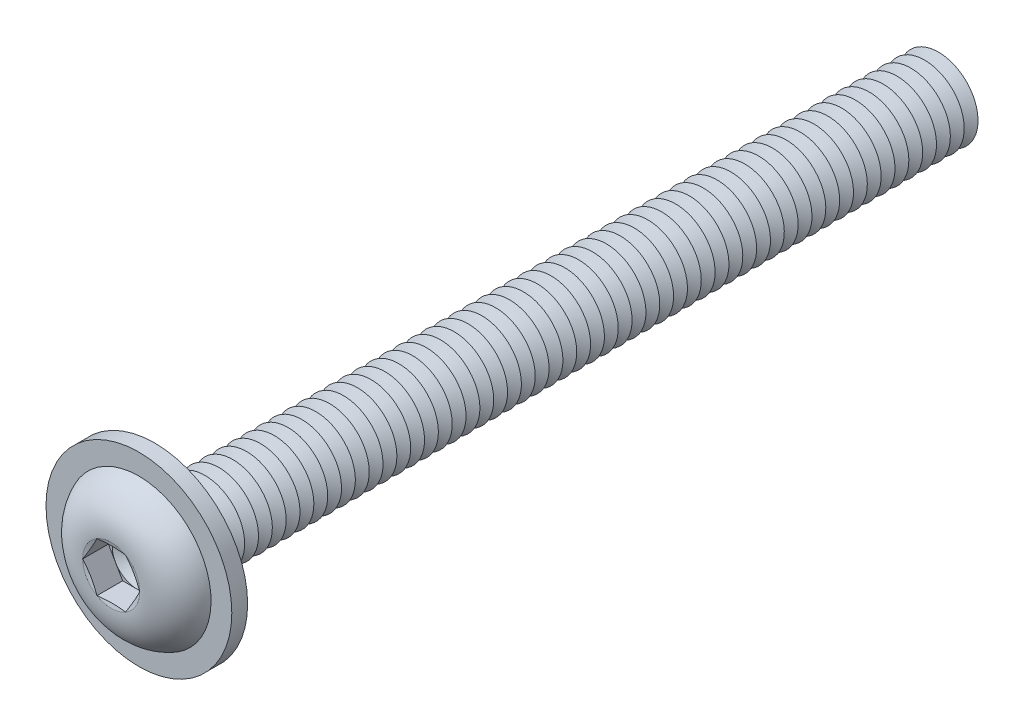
ISO-10303-21;
HEADER;
FILE_DESCRIPTION(('STEP AP214'),'2;1');
FILE_NAME('part.step','',(''),(''),'','','');
FILE_SCHEMA(('AUTOMOTIVE_DESIGN { 1 0 10303 214 1 1 1 1 }'));
ENDSEC;
DATA;
#1=APPLICATION_CONTEXT('core data for automotive mechanical design processes');
#2=APPLICATION_PROTOCOL_DEFINITION('international standard','automotive_design',2000,#1);
#3=PRODUCT_CONTEXT('',#1,'mechanical');
#4=PRODUCT('Part','Part','',(#3));
#5=PRODUCT_RELATED_PRODUCT_CATEGORY('part','',(#4));
#6=PRODUCT_DEFINITION_FORMATION('','',#4);
#7=PRODUCT_DEFINITION_CONTEXT('part definition',#1,'design');
#8=PRODUCT_DEFINITION('design','',#6,#7);
#9=PRODUCT_DEFINITION_SHAPE('','',#8);
#10=(LENGTH_UNIT() NAMED_UNIT(*) SI_UNIT(.MILLI.,.METRE.));
#11=(NAMED_UNIT(*) PLANE_ANGLE_UNIT() SI_UNIT($,.RADIAN.));
#12=(NAMED_UNIT(*) SI_UNIT($,.STERADIAN.) SOLID_ANGLE_UNIT());
#13=UNCERTAINTY_MEASURE_WITH_UNIT(LENGTH_MEASURE(1.E-05),#10,'distance_accuracy_value','');
#14=(GEOMETRIC_REPRESENTATION_CONTEXT(3) GLOBAL_UNCERTAINTY_ASSIGNED_CONTEXT((#13)) GLOBAL_UNIT_ASSIGNED_CONTEXT((#10,
#11,#12)) REPRESENTATION_CONTEXT('',''));
#15=CARTESIAN_POINT('',(0.,0.,0.));
#16=DIRECTION('',(0.,0.,1.));
#17=DIRECTION('',(1.,0.,0.));
#18=AXIS2_PLACEMENT_3D('',#15,#16,#17);
#19=CARTESIAN_POINT('',(0.,0.,-37.55));
#20=DIRECTION('',(0.,0.,1.));
#21=DIRECTION('',(0.,-1.,0.));
#22=AXIS2_PLACEMENT_3D('',#19,#20,#21);
#23=CONICAL_SURFACE('',#22,1.99999999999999,1.04719755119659);
#24=CARTESIAN_POINT('',(0.,0.,-37.9));
#25=DIRECTION('',(0.,0.,1.));
#26=DIRECTION('',(0.,-1.,0.));
#27=AXIS2_PLACEMENT_3D('',#24,#25,#26);
#28=CIRCLE('',#27,1.39378221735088);
#29=CARTESIAN_POINT('',(0.,-1.39378221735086,-37.9));
#30=VERTEX_POINT('',#29);
#31=EDGE_CURVE('E666',#30,#30,#28,.T.);
#32=ORIENTED_EDGE('',*,*,#31,.T.);
#33=EDGE_LOOP('',(#32));
#34=FACE_BOUND('',#33,.T.);
#35=CARTESIAN_POINT('',(0.,0.,-37.55));
#36=DIRECTION('',(0.,0.,1.));
#37=DIRECTION('',(0.,-1.,0.));
#38=AXIS2_PLACEMENT_3D('',#35,#36,#37);
#39=CIRCLE('',#38,1.99999999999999);
#40=CARTESIAN_POINT('',(0.,-1.99999999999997,-37.55));
#41=VERTEX_POINT('',#40);
#42=EDGE_CURVE('E662',#41,#41,#39,.T.);
#43=ORIENTED_EDGE('',*,*,#42,.F.);
#44=EDGE_LOOP('',(#43));
#45=FACE_BOUND('',#44,.T.);
#46=ADVANCED_FACE('F39',(#34,#45),#23,.T.);
#47=CARTESIAN_POINT('',(0.,0.,-37.9));
#48=DIRECTION('',(0.,0.,-1.));
#49=DIRECTION('',(0.,1.,0.));
#50=AXIS2_PLACEMENT_3D('',#47,#48,#49);
#51=CONICAL_SURFACE('',#50,1.39378221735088,1.0471975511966);
#52=CARTESIAN_POINT('',(0.,0.,-38.25));
#53=DIRECTION('',(0.,0.,1.));
#54=DIRECTION('',(0.,-1.,0.));
#55=AXIS2_PLACEMENT_3D('',#52,#53,#54);
#56=CIRCLE('',#55,1.99999999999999);
#57=CARTESIAN_POINT('',(0.,-1.99999999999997,-38.25));
#58=VERTEX_POINT('',#57);
#59=EDGE_CURVE('E670',#58,#58,#56,.T.);
#60=ORIENTED_EDGE('',*,*,#59,.T.);
#61=EDGE_LOOP('',(#60));
#62=FACE_BOUND('',#61,.T.);
#63=ORIENTED_EDGE('',*,*,#31,.F.);
#64=EDGE_LOOP('',(#63));
#65=FACE_BOUND('',#64,.T.);
#66=ADVANCED_FACE('F790',(#62,#65),#51,.T.);
#67=CARTESIAN_POINT('',(0.,2.,-40.));
#68=DIRECTION('',(0.,0.,-1.));
#69=DIRECTION('',(0.,1.,0.));
#70=AXIS2_PLACEMENT_3D('',#67,#68,#69);
#71=PLANE('',#70);
#72=CARTESIAN_POINT('',(0.,0.,-40.));
#73=DIRECTION('',(0.,0.,1.));
#74=DIRECTION('',(0.,-1.,0.));
#75=AXIS2_PLACEMENT_3D('',#72,#73,#74);
#76=CIRCLE('',#75,1.39378221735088);
#77=CARTESIAN_POINT('',(0.,-1.39378221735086,-40.));
#78=VERTEX_POINT('',#77);
#79=EDGE_CURVE('E690',#78,#78,#76,.T.);
#80=ORIENTED_EDGE('',*,*,#79,.F.);
#81=EDGE_LOOP('',(#80));
#82=FACE_BOUND('',#81,.T.);
#83=ADVANCED_FACE('F796',(#82),#71,.T.);
#84=CARTESIAN_POINT('',(0.,0.,-39.65));
#85=DIRECTION('',(0.,0.,1.));
#86=DIRECTION('',(0.,-1.,0.));
#87=AXIS2_PLACEMENT_3D('',#84,#85,#86);
#88=CONICAL_SURFACE('',#87,1.99999999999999,1.04719755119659);
#89=ORIENTED_EDGE('',*,*,#79,.T.);
#90=EDGE_LOOP('',(#89));
#91=FACE_BOUND('',#90,.T.);
#92=CARTESIAN_POINT('',(0.,0.,-39.65));
#93=DIRECTION('',(0.,0.,1.));
#94=DIRECTION('',(0.,-1.,0.));
#95=AXIS2_PLACEMENT_3D('',#92,#93,#94);
#96=CIRCLE('',#95,1.99999999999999);
#97=CARTESIAN_POINT('',(0.,-1.99999999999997,-39.65));
#98=VERTEX_POINT('',#97);
#99=EDGE_CURVE('E686',#98,#98,#96,.T.);
#100=ORIENTED_EDGE('',*,*,#99,.F.);
#101=EDGE_LOOP('',(#100));
#102=FACE_BOUND('',#101,.T.);
#103=ADVANCED_FACE('F815',(#91,#102),#88,.T.);
#104=CARTESIAN_POINT('',(0.,0.,-39.3));
#105=DIRECTION('',(0.,0.,-1.));
#106=DIRECTION('',(0.,1.,0.));
#107=AXIS2_PLACEMENT_3D('',#104,#105,#106);
#108=CONICAL_SURFACE('',#107,1.39378221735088,1.0471975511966);
#109=ORIENTED_EDGE('',*,*,#99,.T.);
#110=EDGE_LOOP('',(#109));
#111=FACE_BOUND('',#110,.T.);
#112=CARTESIAN_POINT('',(0.,0.,-39.3));
#113=DIRECTION('',(0.,0.,1.));
#114=DIRECTION('',(0.,-1.,0.));
#115=AXIS2_PLACEMENT_3D('',#112,#113,#114);
#116=CIRCLE('',#115,1.39378221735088);
#117=CARTESIAN_POINT('',(0.,-1.39378221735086,-39.3));
#118=VERTEX_POINT('',#117);
#119=EDGE_CURVE('E682',#118,#118,#116,.T.);
#120=ORIENTED_EDGE('',*,*,#119,.F.);
#121=EDGE_LOOP('',(#120));
#122=FACE_BOUND('',#121,.T.);
#123=ADVANCED_FACE('F812',(#111,#122),#108,.T.);
#124=CARTESIAN_POINT('',(0.,0.,-38.95));
#125=DIRECTION('',(0.,0.,1.));
#126=DIRECTION('',(0.,-1.,0.));
#127=AXIS2_PLACEMENT_3D('',#124,#125,#126);
#128=CONICAL_SURFACE('',#127,1.99999999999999,1.04719755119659);
#129=ORIENTED_EDGE('',*,*,#119,.T.);
#130=EDGE_LOOP('',(#129));
#131=FACE_BOUND('',#130,.T.);
#132=CARTESIAN_POINT('',(0.,0.,-38.95));
#133=DIRECTION('',(0.,0.,1.));
#134=DIRECTION('',(0.,-1.,0.));
#135=AXIS2_PLACEMENT_3D('',#132,#133,#134);
#136=CIRCLE('',#135,1.99999999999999);
#137=CARTESIAN_POINT('',(0.,-1.99999999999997,-38.95));
#138=VERTEX_POINT('',#137);
#139=EDGE_CURVE('E678',#138,#138,#136,.T.);
#140=ORIENTED_EDGE('',*,*,#139,.F.);
#141=EDGE_LOOP('',(#140));
#142=FACE_BOUND('',#141,.T.);
#143=ADVANCED_FACE('F806',(#131,#142),#128,.T.);
#144=CARTESIAN_POINT('',(0.,0.,-38.6));
#145=DIRECTION('',(0.,0.,-1.));
#146=DIRECTION('',(0.,1.,0.));
#147=AXIS2_PLACEMENT_3D('',#144,#145,#146);
#148=CONICAL_SURFACE('',#147,1.39378221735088,1.0471975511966);
#149=ORIENTED_EDGE('',*,*,#139,.T.);
#150=EDGE_LOOP('',(#149));
#151=FACE_BOUND('',#150,.T.);
#152=CARTESIAN_POINT('',(0.,0.,-38.6));
#153=DIRECTION('',(0.,0.,1.));
#154=DIRECTION('',(0.,-1.,0.));
#155=AXIS2_PLACEMENT_3D('',#152,#153,#154);
#156=CIRCLE('',#155,1.39378221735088);
#157=CARTESIAN_POINT('',(0.,-1.39378221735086,-38.6));
#158=VERTEX_POINT('',#157);
#159=EDGE_CURVE('E674',#158,#158,#156,.T.);
#160=ORIENTED_EDGE('',*,*,#159,.F.);
#161=EDGE_LOOP('',(#160));
#162=FACE_BOUND('',#161,.T.);
#163=ADVANCED_FACE('F802',(#151,#162),#148,.T.);
#164=CARTESIAN_POINT('',(0.,0.,-38.25));
#165=DIRECTION('',(0.,0.,1.));
#166=DIRECTION('',(0.,-1.,0.));
#167=AXIS2_PLACEMENT_3D('',#164,#165,#166);
#168=CONICAL_SURFACE('',#167,1.99999999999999,1.04719755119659);
#169=ORIENTED_EDGE('',*,*,#159,.T.);
#170=EDGE_LOOP('',(#169));
#171=FACE_BOUND('',#170,.T.);
#172=ORIENTED_EDGE('',*,*,#59,.F.);
#173=EDGE_LOOP('',(#172));
#174=FACE_BOUND('',#173,.T.);
#175=ADVANCED_FACE('F805',(#171,#174),#168,.T.);
#176=CARTESIAN_POINT('',(0.,0.,-36.85));
#177=DIRECTION('',(0.,0.,1.));
#178=DIRECTION('',(0.,-1.,0.));
#179=AXIS2_PLACEMENT_3D('',#176,#177,#178);
#180=CONICAL_SURFACE('',#179,1.99999999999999,1.04719755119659);
#181=CARTESIAN_POINT('',(0.,0.,-37.2));
#182=DIRECTION('',(0.,0.,1.));
#183=DIRECTION('',(0.,-1.,0.));
#184=AXIS2_PLACEMENT_3D('',#181,#182,#183);
#185=CIRCLE('',#184,1.39378221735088);
#186=CARTESIAN_POINT('',(0.,-1.39378221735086,-37.2));
#187=VERTEX_POINT('',#186);
#188=EDGE_CURVE('E658',#187,#187,#185,.T.);
#189=ORIENTED_EDGE('',*,*,#188,.T.);
#190=EDGE_LOOP('',(#189));
#191=FACE_BOUND('',#190,.T.);
#192=CARTESIAN_POINT('',(0.,0.,-36.85));
#193=DIRECTION('',(0.,0.,1.));
#194=DIRECTION('',(0.,-1.,0.));
#195=AXIS2_PLACEMENT_3D('',#192,#193,#194);
#196=CIRCLE('',#195,1.99999999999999);
#197=CARTESIAN_POINT('',(0.,-1.99999999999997,-36.85));
#198=VERTEX_POINT('',#197);
#199=EDGE_CURVE('E654',#198,#198,#196,.T.);
#200=ORIENTED_EDGE('',*,*,#199,.F.);
#201=EDGE_LOOP('',(#200));
#202=FACE_BOUND('',#201,.T.);
#203=ADVANCED_FACE('F810',(#191,#202),#180,.T.);
#204=CARTESIAN_POINT('',(0.,0.,-37.2));
#205=DIRECTION('',(0.,0.,-1.));
#206=DIRECTION('',(0.,1.,0.));
#207=AXIS2_PLACEMENT_3D('',#204,#205,#206);
#208=CONICAL_SURFACE('',#207,1.39378221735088,1.0471975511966);
#209=ORIENTED_EDGE('',*,*,#42,.T.);
#210=EDGE_LOOP('',(#209));
#211=FACE_BOUND('',#210,.T.);
#212=ORIENTED_EDGE('',*,*,#188,.F.);
#213=EDGE_LOOP('',(#212));
#214=FACE_BOUND('',#213,.T.);
#215=ADVANCED_FACE('F861',(#211,#214),#208,.T.);
#216=CARTESIAN_POINT('',(0.,0.,-36.15));
#217=DIRECTION('',(0.,0.,1.));
#218=DIRECTION('',(0.,-1.,0.));
#219=AXIS2_PLACEMENT_3D('',#216,#217,#218);
#220=CONICAL_SURFACE('',#219,1.99999999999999,1.04719755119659);
#221=CARTESIAN_POINT('',(0.,0.,-36.5));
#222=DIRECTION('',(0.,0.,1.));
#223=DIRECTION('',(0.,-1.,0.));
#224=AXIS2_PLACEMENT_3D('',#221,#222,#223);
#225=CIRCLE('',#224,1.39378221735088);
#226=CARTESIAN_POINT('',(0.,-1.39378221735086,-36.5));
#227=VERTEX_POINT('',#226);
#228=EDGE_CURVE('E650',#227,#227,#225,.T.);
#229=ORIENTED_EDGE('',*,*,#228,.T.);
#230=EDGE_LOOP('',(#229));
#231=FACE_BOUND('',#230,.T.);
#232=CARTESIAN_POINT('',(0.,0.,-36.15));
#233=DIRECTION('',(0.,0.,1.));
#234=DIRECTION('',(0.,-1.,0.));
#235=AXIS2_PLACEMENT_3D('',#232,#233,#234);
#236=CIRCLE('',#235,1.99999999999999);
#237=CARTESIAN_POINT('',(0.,-1.99999999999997,-36.15));
#238=VERTEX_POINT('',#237);
#239=EDGE_CURVE('E646',#238,#238,#236,.T.);
#240=ORIENTED_EDGE('',*,*,#239,.F.);
#241=EDGE_LOOP('',(#240));
#242=FACE_BOUND('',#241,.T.);
#243=ADVANCED_FACE('F867',(#231,#242),#220,.T.);
#244=CARTESIAN_POINT('',(0.,0.,-36.5));
#245=DIRECTION('',(0.,0.,-1.));
#246=DIRECTION('',(0.,1.,0.));
#247=AXIS2_PLACEMENT_3D('',#244,#245,#246);
#248=CONICAL_SURFACE('',#247,1.39378221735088,1.0471975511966);
#249=ORIENTED_EDGE('',*,*,#199,.T.);
#250=EDGE_LOOP('',(#249));
#251=FACE_BOUND('',#250,.T.);
#252=ORIENTED_EDGE('',*,*,#228,.F.);
#253=EDGE_LOOP('',(#252));
#254=FACE_BOUND('',#253,.T.);
#255=ADVANCED_FACE('F874',(#251,#254),#248,.T.);
#256=CARTESIAN_POINT('',(0.,0.,-35.45));
#257=DIRECTION('',(0.,0.,1.));
#258=DIRECTION('',(0.,-1.,0.));
#259=AXIS2_PLACEMENT_3D('',#256,#257,#258);
#260=CONICAL_SURFACE('',#259,1.99999999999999,1.04719755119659);
#261=CARTESIAN_POINT('',(0.,0.,-35.8));
#262=DIRECTION('',(0.,0.,1.));
#263=DIRECTION('',(0.,-1.,0.));
#264=AXIS2_PLACEMENT_3D('',#261,#262,#263);
#265=CIRCLE('',#264,1.39378221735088);
#266=CARTESIAN_POINT('',(0.,-1.39378221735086,-35.8));
#267=VERTEX_POINT('',#266);
#268=EDGE_CURVE('E642',#267,#267,#265,.T.);
#269=ORIENTED_EDGE('',*,*,#268,.T.);
#270=EDGE_LOOP('',(#269));
#271=FACE_BOUND('',#270,.T.);
#272=CARTESIAN_POINT('',(0.,0.,-35.45));
#273=DIRECTION('',(0.,0.,1.));
#274=DIRECTION('',(0.,-1.,0.));
#275=AXIS2_PLACEMENT_3D('',#272,#273,#274);
#276=CIRCLE('',#275,1.99999999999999);
#277=CARTESIAN_POINT('',(0.,-1.99999999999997,-35.45));
#278=VERTEX_POINT('',#277);
#279=EDGE_CURVE('E638',#278,#278,#276,.T.);
#280=ORIENTED_EDGE('',*,*,#279,.F.);
#281=EDGE_LOOP('',(#280));
#282=FACE_BOUND('',#281,.T.);
#283=ADVANCED_FACE('F881',(#271,#282),#260,.T.);
#284=CARTESIAN_POINT('',(0.,0.,-35.8));
#285=DIRECTION('',(0.,0.,-1.));
#286=DIRECTION('',(0.,1.,0.));
#287=AXIS2_PLACEMENT_3D('',#284,#285,#286);
#288=CONICAL_SURFACE('',#287,1.39378221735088,1.0471975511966);
#289=ORIENTED_EDGE('',*,*,#239,.T.);
#290=EDGE_LOOP('',(#289));
#291=FACE_BOUND('',#290,.T.);
#292=ORIENTED_EDGE('',*,*,#268,.F.);
#293=EDGE_LOOP('',(#292));
#294=FACE_BOUND('',#293,.T.);
#295=ADVANCED_FACE('F888',(#291,#294),#288,.T.);
#296=CARTESIAN_POINT('',(0.,0.,-34.75));
#297=DIRECTION('',(0.,0.,1.));
#298=DIRECTION('',(0.,-1.,0.));
#299=AXIS2_PLACEMENT_3D('',#296,#297,#298);
#300=CONICAL_SURFACE('',#299,1.99999999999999,1.04719755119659);
#301=CARTESIAN_POINT('',(0.,0.,-35.1));
#302=DIRECTION('',(0.,0.,1.));
#303=DIRECTION('',(0.,-1.,0.));
#304=AXIS2_PLACEMENT_3D('',#301,#302,#303);
#305=CIRCLE('',#304,1.39378221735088);
#306=CARTESIAN_POINT('',(0.,-1.39378221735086,-35.1));
#307=VERTEX_POINT('',#306);
#308=EDGE_CURVE('E634',#307,#307,#305,.T.);
#309=ORIENTED_EDGE('',*,*,#308,.T.);
#310=EDGE_LOOP('',(#309));
#311=FACE_BOUND('',#310,.T.);
#312=CARTESIAN_POINT('',(0.,0.,-34.75));
#313=DIRECTION('',(0.,0.,1.));
#314=DIRECTION('',(0.,-1.,0.));
#315=AXIS2_PLACEMENT_3D('',#312,#313,#314);
#316=CIRCLE('',#315,1.99999999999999);
#317=CARTESIAN_POINT('',(0.,-1.99999999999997,-34.75));
#318=VERTEX_POINT('',#317);
#319=EDGE_CURVE('E630',#318,#318,#316,.T.);
#320=ORIENTED_EDGE('',*,*,#319,.F.);
#321=EDGE_LOOP('',(#320));
#322=FACE_BOUND('',#321,.T.);
#323=ADVANCED_FACE('F895',(#311,#322),#300,.T.);
#324=CARTESIAN_POINT('',(0.,0.,-35.1));
#325=DIRECTION('',(0.,0.,-1.));
#326=DIRECTION('',(0.,1.,0.));
#327=AXIS2_PLACEMENT_3D('',#324,#325,#326);
#328=CONICAL_SURFACE('',#327,1.39378221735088,1.0471975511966);
#329=ORIENTED_EDGE('',*,*,#279,.T.);
#330=EDGE_LOOP('',(#329));
#331=FACE_BOUND('',#330,.T.);
#332=ORIENTED_EDGE('',*,*,#308,.F.);
#333=EDGE_LOOP('',(#332));
#334=FACE_BOUND('',#333,.T.);
#335=ADVANCED_FACE('F902',(#331,#334),#328,.T.);
#336=CARTESIAN_POINT('',(0.,0.,-34.05));
#337=DIRECTION('',(0.,0.,1.));
#338=DIRECTION('',(0.,-1.,0.));
#339=AXIS2_PLACEMENT_3D('',#336,#337,#338);
#340=CONICAL_SURFACE('',#339,1.99999999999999,1.04719755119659);
#341=CARTESIAN_POINT('',(0.,0.,-34.4));
#342=DIRECTION('',(0.,0.,1.));
#343=DIRECTION('',(0.,-1.,0.));
#344=AXIS2_PLACEMENT_3D('',#341,#342,#343);
#345=CIRCLE('',#344,1.39378221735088);
#346=CARTESIAN_POINT('',(0.,-1.39378221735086,-34.4));
#347=VERTEX_POINT('',#346);
#348=EDGE_CURVE('E626',#347,#347,#345,.T.);
#349=ORIENTED_EDGE('',*,*,#348,.T.);
#350=EDGE_LOOP('',(#349));
#351=FACE_BOUND('',#350,.T.);
#352=CARTESIAN_POINT('',(0.,0.,-34.05));
#353=DIRECTION('',(0.,0.,1.));
#354=DIRECTION('',(0.,-1.,0.));
#355=AXIS2_PLACEMENT_3D('',#352,#353,#354);
#356=CIRCLE('',#355,1.99999999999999);
#357=CARTESIAN_POINT('',(0.,-1.99999999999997,-34.05));
#358=VERTEX_POINT('',#357);
#359=EDGE_CURVE('E622',#358,#358,#356,.T.);
#360=ORIENTED_EDGE('',*,*,#359,.F.);
#361=EDGE_LOOP('',(#360));
#362=FACE_BOUND('',#361,.T.);
#363=ADVANCED_FACE('F909',(#351,#362),#340,.T.);
#364=CARTESIAN_POINT('',(0.,0.,-34.4));
#365=DIRECTION('',(0.,0.,-1.));
#366=DIRECTION('',(0.,1.,0.));
#367=AXIS2_PLACEMENT_3D('',#364,#365,#366);
#368=CONICAL_SURFACE('',#367,1.39378221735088,1.0471975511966);
#369=ORIENTED_EDGE('',*,*,#319,.T.);
#370=EDGE_LOOP('',(#369));
#371=FACE_BOUND('',#370,.T.);
#372=ORIENTED_EDGE('',*,*,#348,.F.);
#373=EDGE_LOOP('',(#372));
#374=FACE_BOUND('',#373,.T.);
#375=ADVANCED_FACE('F916',(#371,#374),#368,.T.);
#376=CARTESIAN_POINT('',(0.,0.,-33.35));
#377=DIRECTION('',(0.,0.,1.));
#378=DIRECTION('',(0.,-1.,0.));
#379=AXIS2_PLACEMENT_3D('',#376,#377,#378);
#380=CONICAL_SURFACE('',#379,1.99999999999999,1.04719755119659);
#381=CARTESIAN_POINT('',(0.,0.,-33.7));
#382=DIRECTION('',(0.,0.,1.));
#383=DIRECTION('',(0.,-1.,0.));
#384=AXIS2_PLACEMENT_3D('',#381,#382,#383);
#385=CIRCLE('',#384,1.39378221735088);
#386=CARTESIAN_POINT('',(0.,-1.39378221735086,-33.7));
#387=VERTEX_POINT('',#386);
#388=EDGE_CURVE('E618',#387,#387,#385,.T.);
#389=ORIENTED_EDGE('',*,*,#388,.T.);
#390=EDGE_LOOP('',(#389));
#391=FACE_BOUND('',#390,.T.);
#392=CARTESIAN_POINT('',(0.,0.,-33.35));
#393=DIRECTION('',(0.,0.,1.));
#394=DIRECTION('',(0.,-1.,0.));
#395=AXIS2_PLACEMENT_3D('',#392,#393,#394);
#396=CIRCLE('',#395,1.99999999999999);
#397=CARTESIAN_POINT('',(0.,-1.99999999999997,-33.35));
#398=VERTEX_POINT('',#397);
#399=EDGE_CURVE('E614',#398,#398,#396,.T.);
#400=ORIENTED_EDGE('',*,*,#399,.F.);
#401=EDGE_LOOP('',(#400));
#402=FACE_BOUND('',#401,.T.);
#403=ADVANCED_FACE('F923',(#391,#402),#380,.T.);
#404=CARTESIAN_POINT('',(0.,0.,-33.7));
#405=DIRECTION('',(0.,0.,-1.));
#406=DIRECTION('',(0.,1.,0.));
#407=AXIS2_PLACEMENT_3D('',#404,#405,#406);
#408=CONICAL_SURFACE('',#407,1.39378221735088,1.0471975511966);
#409=ORIENTED_EDGE('',*,*,#359,.T.);
#410=EDGE_LOOP('',(#409));
#411=FACE_BOUND('',#410,.T.);
#412=ORIENTED_EDGE('',*,*,#388,.F.);
#413=EDGE_LOOP('',(#412));
#414=FACE_BOUND('',#413,.T.);
#415=ADVANCED_FACE('F930',(#411,#414),#408,.T.);
#416=CARTESIAN_POINT('',(0.,0.,-32.65));
#417=DIRECTION('',(0.,0.,1.));
#418=DIRECTION('',(0.,-1.,0.));
#419=AXIS2_PLACEMENT_3D('',#416,#417,#418);
#420=CONICAL_SURFACE('',#419,1.99999999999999,1.04719755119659);
#421=CARTESIAN_POINT('',(0.,0.,-33.));
#422=DIRECTION('',(0.,0.,1.));
#423=DIRECTION('',(0.,-1.,0.));
#424=AXIS2_PLACEMENT_3D('',#421,#422,#423);
#425=CIRCLE('',#424,1.39378221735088);
#426=CARTESIAN_POINT('',(0.,-1.39378221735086,-33.));
#427=VERTEX_POINT('',#426);
#428=EDGE_CURVE('E610',#427,#427,#425,.T.);
#429=ORIENTED_EDGE('',*,*,#428,.T.);
#430=EDGE_LOOP('',(#429));
#431=FACE_BOUND('',#430,.T.);
#432=CARTESIAN_POINT('',(0.,0.,-32.65));
#433=DIRECTION('',(0.,0.,1.));
#434=DIRECTION('',(0.,-1.,0.));
#435=AXIS2_PLACEMENT_3D('',#432,#433,#434);
#436=CIRCLE('',#435,1.99999999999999);
#437=CARTESIAN_POINT('',(0.,-1.99999999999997,-32.65));
#438=VERTEX_POINT('',#437);
#439=EDGE_CURVE('E606',#438,#438,#436,.T.);
#440=ORIENTED_EDGE('',*,*,#439,.F.);
#441=EDGE_LOOP('',(#440));
#442=FACE_BOUND('',#441,.T.);
#443=ADVANCED_FACE('F937',(#431,#442),#420,.T.);
#444=CARTESIAN_POINT('',(0.,0.,-33.));
#445=DIRECTION('',(0.,0.,-1.));
#446=DIRECTION('',(0.,1.,0.));
#447=AXIS2_PLACEMENT_3D('',#444,#445,#446);
#448=CONICAL_SURFACE('',#447,1.39378221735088,1.0471975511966);
#449=ORIENTED_EDGE('',*,*,#399,.T.);
#450=EDGE_LOOP('',(#449));
#451=FACE_BOUND('',#450,.T.);
#452=ORIENTED_EDGE('',*,*,#428,.F.);
#453=EDGE_LOOP('',(#452));
#454=FACE_BOUND('',#453,.T.);
#455=ADVANCED_FACE('F944',(#451,#454),#448,.T.);
#456=CARTESIAN_POINT('',(0.,0.,-31.95));
#457=DIRECTION('',(0.,0.,1.));
#458=DIRECTION('',(0.,-1.,0.));
#459=AXIS2_PLACEMENT_3D('',#456,#457,#458);
#460=CONICAL_SURFACE('',#459,1.99999999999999,1.04719755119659);
#461=CARTESIAN_POINT('',(0.,0.,-32.3));
#462=DIRECTION('',(0.,0.,1.));
#463=DIRECTION('',(0.,-1.,0.));
#464=AXIS2_PLACEMENT_3D('',#461,#462,#463);
#465=CIRCLE('',#464,1.39378221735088);
#466=CARTESIAN_POINT('',(0.,-1.39378221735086,-32.3));
#467=VERTEX_POINT('',#466);
#468=EDGE_CURVE('E602',#467,#467,#465,.T.);
#469=ORIENTED_EDGE('',*,*,#468,.T.);
#470=EDGE_LOOP('',(#469));
#471=FACE_BOUND('',#470,.T.);
#472=CARTESIAN_POINT('',(0.,0.,-31.95));
#473=DIRECTION('',(0.,0.,1.));
#474=DIRECTION('',(0.,-1.,0.));
#475=AXIS2_PLACEMENT_3D('',#472,#473,#474);
#476=CIRCLE('',#475,1.99999999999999);
#477=CARTESIAN_POINT('',(0.,-1.99999999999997,-31.95));
#478=VERTEX_POINT('',#477);
#479=EDGE_CURVE('E598',#478,#478,#476,.T.);
#480=ORIENTED_EDGE('',*,*,#479,.F.);
#481=EDGE_LOOP('',(#480));
#482=FACE_BOUND('',#481,.T.);
#483=ADVANCED_FACE('F951',(#471,#482),#460,.T.);
#484=CARTESIAN_POINT('',(0.,0.,-32.3));
#485=DIRECTION('',(0.,0.,-1.));
#486=DIRECTION('',(0.,1.,0.));
#487=AXIS2_PLACEMENT_3D('',#484,#485,#486);
#488=CONICAL_SURFACE('',#487,1.39378221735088,1.0471975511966);
#489=ORIENTED_EDGE('',*,*,#439,.T.);
#490=EDGE_LOOP('',(#489));
#491=FACE_BOUND('',#490,.T.);
#492=ORIENTED_EDGE('',*,*,#468,.F.);
#493=EDGE_LOOP('',(#492));
#494=FACE_BOUND('',#493,.T.);
#495=ADVANCED_FACE('F958',(#491,#494),#488,.T.);
#496=CARTESIAN_POINT('',(0.,0.,-31.25));
#497=DIRECTION('',(0.,0.,1.));
#498=DIRECTION('',(0.,-1.,0.));
#499=AXIS2_PLACEMENT_3D('',#496,#497,#498);
#500=CONICAL_SURFACE('',#499,1.99999999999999,1.04719755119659);
#501=CARTESIAN_POINT('',(0.,0.,-31.6));
#502=DIRECTION('',(0.,0.,1.));
#503=DIRECTION('',(0.,-1.,0.));
#504=AXIS2_PLACEMENT_3D('',#501,#502,#503);
#505=CIRCLE('',#504,1.39378221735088);
#506=CARTESIAN_POINT('',(0.,-1.39378221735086,-31.6));
#507=VERTEX_POINT('',#506);
#508=EDGE_CURVE('E594',#507,#507,#505,.T.);
#509=ORIENTED_EDGE('',*,*,#508,.T.);
#510=EDGE_LOOP('',(#509));
#511=FACE_BOUND('',#510,.T.);
#512=CARTESIAN_POINT('',(0.,0.,-31.25));
#513=DIRECTION('',(0.,0.,1.));
#514=DIRECTION('',(0.,-1.,0.));
#515=AXIS2_PLACEMENT_3D('',#512,#513,#514);
#516=CIRCLE('',#515,1.99999999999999);
#517=CARTESIAN_POINT('',(0.,-1.99999999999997,-31.25));
#518=VERTEX_POINT('',#517);
#519=EDGE_CURVE('E590',#518,#518,#516,.T.);
#520=ORIENTED_EDGE('',*,*,#519,.F.);
#521=EDGE_LOOP('',(#520));
#522=FACE_BOUND('',#521,.T.);
#523=ADVANCED_FACE('F965',(#511,#522),#500,.T.);
#524=CARTESIAN_POINT('',(0.,0.,-31.6));
#525=DIRECTION('',(0.,0.,-1.));
#526=DIRECTION('',(0.,1.,0.));
#527=AXIS2_PLACEMENT_3D('',#524,#525,#526);
#528=CONICAL_SURFACE('',#527,1.39378221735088,1.0471975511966);
#529=ORIENTED_EDGE('',*,*,#479,.T.);
#530=EDGE_LOOP('',(#529));
#531=FACE_BOUND('',#530,.T.);
#532=ORIENTED_EDGE('',*,*,#508,.F.);
#533=EDGE_LOOP('',(#532));
#534=FACE_BOUND('',#533,.T.);
#535=ADVANCED_FACE('F972',(#531,#534),#528,.T.);
#536=CARTESIAN_POINT('',(0.,0.,-30.55));
#537=DIRECTION('',(0.,0.,1.));
#538=DIRECTION('',(0.,-1.,0.));
#539=AXIS2_PLACEMENT_3D('',#536,#537,#538);
#540=CONICAL_SURFACE('',#539,1.99999999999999,1.04719755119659);
#541=CARTESIAN_POINT('',(0.,0.,-30.9));
#542=DIRECTION('',(0.,0.,1.));
#543=DIRECTION('',(0.,-1.,0.));
#544=AXIS2_PLACEMENT_3D('',#541,#542,#543);
#545=CIRCLE('',#544,1.39378221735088);
#546=CARTESIAN_POINT('',(0.,-1.39378221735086,-30.9));
#547=VERTEX_POINT('',#546);
#548=EDGE_CURVE('E586',#547,#547,#545,.T.);
#549=ORIENTED_EDGE('',*,*,#548,.T.);
#550=EDGE_LOOP('',(#549));
#551=FACE_BOUND('',#550,.T.);
#552=CARTESIAN_POINT('',(0.,0.,-30.55));
#553=DIRECTION('',(0.,0.,1.));
#554=DIRECTION('',(0.,-1.,0.));
#555=AXIS2_PLACEMENT_3D('',#552,#553,#554);
#556=CIRCLE('',#555,1.99999999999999);
#557=CARTESIAN_POINT('',(0.,-1.99999999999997,-30.55));
#558=VERTEX_POINT('',#557);
#559=EDGE_CURVE('E582',#558,#558,#556,.T.);
#560=ORIENTED_EDGE('',*,*,#559,.F.);
#561=EDGE_LOOP('',(#560));
#562=FACE_BOUND('',#561,.T.);
#563=ADVANCED_FACE('F979',(#551,#562),#540,.T.);
#564=CARTESIAN_POINT('',(0.,0.,-30.9));
#565=DIRECTION('',(0.,0.,-1.));
#566=DIRECTION('',(0.,1.,0.));
#567=AXIS2_PLACEMENT_3D('',#564,#565,#566);
#568=CONICAL_SURFACE('',#567,1.39378221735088,1.0471975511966);
#569=ORIENTED_EDGE('',*,*,#519,.T.);
#570=EDGE_LOOP('',(#569));
#571=FACE_BOUND('',#570,.T.);
#572=ORIENTED_EDGE('',*,*,#548,.F.);
#573=EDGE_LOOP('',(#572));
#574=FACE_BOUND('',#573,.T.);
#575=ADVANCED_FACE('F986',(#571,#574),#568,.T.);
#576=CARTESIAN_POINT('',(0.,0.,-29.85));
#577=DIRECTION('',(0.,0.,1.));
#578=DIRECTION('',(0.,-1.,0.));
#579=AXIS2_PLACEMENT_3D('',#576,#577,#578);
#580=CONICAL_SURFACE('',#579,1.99999999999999,1.04719755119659);
#581=CARTESIAN_POINT('',(0.,0.,-30.2));
#582=DIRECTION('',(0.,0.,1.));
#583=DIRECTION('',(0.,-1.,0.));
#584=AXIS2_PLACEMENT_3D('',#581,#582,#583);
#585=CIRCLE('',#584,1.39378221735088);
#586=CARTESIAN_POINT('',(0.,-1.39378221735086,-30.2));
#587=VERTEX_POINT('',#586);
#588=EDGE_CURVE('E578',#587,#587,#585,.T.);
#589=ORIENTED_EDGE('',*,*,#588,.T.);
#590=EDGE_LOOP('',(#589));
#591=FACE_BOUND('',#590,.T.);
#592=CARTESIAN_POINT('',(0.,0.,-29.85));
#593=DIRECTION('',(0.,0.,1.));
#594=DIRECTION('',(0.,-1.,0.));
#595=AXIS2_PLACEMENT_3D('',#592,#593,#594);
#596=CIRCLE('',#595,1.99999999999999);
#597=CARTESIAN_POINT('',(0.,-1.99999999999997,-29.85));
#598=VERTEX_POINT('',#597);
#599=EDGE_CURVE('E574',#598,#598,#596,.T.);
#600=ORIENTED_EDGE('',*,*,#599,.F.);
#601=EDGE_LOOP('',(#600));
#602=FACE_BOUND('',#601,.T.);
#603=ADVANCED_FACE('F993',(#591,#602),#580,.T.);
#604=CARTESIAN_POINT('',(0.,0.,-30.2));
#605=DIRECTION('',(0.,0.,-1.));
#606=DIRECTION('',(0.,1.,0.));
#607=AXIS2_PLACEMENT_3D('',#604,#605,#606);
#608=CONICAL_SURFACE('',#607,1.39378221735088,1.0471975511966);
#609=ORIENTED_EDGE('',*,*,#559,.T.);
#610=EDGE_LOOP('',(#609));
#611=FACE_BOUND('',#610,.T.);
#612=ORIENTED_EDGE('',*,*,#588,.F.);
#613=EDGE_LOOP('',(#612));
#614=FACE_BOUND('',#613,.T.);
#615=ADVANCED_FACE('F1000',(#611,#614),#608,.T.);
#616=CARTESIAN_POINT('',(0.,0.,-29.15));
#617=DIRECTION('',(0.,0.,1.));
#618=DIRECTION('',(0.,-1.,0.));
#619=AXIS2_PLACEMENT_3D('',#616,#617,#618);
#620=CONICAL_SURFACE('',#619,1.99999999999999,1.04719755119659);
#621=CARTESIAN_POINT('',(0.,0.,-29.5));
#622=DIRECTION('',(0.,0.,1.));
#623=DIRECTION('',(0.,-1.,0.));
#624=AXIS2_PLACEMENT_3D('',#621,#622,#623);
#625=CIRCLE('',#624,1.39378221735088);
#626=CARTESIAN_POINT('',(0.,-1.39378221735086,-29.5));
#627=VERTEX_POINT('',#626);
#628=EDGE_CURVE('E570',#627,#627,#625,.T.);
#629=ORIENTED_EDGE('',*,*,#628,.T.);
#630=EDGE_LOOP('',(#629));
#631=FACE_BOUND('',#630,.T.);
#632=CARTESIAN_POINT('',(0.,0.,-29.15));
#633=DIRECTION('',(0.,0.,1.));
#634=DIRECTION('',(0.,-1.,0.));
#635=AXIS2_PLACEMENT_3D('',#632,#633,#634);
#636=CIRCLE('',#635,1.99999999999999);
#637=CARTESIAN_POINT('',(0.,-1.99999999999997,-29.15));
#638=VERTEX_POINT('',#637);
#639=EDGE_CURVE('E566',#638,#638,#636,.T.);
#640=ORIENTED_EDGE('',*,*,#639,.F.);
#641=EDGE_LOOP('',(#640));
#642=FACE_BOUND('',#641,.T.);
#643=ADVANCED_FACE('F1007',(#631,#642),#620,.T.);
#644=CARTESIAN_POINT('',(0.,0.,-29.5));
#645=DIRECTION('',(0.,0.,-1.));
#646=DIRECTION('',(0.,1.,0.));
#647=AXIS2_PLACEMENT_3D('',#644,#645,#646);
#648=CONICAL_SURFACE('',#647,1.39378221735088,1.0471975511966);
#649=ORIENTED_EDGE('',*,*,#599,.T.);
#650=EDGE_LOOP('',(#649));
#651=FACE_BOUND('',#650,.T.);
#652=ORIENTED_EDGE('',*,*,#628,.F.);
#653=EDGE_LOOP('',(#652));
#654=FACE_BOUND('',#653,.T.);
#655=ADVANCED_FACE('F1014',(#651,#654),#648,.T.);
#656=CARTESIAN_POINT('',(0.,0.,-28.45));
#657=DIRECTION('',(0.,0.,1.));
#658=DIRECTION('',(0.,-1.,0.));
#659=AXIS2_PLACEMENT_3D('',#656,#657,#658);
#660=CONICAL_SURFACE('',#659,1.99999999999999,1.04719755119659);
#661=CARTESIAN_POINT('',(0.,0.,-28.8));
#662=DIRECTION('',(0.,0.,1.));
#663=DIRECTION('',(0.,-1.,0.));
#664=AXIS2_PLACEMENT_3D('',#661,#662,#663);
#665=CIRCLE('',#664,1.39378221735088);
#666=CARTESIAN_POINT('',(0.,-1.39378221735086,-28.8));
#667=VERTEX_POINT('',#666);
#668=EDGE_CURVE('E562',#667,#667,#665,.T.);
#669=ORIENTED_EDGE('',*,*,#668,.T.);
#670=EDGE_LOOP('',(#669));
#671=FACE_BOUND('',#670,.T.);
#672=CARTESIAN_POINT('',(0.,0.,-28.45));
#673=DIRECTION('',(0.,0.,1.));
#674=DIRECTION('',(0.,-1.,0.));
#675=AXIS2_PLACEMENT_3D('',#672,#673,#674);
#676=CIRCLE('',#675,1.99999999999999);
#677=CARTESIAN_POINT('',(0.,-1.99999999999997,-28.45));
#678=VERTEX_POINT('',#677);
#679=EDGE_CURVE('E558',#678,#678,#676,.T.);
#680=ORIENTED_EDGE('',*,*,#679,.F.);
#681=EDGE_LOOP('',(#680));
#682=FACE_BOUND('',#681,.T.);
#683=ADVANCED_FACE('F1021',(#671,#682),#660,.T.);
#684=CARTESIAN_POINT('',(0.,0.,-28.8));
#685=DIRECTION('',(0.,0.,-1.));
#686=DIRECTION('',(0.,1.,0.));
#687=AXIS2_PLACEMENT_3D('',#684,#685,#686);
#688=CONICAL_SURFACE('',#687,1.39378221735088,1.0471975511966);
#689=ORIENTED_EDGE('',*,*,#639,.T.);
#690=EDGE_LOOP('',(#689));
#691=FACE_BOUND('',#690,.T.);
#692=ORIENTED_EDGE('',*,*,#668,.F.);
#693=EDGE_LOOP('',(#692));
#694=FACE_BOUND('',#693,.T.);
#695=ADVANCED_FACE('F1028',(#691,#694),#688,.T.);
#696=CARTESIAN_POINT('',(0.,0.,-27.75));
#697=DIRECTION('',(0.,0.,1.));
#698=DIRECTION('',(0.,-1.,0.));
#699=AXIS2_PLACEMENT_3D('',#696,#697,#698);
#700=CONICAL_SURFACE('',#699,1.99999999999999,1.04719755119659);
#701=CARTESIAN_POINT('',(0.,0.,-28.1));
#702=DIRECTION('',(0.,0.,1.));
#703=DIRECTION('',(0.,-1.,0.));
#704=AXIS2_PLACEMENT_3D('',#701,#702,#703);
#705=CIRCLE('',#704,1.39378221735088);
#706=CARTESIAN_POINT('',(0.,-1.39378221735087,-28.1));
#707=VERTEX_POINT('',#706);
#708=EDGE_CURVE('E554',#707,#707,#705,.T.);
#709=ORIENTED_EDGE('',*,*,#708,.T.);
#710=EDGE_LOOP('',(#709));
#711=FACE_BOUND('',#710,.T.);
#712=CARTESIAN_POINT('',(0.,0.,-27.75));
#713=DIRECTION('',(0.,0.,1.));
#714=DIRECTION('',(0.,-1.,0.));
#715=AXIS2_PLACEMENT_3D('',#712,#713,#714);
#716=CIRCLE('',#715,1.99999999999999);
#717=CARTESIAN_POINT('',(0.,-1.99999999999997,-27.75));
#718=VERTEX_POINT('',#717);
#719=EDGE_CURVE('E550',#718,#718,#716,.T.);
#720=ORIENTED_EDGE('',*,*,#719,.F.);
#721=EDGE_LOOP('',(#720));
#722=FACE_BOUND('',#721,.T.);
#723=ADVANCED_FACE('F1035',(#711,#722),#700,.T.);
#724=CARTESIAN_POINT('',(0.,0.,-28.1));
#725=DIRECTION('',(0.,0.,-1.));
#726=DIRECTION('',(0.,1.,0.));
#727=AXIS2_PLACEMENT_3D('',#724,#725,#726);
#728=CONICAL_SURFACE('',#727,1.39378221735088,1.0471975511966);
#729=ORIENTED_EDGE('',*,*,#679,.T.);
#730=EDGE_LOOP('',(#729));
#731=FACE_BOUND('',#730,.T.);
#732=ORIENTED_EDGE('',*,*,#708,.F.);
#733=EDGE_LOOP('',(#732));
#734=FACE_BOUND('',#733,.T.);
#735=ADVANCED_FACE('F1042',(#731,#734),#728,.T.);
#736=CARTESIAN_POINT('',(0.,0.,-27.05));
#737=DIRECTION('',(0.,0.,1.));
#738=DIRECTION('',(0.,-1.,0.));
#739=AXIS2_PLACEMENT_3D('',#736,#737,#738);
#740=CONICAL_SURFACE('',#739,1.99999999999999,1.04719755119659);
#741=CARTESIAN_POINT('',(0.,0.,-27.4));
#742=DIRECTION('',(0.,0.,1.));
#743=DIRECTION('',(0.,-1.,0.));
#744=AXIS2_PLACEMENT_3D('',#741,#742,#743);
#745=CIRCLE('',#744,1.39378221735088);
#746=CARTESIAN_POINT('',(0.,-1.39378221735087,-27.4));
#747=VERTEX_POINT('',#746);
#748=EDGE_CURVE('E546',#747,#747,#745,.T.);
#749=ORIENTED_EDGE('',*,*,#748,.T.);
#750=EDGE_LOOP('',(#749));
#751=FACE_BOUND('',#750,.T.);
#752=CARTESIAN_POINT('',(0.,0.,-27.05));
#753=DIRECTION('',(0.,0.,1.));
#754=DIRECTION('',(0.,-1.,0.));
#755=AXIS2_PLACEMENT_3D('',#752,#753,#754);
#756=CIRCLE('',#755,1.99999999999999);
#757=CARTESIAN_POINT('',(0.,-1.99999999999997,-27.05));
#758=VERTEX_POINT('',#757);
#759=EDGE_CURVE('E542',#758,#758,#756,.T.);
#760=ORIENTED_EDGE('',*,*,#759,.F.);
#761=EDGE_LOOP('',(#760));
#762=FACE_BOUND('',#761,.T.);
#763=ADVANCED_FACE('F1049',(#751,#762),#740,.T.);
#764=CARTESIAN_POINT('',(0.,0.,-27.4));
#765=DIRECTION('',(0.,0.,-1.));
#766=DIRECTION('',(0.,1.,0.));
#767=AXIS2_PLACEMENT_3D('',#764,#765,#766);
#768=CONICAL_SURFACE('',#767,1.39378221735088,1.0471975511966);
#769=ORIENTED_EDGE('',*,*,#719,.T.);
#770=EDGE_LOOP('',(#769));
#771=FACE_BOUND('',#770,.T.);
#772=ORIENTED_EDGE('',*,*,#748,.F.);
#773=EDGE_LOOP('',(#772));
#774=FACE_BOUND('',#773,.T.);
#775=ADVANCED_FACE('F1056',(#771,#774),#768,.T.);
#776=CARTESIAN_POINT('',(0.,0.,-26.35));
#777=DIRECTION('',(0.,0.,1.));
#778=DIRECTION('',(0.,-1.,0.));
#779=AXIS2_PLACEMENT_3D('',#776,#777,#778);
#780=CONICAL_SURFACE('',#779,1.99999999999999,1.04719755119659);
#781=CARTESIAN_POINT('',(0.,0.,-26.7));
#782=DIRECTION('',(0.,0.,1.));
#783=DIRECTION('',(0.,-1.,0.));
#784=AXIS2_PLACEMENT_3D('',#781,#782,#783);
#785=CIRCLE('',#784,1.39378221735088);
#786=CARTESIAN_POINT('',(0.,-1.39378221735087,-26.7));
#787=VERTEX_POINT('',#786);
#788=EDGE_CURVE('E538',#787,#787,#785,.T.);
#789=ORIENTED_EDGE('',*,*,#788,.T.);
#790=EDGE_LOOP('',(#789));
#791=FACE_BOUND('',#790,.T.);
#792=CARTESIAN_POINT('',(0.,0.,-26.35));
#793=DIRECTION('',(0.,0.,1.));
#794=DIRECTION('',(0.,-1.,0.));
#795=AXIS2_PLACEMENT_3D('',#792,#793,#794);
#796=CIRCLE('',#795,1.99999999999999);
#797=CARTESIAN_POINT('',(0.,-1.99999999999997,-26.35));
#798=VERTEX_POINT('',#797);
#799=EDGE_CURVE('E534',#798,#798,#796,.T.);
#800=ORIENTED_EDGE('',*,*,#799,.F.);
#801=EDGE_LOOP('',(#800));
#802=FACE_BOUND('',#801,.T.);
#803=ADVANCED_FACE('F1063',(#791,#802),#780,.T.);
#804=CARTESIAN_POINT('',(0.,0.,-26.7));
#805=DIRECTION('',(0.,0.,-1.));
#806=DIRECTION('',(0.,1.,0.));
#807=AXIS2_PLACEMENT_3D('',#804,#805,#806);
#808=CONICAL_SURFACE('',#807,1.39378221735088,1.0471975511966);
#809=ORIENTED_EDGE('',*,*,#759,.T.);
#810=EDGE_LOOP('',(#809));
#811=FACE_BOUND('',#810,.T.);
#812=ORIENTED_EDGE('',*,*,#788,.F.);
#813=EDGE_LOOP('',(#812));
#814=FACE_BOUND('',#813,.T.);
#815=ADVANCED_FACE('F1070',(#811,#814),#808,.T.);
#816=CARTESIAN_POINT('',(0.,0.,-25.65));
#817=DIRECTION('',(0.,0.,1.));
#818=DIRECTION('',(0.,-1.,0.));
#819=AXIS2_PLACEMENT_3D('',#816,#817,#818);
#820=CONICAL_SURFACE('',#819,1.99999999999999,1.04719755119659);
#821=CARTESIAN_POINT('',(0.,0.,-26.));
#822=DIRECTION('',(0.,0.,1.));
#823=DIRECTION('',(0.,-1.,0.));
#824=AXIS2_PLACEMENT_3D('',#821,#822,#823);
#825=CIRCLE('',#824,1.39378221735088);
#826=CARTESIAN_POINT('',(0.,-1.39378221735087,-26.));
#827=VERTEX_POINT('',#826);
#828=EDGE_CURVE('E530',#827,#827,#825,.T.);
#829=ORIENTED_EDGE('',*,*,#828,.T.);
#830=EDGE_LOOP('',(#829));
#831=FACE_BOUND('',#830,.T.);
#832=CARTESIAN_POINT('',(0.,0.,-25.65));
#833=DIRECTION('',(0.,0.,1.));
#834=DIRECTION('',(0.,-1.,0.));
#835=AXIS2_PLACEMENT_3D('',#832,#833,#834);
#836=CIRCLE('',#835,1.99999999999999);
#837=CARTESIAN_POINT('',(0.,-1.99999999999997,-25.65));
#838=VERTEX_POINT('',#837);
#839=EDGE_CURVE('E526',#838,#838,#836,.T.);
#840=ORIENTED_EDGE('',*,*,#839,.F.);
#841=EDGE_LOOP('',(#840));
#842=FACE_BOUND('',#841,.T.);
#843=ADVANCED_FACE('F1077',(#831,#842),#820,.T.);
#844=CARTESIAN_POINT('',(0.,0.,-26.));
#845=DIRECTION('',(0.,0.,-1.));
#846=DIRECTION('',(0.,1.,0.));
#847=AXIS2_PLACEMENT_3D('',#844,#845,#846);
#848=CONICAL_SURFACE('',#847,1.39378221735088,1.0471975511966);
#849=ORIENTED_EDGE('',*,*,#799,.T.);
#850=EDGE_LOOP('',(#849));
#851=FACE_BOUND('',#850,.T.);
#852=ORIENTED_EDGE('',*,*,#828,.F.);
#853=EDGE_LOOP('',(#852));
#854=FACE_BOUND('',#853,.T.);
#855=ADVANCED_FACE('F1084',(#851,#854),#848,.T.);
#856=CARTESIAN_POINT('',(0.,0.,-24.95));
#857=DIRECTION('',(0.,0.,1.));
#858=DIRECTION('',(0.,-1.,0.));
#859=AXIS2_PLACEMENT_3D('',#856,#857,#858);
#860=CONICAL_SURFACE('',#859,1.99999999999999,1.04719755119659);
#861=CARTESIAN_POINT('',(0.,0.,-25.3));
#862=DIRECTION('',(0.,0.,1.));
#863=DIRECTION('',(0.,-1.,0.));
#864=AXIS2_PLACEMENT_3D('',#861,#862,#863);
#865=CIRCLE('',#864,1.39378221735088);
#866=CARTESIAN_POINT('',(0.,-1.39378221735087,-25.3));
#867=VERTEX_POINT('',#866);
#868=EDGE_CURVE('E522',#867,#867,#865,.T.);
#869=ORIENTED_EDGE('',*,*,#868,.T.);
#870=EDGE_LOOP('',(#869));
#871=FACE_BOUND('',#870,.T.);
#872=CARTESIAN_POINT('',(0.,0.,-24.95));
#873=DIRECTION('',(0.,0.,1.));
#874=DIRECTION('',(0.,-1.,0.));
#875=AXIS2_PLACEMENT_3D('',#872,#873,#874);
#876=CIRCLE('',#875,1.99999999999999);
#877=CARTESIAN_POINT('',(0.,-1.99999999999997,-24.95));
#878=VERTEX_POINT('',#877);
#879=EDGE_CURVE('E518',#878,#878,#876,.T.);
#880=ORIENTED_EDGE('',*,*,#879,.F.);
#881=EDGE_LOOP('',(#880));
#882=FACE_BOUND('',#881,.T.);
#883=ADVANCED_FACE('F1091',(#871,#882),#860,.T.);
#884=CARTESIAN_POINT('',(0.,0.,-25.3));
#885=DIRECTION('',(0.,0.,-1.));
#886=DIRECTION('',(0.,1.,0.));
#887=AXIS2_PLACEMENT_3D('',#884,#885,#886);
#888=CONICAL_SURFACE('',#887,1.39378221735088,1.0471975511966);
#889=ORIENTED_EDGE('',*,*,#839,.T.);
#890=EDGE_LOOP('',(#889));
#891=FACE_BOUND('',#890,.T.);
#892=ORIENTED_EDGE('',*,*,#868,.F.);
#893=EDGE_LOOP('',(#892));
#894=FACE_BOUND('',#893,.T.);
#895=ADVANCED_FACE('F1098',(#891,#894),#888,.T.);
#896=CARTESIAN_POINT('',(0.,0.,-24.25));
#897=DIRECTION('',(0.,0.,1.));
#898=DIRECTION('',(0.,-1.,0.));
#899=AXIS2_PLACEMENT_3D('',#896,#897,#898);
#900=CONICAL_SURFACE('',#899,1.99999999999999,1.04719755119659);
#901=CARTESIAN_POINT('',(0.,0.,-24.6));
#902=DIRECTION('',(0.,0.,1.));
#903=DIRECTION('',(0.,-1.,0.));
#904=AXIS2_PLACEMENT_3D('',#901,#902,#903);
#905=CIRCLE('',#904,1.39378221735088);
#906=CARTESIAN_POINT('',(0.,-1.39378221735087,-24.6));
#907=VERTEX_POINT('',#906);
#908=EDGE_CURVE('E514',#907,#907,#905,.T.);
#909=ORIENTED_EDGE('',*,*,#908,.T.);
#910=EDGE_LOOP('',(#909));
#911=FACE_BOUND('',#910,.T.);
#912=CARTESIAN_POINT('',(0.,0.,-24.25));
#913=DIRECTION('',(0.,0.,1.));
#914=DIRECTION('',(0.,-1.,0.));
#915=AXIS2_PLACEMENT_3D('',#912,#913,#914);
#916=CIRCLE('',#915,1.99999999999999);
#917=CARTESIAN_POINT('',(0.,-1.99999999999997,-24.25));
#918=VERTEX_POINT('',#917);
#919=EDGE_CURVE('E510',#918,#918,#916,.T.);
#920=ORIENTED_EDGE('',*,*,#919,.F.);
#921=EDGE_LOOP('',(#920));
#922=FACE_BOUND('',#921,.T.);
#923=ADVANCED_FACE('F1105',(#911,#922),#900,.T.);
#924=CARTESIAN_POINT('',(0.,0.,-24.6));
#925=DIRECTION('',(0.,0.,-1.));
#926=DIRECTION('',(0.,1.,0.));
#927=AXIS2_PLACEMENT_3D('',#924,#925,#926);
#928=CONICAL_SURFACE('',#927,1.39378221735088,1.0471975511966);
#929=ORIENTED_EDGE('',*,*,#879,.T.);
#930=EDGE_LOOP('',(#929));
#931=FACE_BOUND('',#930,.T.);
#932=ORIENTED_EDGE('',*,*,#908,.F.);
#933=EDGE_LOOP('',(#932));
#934=FACE_BOUND('',#933,.T.);
#935=ADVANCED_FACE('F1112',(#931,#934),#928,.T.);
#936=CARTESIAN_POINT('',(0.,0.,-23.55));
#937=DIRECTION('',(0.,0.,1.));
#938=DIRECTION('',(0.,-1.,0.));
#939=AXIS2_PLACEMENT_3D('',#936,#937,#938);
#940=CONICAL_SURFACE('',#939,1.99999999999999,1.04719755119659);
#941=CARTESIAN_POINT('',(0.,0.,-23.9));
#942=DIRECTION('',(0.,0.,1.));
#943=DIRECTION('',(0.,-1.,0.));
#944=AXIS2_PLACEMENT_3D('',#941,#942,#943);
#945=CIRCLE('',#944,1.39378221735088);
#946=CARTESIAN_POINT('',(0.,-1.39378221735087,-23.9));
#947=VERTEX_POINT('',#946);
#948=EDGE_CURVE('E506',#947,#947,#945,.T.);
#949=ORIENTED_EDGE('',*,*,#948,.T.);
#950=EDGE_LOOP('',(#949));
#951=FACE_BOUND('',#950,.T.);
#952=CARTESIAN_POINT('',(0.,0.,-23.55));
#953=DIRECTION('',(0.,0.,1.));
#954=DIRECTION('',(0.,-1.,0.));
#955=AXIS2_PLACEMENT_3D('',#952,#953,#954);
#956=CIRCLE('',#955,1.99999999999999);
#957=CARTESIAN_POINT('',(0.,-1.99999999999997,-23.55));
#958=VERTEX_POINT('',#957);
#959=EDGE_CURVE('E502',#958,#958,#956,.T.);
#960=ORIENTED_EDGE('',*,*,#959,.F.);
#961=EDGE_LOOP('',(#960));
#962=FACE_BOUND('',#961,.T.);
#963=ADVANCED_FACE('F1119',(#951,#962),#940,.T.);
#964=CARTESIAN_POINT('',(0.,0.,-23.9));
#965=DIRECTION('',(0.,0.,-1.));
#966=DIRECTION('',(0.,1.,0.));
#967=AXIS2_PLACEMENT_3D('',#964,#965,#966);
#968=CONICAL_SURFACE('',#967,1.39378221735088,1.0471975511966);
#969=ORIENTED_EDGE('',*,*,#919,.T.);
#970=EDGE_LOOP('',(#969));
#971=FACE_BOUND('',#970,.T.);
#972=ORIENTED_EDGE('',*,*,#948,.F.);
#973=EDGE_LOOP('',(#972));
#974=FACE_BOUND('',#973,.T.);
#975=ADVANCED_FACE('F1126',(#971,#974),#968,.T.);
#976=CARTESIAN_POINT('',(0.,0.,-22.85));
#977=DIRECTION('',(0.,0.,1.));
#978=DIRECTION('',(0.,-1.,0.));
#979=AXIS2_PLACEMENT_3D('',#976,#977,#978);
#980=CONICAL_SURFACE('',#979,1.99999999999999,1.04719755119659);
#981=CARTESIAN_POINT('',(0.,0.,-23.2));
#982=DIRECTION('',(0.,0.,1.));
#983=DIRECTION('',(0.,-1.,0.));
#984=AXIS2_PLACEMENT_3D('',#981,#982,#983);
#985=CIRCLE('',#984,1.39378221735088);
#986=CARTESIAN_POINT('',(0.,-1.39378221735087,-23.2));
#987=VERTEX_POINT('',#986);
#988=EDGE_CURVE('E498',#987,#987,#985,.T.);
#989=ORIENTED_EDGE('',*,*,#988,.T.);
#990=EDGE_LOOP('',(#989));
#991=FACE_BOUND('',#990,.T.);
#992=CARTESIAN_POINT('',(0.,0.,-22.85));
#993=DIRECTION('',(0.,0.,1.));
#994=DIRECTION('',(0.,-1.,0.));
#995=AXIS2_PLACEMENT_3D('',#992,#993,#994);
#996=CIRCLE('',#995,1.99999999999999);
#997=CARTESIAN_POINT('',(0.,-1.99999999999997,-22.85));
#998=VERTEX_POINT('',#997);
#999=EDGE_CURVE('E494',#998,#998,#996,.T.);
#1000=ORIENTED_EDGE('',*,*,#999,.F.);
#1001=EDGE_LOOP('',(#1000));
#1002=FACE_BOUND('',#1001,.T.);
#1003=ADVANCED_FACE('F1133',(#991,#1002),#980,.T.);
#1004=CARTESIAN_POINT('',(0.,0.,-23.2));
#1005=DIRECTION('',(0.,0.,-1.));
#1006=DIRECTION('',(0.,1.,0.));
#1007=AXIS2_PLACEMENT_3D('',#1004,#1005,#1006);
#1008=CONICAL_SURFACE('',#1007,1.39378221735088,1.0471975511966);
#1009=ORIENTED_EDGE('',*,*,#959,.T.);
#1010=EDGE_LOOP('',(#1009));
#1011=FACE_BOUND('',#1010,.T.);
#1012=ORIENTED_EDGE('',*,*,#988,.F.);
#1013=EDGE_LOOP('',(#1012));
#1014=FACE_BOUND('',#1013,.T.);
#1015=ADVANCED_FACE('F1140',(#1011,#1014),#1008,.T.);
#1016=CARTESIAN_POINT('',(0.,0.,-22.15));
#1017=DIRECTION('',(0.,0.,1.));
#1018=DIRECTION('',(0.,-1.,0.));
#1019=AXIS2_PLACEMENT_3D('',#1016,#1017,#1018);
#1020=CONICAL_SURFACE('',#1019,1.99999999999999,1.04719755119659);
#1021=CARTESIAN_POINT('',(0.,0.,-22.5));
#1022=DIRECTION('',(0.,0.,1.));
#1023=DIRECTION('',(0.,-1.,0.));
#1024=AXIS2_PLACEMENT_3D('',#1021,#1022,#1023);
#1025=CIRCLE('',#1024,1.39378221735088);
#1026=CARTESIAN_POINT('',(0.,-1.39378221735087,-22.5));
#1027=VERTEX_POINT('',#1026);
#1028=EDGE_CURVE('E490',#1027,#1027,#1025,.T.);
#1029=ORIENTED_EDGE('',*,*,#1028,.T.);
#1030=EDGE_LOOP('',(#1029));
#1031=FACE_BOUND('',#1030,.T.);
#1032=CARTESIAN_POINT('',(0.,0.,-22.15));
#1033=DIRECTION('',(0.,0.,1.));
#1034=DIRECTION('',(0.,-1.,0.));
#1035=AXIS2_PLACEMENT_3D('',#1032,#1033,#1034);
#1036=CIRCLE('',#1035,1.99999999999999);
#1037=CARTESIAN_POINT('',(0.,-1.99999999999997,-22.15));
#1038=VERTEX_POINT('',#1037);
#1039=EDGE_CURVE('E486',#1038,#1038,#1036,.T.);
#1040=ORIENTED_EDGE('',*,*,#1039,.F.);
#1041=EDGE_LOOP('',(#1040));
#1042=FACE_BOUND('',#1041,.T.);
#1043=ADVANCED_FACE('F1147',(#1031,#1042),#1020,.T.);
#1044=CARTESIAN_POINT('',(0.,0.,-22.5));
#1045=DIRECTION('',(0.,0.,-1.));
#1046=DIRECTION('',(0.,1.,0.));
#1047=AXIS2_PLACEMENT_3D('',#1044,#1045,#1046);
#1048=CONICAL_SURFACE('',#1047,1.39378221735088,1.0471975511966);
#1049=ORIENTED_EDGE('',*,*,#999,.T.);
#1050=EDGE_LOOP('',(#1049));
#1051=FACE_BOUND('',#1050,.T.);
#1052=ORIENTED_EDGE('',*,*,#1028,.F.);
#1053=EDGE_LOOP('',(#1052));
#1054=FACE_BOUND('',#1053,.T.);
#1055=ADVANCED_FACE('F1154',(#1051,#1054),#1048,.T.);
#1056=CARTESIAN_POINT('',(0.,0.,-21.45));
#1057=DIRECTION('',(0.,0.,1.));
#1058=DIRECTION('',(0.,-1.,0.));
#1059=AXIS2_PLACEMENT_3D('',#1056,#1057,#1058);
#1060=CONICAL_SURFACE('',#1059,1.99999999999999,1.04719755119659);
#1061=CARTESIAN_POINT('',(0.,0.,-21.8));
#1062=DIRECTION('',(0.,0.,1.));
#1063=DIRECTION('',(0.,-1.,0.));
#1064=AXIS2_PLACEMENT_3D('',#1061,#1062,#1063);
#1065=CIRCLE('',#1064,1.39378221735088);
#1066=CARTESIAN_POINT('',(0.,-1.39378221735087,-21.8));
#1067=VERTEX_POINT('',#1066);
#1068=EDGE_CURVE('E482',#1067,#1067,#1065,.T.);
#1069=ORIENTED_EDGE('',*,*,#1068,.T.);
#1070=EDGE_LOOP('',(#1069));
#1071=FACE_BOUND('',#1070,.T.);
#1072=CARTESIAN_POINT('',(0.,0.,-21.45));
#1073=DIRECTION('',(0.,0.,1.));
#1074=DIRECTION('',(0.,-1.,0.));
#1075=AXIS2_PLACEMENT_3D('',#1072,#1073,#1074);
#1076=CIRCLE('',#1075,1.99999999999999);
#1077=CARTESIAN_POINT('',(0.,-1.99999999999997,-21.45));
#1078=VERTEX_POINT('',#1077);
#1079=EDGE_CURVE('E478',#1078,#1078,#1076,.T.);
#1080=ORIENTED_EDGE('',*,*,#1079,.F.);
#1081=EDGE_LOOP('',(#1080));
#1082=FACE_BOUND('',#1081,.T.);
#1083=ADVANCED_FACE('F1161',(#1071,#1082),#1060,.T.);
#1084=CARTESIAN_POINT('',(0.,0.,-21.8));
#1085=DIRECTION('',(0.,0.,-1.));
#1086=DIRECTION('',(0.,1.,0.));
#1087=AXIS2_PLACEMENT_3D('',#1084,#1085,#1086);
#1088=CONICAL_SURFACE('',#1087,1.39378221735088,1.0471975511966);
#1089=ORIENTED_EDGE('',*,*,#1039,.T.);
#1090=EDGE_LOOP('',(#1089));
#1091=FACE_BOUND('',#1090,.T.);
#1092=ORIENTED_EDGE('',*,*,#1068,.F.);
#1093=EDGE_LOOP('',(#1092));
#1094=FACE_BOUND('',#1093,.T.);
#1095=ADVANCED_FACE('F1168',(#1091,#1094),#1088,.T.);
#1096=CARTESIAN_POINT('',(0.,0.,-20.75));
#1097=DIRECTION('',(0.,0.,1.));
#1098=DIRECTION('',(0.,-1.,0.));
#1099=AXIS2_PLACEMENT_3D('',#1096,#1097,#1098);
#1100=CONICAL_SURFACE('',#1099,1.99999999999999,1.04719755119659);
#1101=CARTESIAN_POINT('',(0.,0.,-21.1));
#1102=DIRECTION('',(0.,0.,1.));
#1103=DIRECTION('',(0.,-1.,0.));
#1104=AXIS2_PLACEMENT_3D('',#1101,#1102,#1103);
#1105=CIRCLE('',#1104,1.39378221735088);
#1106=CARTESIAN_POINT('',(0.,-1.39378221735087,-21.1));
#1107=VERTEX_POINT('',#1106);
#1108=EDGE_CURVE('E474',#1107,#1107,#1105,.T.);
#1109=ORIENTED_EDGE('',*,*,#1108,.T.);
#1110=EDGE_LOOP('',(#1109));
#1111=FACE_BOUND('',#1110,.T.);
#1112=CARTESIAN_POINT('',(0.,0.,-20.75));
#1113=DIRECTION('',(0.,0.,1.));
#1114=DIRECTION('',(0.,-1.,0.));
#1115=AXIS2_PLACEMENT_3D('',#1112,#1113,#1114);
#1116=CIRCLE('',#1115,1.99999999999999);
#1117=CARTESIAN_POINT('',(0.,-1.99999999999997,-20.75));
#1118=VERTEX_POINT('',#1117);
#1119=EDGE_CURVE('E470',#1118,#1118,#1116,.T.);
#1120=ORIENTED_EDGE('',*,*,#1119,.F.);
#1121=EDGE_LOOP('',(#1120));
#1122=FACE_BOUND('',#1121,.T.);
#1123=ADVANCED_FACE('F1175',(#1111,#1122),#1100,.T.);
#1124=CARTESIAN_POINT('',(0.,0.,-21.1));
#1125=DIRECTION('',(0.,0.,-1.));
#1126=DIRECTION('',(0.,1.,0.));
#1127=AXIS2_PLACEMENT_3D('',#1124,#1125,#1126);
#1128=CONICAL_SURFACE('',#1127,1.39378221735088,1.0471975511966);
#1129=ORIENTED_EDGE('',*,*,#1079,.T.);
#1130=EDGE_LOOP('',(#1129));
#1131=FACE_BOUND('',#1130,.T.);
#1132=ORIENTED_EDGE('',*,*,#1108,.F.);
#1133=EDGE_LOOP('',(#1132));
#1134=FACE_BOUND('',#1133,.T.);
#1135=ADVANCED_FACE('F1182',(#1131,#1134),#1128,.T.);
#1136=CARTESIAN_POINT('',(0.,0.,-20.05));
#1137=DIRECTION('',(0.,0.,1.));
#1138=DIRECTION('',(0.,-1.,0.));
#1139=AXIS2_PLACEMENT_3D('',#1136,#1137,#1138);
#1140=CONICAL_SURFACE('',#1139,1.99999999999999,1.04719755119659);
#1141=CARTESIAN_POINT('',(0.,0.,-20.4));
#1142=DIRECTION('',(0.,0.,1.));
#1143=DIRECTION('',(0.,-1.,0.));
#1144=AXIS2_PLACEMENT_3D('',#1141,#1142,#1143);
#1145=CIRCLE('',#1144,1.39378221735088);
#1146=CARTESIAN_POINT('',(0.,-1.39378221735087,-20.4));
#1147=VERTEX_POINT('',#1146);
#1148=EDGE_CURVE('E466',#1147,#1147,#1145,.T.);
#1149=ORIENTED_EDGE('',*,*,#1148,.T.);
#1150=EDGE_LOOP('',(#1149));
#1151=FACE_BOUND('',#1150,.T.);
#1152=CARTESIAN_POINT('',(0.,0.,-20.05));
#1153=DIRECTION('',(0.,0.,1.));
#1154=DIRECTION('',(0.,-1.,0.));
#1155=AXIS2_PLACEMENT_3D('',#1152,#1153,#1154);
#1156=CIRCLE('',#1155,1.99999999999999);
#1157=CARTESIAN_POINT('',(0.,-1.99999999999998,-20.05));
#1158=VERTEX_POINT('',#1157);
#1159=EDGE_CURVE('E462',#1158,#1158,#1156,.T.);
#1160=ORIENTED_EDGE('',*,*,#1159,.F.);
#1161=EDGE_LOOP('',(#1160));
#1162=FACE_BOUND('',#1161,.T.);
#1163=ADVANCED_FACE('F1189',(#1151,#1162),#1140,.T.);
#1164=CARTESIAN_POINT('',(0.,0.,-20.4));
#1165=DIRECTION('',(0.,0.,-1.));
#1166=DIRECTION('',(0.,1.,0.));
#1167=AXIS2_PLACEMENT_3D('',#1164,#1165,#1166);
#1168=CONICAL_SURFACE('',#1167,1.39378221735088,1.0471975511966);
#1169=ORIENTED_EDGE('',*,*,#1119,.T.);
#1170=EDGE_LOOP('',(#1169));
#1171=FACE_BOUND('',#1170,.T.);
#1172=ORIENTED_EDGE('',*,*,#1148,.F.);
#1173=EDGE_LOOP('',(#1172));
#1174=FACE_BOUND('',#1173,.T.);
#1175=ADVANCED_FACE('F1196',(#1171,#1174),#1168,.T.);
#1176=CARTESIAN_POINT('',(0.,0.,-19.35));
#1177=DIRECTION('',(0.,0.,1.));
#1178=DIRECTION('',(0.,-1.,0.));
#1179=AXIS2_PLACEMENT_3D('',#1176,#1177,#1178);
#1180=CONICAL_SURFACE('',#1179,1.99999999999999,1.04719755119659);
#1181=CARTESIAN_POINT('',(0.,0.,-19.7));
#1182=DIRECTION('',(0.,0.,1.));
#1183=DIRECTION('',(0.,-1.,0.));
#1184=AXIS2_PLACEMENT_3D('',#1181,#1182,#1183);
#1185=CIRCLE('',#1184,1.39378221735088);
#1186=CARTESIAN_POINT('',(0.,-1.39378221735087,-19.7));
#1187=VERTEX_POINT('',#1186);
#1188=EDGE_CURVE('E458',#1187,#1187,#1185,.T.);
#1189=ORIENTED_EDGE('',*,*,#1188,.T.);
#1190=EDGE_LOOP('',(#1189));
#1191=FACE_BOUND('',#1190,.T.);
#1192=CARTESIAN_POINT('',(0.,0.,-19.35));
#1193=DIRECTION('',(0.,0.,1.));
#1194=DIRECTION('',(0.,-1.,0.));
#1195=AXIS2_PLACEMENT_3D('',#1192,#1193,#1194);
#1196=CIRCLE('',#1195,1.99999999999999);
#1197=CARTESIAN_POINT('',(0.,-1.99999999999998,-19.35));
#1198=VERTEX_POINT('',#1197);
#1199=EDGE_CURVE('E454',#1198,#1198,#1196,.T.);
#1200=ORIENTED_EDGE('',*,*,#1199,.F.);
#1201=EDGE_LOOP('',(#1200));
#1202=FACE_BOUND('',#1201,.T.);
#1203=ADVANCED_FACE('F1203',(#1191,#1202),#1180,.T.);
#1204=CARTESIAN_POINT('',(0.,0.,-19.7));
#1205=DIRECTION('',(0.,0.,-1.));
#1206=DIRECTION('',(0.,1.,0.));
#1207=AXIS2_PLACEMENT_3D('',#1204,#1205,#1206);
#1208=CONICAL_SURFACE('',#1207,1.39378221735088,1.0471975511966);
#1209=ORIENTED_EDGE('',*,*,#1159,.T.);
#1210=EDGE_LOOP('',(#1209));
#1211=FACE_BOUND('',#1210,.T.);
#1212=ORIENTED_EDGE('',*,*,#1188,.F.);
#1213=EDGE_LOOP('',(#1212));
#1214=FACE_BOUND('',#1213,.T.);
#1215=ADVANCED_FACE('F1210',(#1211,#1214),#1208,.T.);
#1216=CARTESIAN_POINT('',(0.,0.,-18.65));
#1217=DIRECTION('',(0.,0.,1.));
#1218=DIRECTION('',(0.,-1.,0.));
#1219=AXIS2_PLACEMENT_3D('',#1216,#1217,#1218);
#1220=CONICAL_SURFACE('',#1219,1.99999999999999,1.04719755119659);
#1221=CARTESIAN_POINT('',(0.,0.,-19.));
#1222=DIRECTION('',(0.,0.,1.));
#1223=DIRECTION('',(0.,-1.,0.));
#1224=AXIS2_PLACEMENT_3D('',#1221,#1222,#1223);
#1225=CIRCLE('',#1224,1.39378221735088);
#1226=CARTESIAN_POINT('',(0.,-1.39378221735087,-19.));
#1227=VERTEX_POINT('',#1226);
#1228=EDGE_CURVE('E450',#1227,#1227,#1225,.T.);
#1229=ORIENTED_EDGE('',*,*,#1228,.T.);
#1230=EDGE_LOOP('',(#1229));
#1231=FACE_BOUND('',#1230,.T.);
#1232=CARTESIAN_POINT('',(0.,0.,-18.65));
#1233=DIRECTION('',(0.,0.,1.));
#1234=DIRECTION('',(0.,-1.,0.));
#1235=AXIS2_PLACEMENT_3D('',#1232,#1233,#1234);
#1236=CIRCLE('',#1235,1.99999999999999);
#1237=CARTESIAN_POINT('',(0.,-1.99999999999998,-18.65));
#1238=VERTEX_POINT('',#1237);
#1239=EDGE_CURVE('E446',#1238,#1238,#1236,.T.);
#1240=ORIENTED_EDGE('',*,*,#1239,.F.);
#1241=EDGE_LOOP('',(#1240));
#1242=FACE_BOUND('',#1241,.T.);
#1243=ADVANCED_FACE('F1217',(#1231,#1242),#1220,.T.);
#1244=CARTESIAN_POINT('',(0.,0.,-19.));
#1245=DIRECTION('',(0.,0.,-1.));
#1246=DIRECTION('',(0.,1.,0.));
#1247=AXIS2_PLACEMENT_3D('',#1244,#1245,#1246);
#1248=CONICAL_SURFACE('',#1247,1.39378221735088,1.0471975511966);
#1249=ORIENTED_EDGE('',*,*,#1199,.T.);
#1250=EDGE_LOOP('',(#1249));
#1251=FACE_BOUND('',#1250,.T.);
#1252=ORIENTED_EDGE('',*,*,#1228,.F.);
#1253=EDGE_LOOP('',(#1252));
#1254=FACE_BOUND('',#1253,.T.);
#1255=ADVANCED_FACE('F1224',(#1251,#1254),#1248,.T.);
#1256=CARTESIAN_POINT('',(0.,0.,-17.95));
#1257=DIRECTION('',(0.,0.,1.));
#1258=DIRECTION('',(0.,-1.,0.));
#1259=AXIS2_PLACEMENT_3D('',#1256,#1257,#1258);
#1260=CONICAL_SURFACE('',#1259,1.99999999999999,1.04719755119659);
#1261=CARTESIAN_POINT('',(0.,0.,-18.3));
#1262=DIRECTION('',(0.,0.,1.));
#1263=DIRECTION('',(0.,-1.,0.));
#1264=AXIS2_PLACEMENT_3D('',#1261,#1262,#1263);
#1265=CIRCLE('',#1264,1.39378221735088);
#1266=CARTESIAN_POINT('',(0.,-1.39378221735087,-18.3));
#1267=VERTEX_POINT('',#1266);
#1268=EDGE_CURVE('E442',#1267,#1267,#1265,.T.);
#1269=ORIENTED_EDGE('',*,*,#1268,.T.);
#1270=EDGE_LOOP('',(#1269));
#1271=FACE_BOUND('',#1270,.T.);
#1272=CARTESIAN_POINT('',(0.,0.,-17.95));
#1273=DIRECTION('',(0.,0.,1.));
#1274=DIRECTION('',(0.,-1.,0.));
#1275=AXIS2_PLACEMENT_3D('',#1272,#1273,#1274);
#1276=CIRCLE('',#1275,1.99999999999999);
#1277=CARTESIAN_POINT('',(0.,-1.99999999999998,-17.95));
#1278=VERTEX_POINT('',#1277);
#1279=EDGE_CURVE('E438',#1278,#1278,#1276,.T.);
#1280=ORIENTED_EDGE('',*,*,#1279,.F.);
#1281=EDGE_LOOP('',(#1280));
#1282=FACE_BOUND('',#1281,.T.);
#1283=ADVANCED_FACE('F1231',(#1271,#1282),#1260,.T.);
#1284=CARTESIAN_POINT('',(0.,0.,-18.3));
#1285=DIRECTION('',(0.,0.,-1.));
#1286=DIRECTION('',(0.,1.,0.));
#1287=AXIS2_PLACEMENT_3D('',#1284,#1285,#1286);
#1288=CONICAL_SURFACE('',#1287,1.39378221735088,1.0471975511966);
#1289=ORIENTED_EDGE('',*,*,#1239,.T.);
#1290=EDGE_LOOP('',(#1289));
#1291=FACE_BOUND('',#1290,.T.);
#1292=ORIENTED_EDGE('',*,*,#1268,.F.);
#1293=EDGE_LOOP('',(#1292));
#1294=FACE_BOUND('',#1293,.T.);
#1295=ADVANCED_FACE('F1238',(#1291,#1294),#1288,.T.);
#1296=CARTESIAN_POINT('',(0.,0.,-17.25));
#1297=DIRECTION('',(0.,0.,1.));
#1298=DIRECTION('',(0.,-1.,0.));
#1299=AXIS2_PLACEMENT_3D('',#1296,#1297,#1298);
#1300=CONICAL_SURFACE('',#1299,1.99999999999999,1.04719755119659);
#1301=CARTESIAN_POINT('',(0.,0.,-17.6));
#1302=DIRECTION('',(0.,0.,1.));
#1303=DIRECTION('',(0.,-1.,0.));
#1304=AXIS2_PLACEMENT_3D('',#1301,#1302,#1303);
#1305=CIRCLE('',#1304,1.39378221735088);
#1306=CARTESIAN_POINT('',(0.,-1.39378221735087,-17.6));
#1307=VERTEX_POINT('',#1306);
#1308=EDGE_CURVE('E434',#1307,#1307,#1305,.T.);
#1309=ORIENTED_EDGE('',*,*,#1308,.T.);
#1310=EDGE_LOOP('',(#1309));
#1311=FACE_BOUND('',#1310,.T.);
#1312=CARTESIAN_POINT('',(0.,0.,-17.25));
#1313=DIRECTION('',(0.,0.,1.));
#1314=DIRECTION('',(0.,-1.,0.));
#1315=AXIS2_PLACEMENT_3D('',#1312,#1313,#1314);
#1316=CIRCLE('',#1315,1.99999999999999);
#1317=CARTESIAN_POINT('',(0.,-1.99999999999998,-17.25));
#1318=VERTEX_POINT('',#1317);
#1319=EDGE_CURVE('E430',#1318,#1318,#1316,.T.);
#1320=ORIENTED_EDGE('',*,*,#1319,.F.);
#1321=EDGE_LOOP('',(#1320));
#1322=FACE_BOUND('',#1321,.T.);
#1323=ADVANCED_FACE('F1245',(#1311,#1322),#1300,.T.);
#1324=CARTESIAN_POINT('',(0.,0.,-17.6));
#1325=DIRECTION('',(0.,0.,-1.));
#1326=DIRECTION('',(0.,1.,0.));
#1327=AXIS2_PLACEMENT_3D('',#1324,#1325,#1326);
#1328=CONICAL_SURFACE('',#1327,1.39378221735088,1.0471975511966);
#1329=ORIENTED_EDGE('',*,*,#1279,.T.);
#1330=EDGE_LOOP('',(#1329));
#1331=FACE_BOUND('',#1330,.T.);
#1332=ORIENTED_EDGE('',*,*,#1308,.F.);
#1333=EDGE_LOOP('',(#1332));
#1334=FACE_BOUND('',#1333,.T.);
#1335=ADVANCED_FACE('F1252',(#1331,#1334),#1328,.T.);
#1336=CARTESIAN_POINT('',(0.,0.,-16.55));
#1337=DIRECTION('',(0.,0.,1.));
#1338=DIRECTION('',(0.,-1.,0.));
#1339=AXIS2_PLACEMENT_3D('',#1336,#1337,#1338);
#1340=CONICAL_SURFACE('',#1339,1.99999999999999,1.04719755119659);
#1341=CARTESIAN_POINT('',(0.,0.,-16.9));
#1342=DIRECTION('',(0.,0.,1.));
#1343=DIRECTION('',(0.,-1.,0.));
#1344=AXIS2_PLACEMENT_3D('',#1341,#1342,#1343);
#1345=CIRCLE('',#1344,1.39378221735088);
#1346=CARTESIAN_POINT('',(0.,-1.39378221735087,-16.9));
#1347=VERTEX_POINT('',#1346);
#1348=EDGE_CURVE('E426',#1347,#1347,#1345,.T.);
#1349=ORIENTED_EDGE('',*,*,#1348,.T.);
#1350=EDGE_LOOP('',(#1349));
#1351=FACE_BOUND('',#1350,.T.);
#1352=CARTESIAN_POINT('',(0.,0.,-16.55));
#1353=DIRECTION('',(0.,0.,1.));
#1354=DIRECTION('',(0.,-1.,0.));
#1355=AXIS2_PLACEMENT_3D('',#1352,#1353,#1354);
#1356=CIRCLE('',#1355,1.99999999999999);
#1357=CARTESIAN_POINT('',(0.,-1.99999999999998,-16.55));
#1358=VERTEX_POINT('',#1357);
#1359=EDGE_CURVE('E422',#1358,#1358,#1356,.T.);
#1360=ORIENTED_EDGE('',*,*,#1359,.F.);
#1361=EDGE_LOOP('',(#1360));
#1362=FACE_BOUND('',#1361,.T.);
#1363=ADVANCED_FACE('F1259',(#1351,#1362),#1340,.T.);
#1364=CARTESIAN_POINT('',(0.,0.,-16.9));
#1365=DIRECTION('',(0.,0.,-1.));
#1366=DIRECTION('',(0.,1.,0.));
#1367=AXIS2_PLACEMENT_3D('',#1364,#1365,#1366);
#1368=CONICAL_SURFACE('',#1367,1.39378221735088,1.0471975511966);
#1369=ORIENTED_EDGE('',*,*,#1319,.T.);
#1370=EDGE_LOOP('',(#1369));
#1371=FACE_BOUND('',#1370,.T.);
#1372=ORIENTED_EDGE('',*,*,#1348,.F.);
#1373=EDGE_LOOP('',(#1372));
#1374=FACE_BOUND('',#1373,.T.);
#1375=ADVANCED_FACE('F1266',(#1371,#1374),#1368,.T.);
#1376=CARTESIAN_POINT('',(0.,0.,-15.85));
#1377=DIRECTION('',(0.,0.,1.));
#1378=DIRECTION('',(0.,-1.,0.));
#1379=AXIS2_PLACEMENT_3D('',#1376,#1377,#1378);
#1380=CONICAL_SURFACE('',#1379,1.99999999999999,1.04719755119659);
#1381=CARTESIAN_POINT('',(0.,0.,-16.2));
#1382=DIRECTION('',(0.,0.,1.));
#1383=DIRECTION('',(0.,-1.,0.));
#1384=AXIS2_PLACEMENT_3D('',#1381,#1382,#1383);
#1385=CIRCLE('',#1384,1.39378221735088);
#1386=CARTESIAN_POINT('',(0.,-1.39378221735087,-16.2));
#1387=VERTEX_POINT('',#1386);
#1388=EDGE_CURVE('E418',#1387,#1387,#1385,.T.);
#1389=ORIENTED_EDGE('',*,*,#1388,.T.);
#1390=EDGE_LOOP('',(#1389));
#1391=FACE_BOUND('',#1390,.T.);
#1392=CARTESIAN_POINT('',(0.,0.,-15.85));
#1393=DIRECTION('',(0.,0.,1.));
#1394=DIRECTION('',(0.,-1.,0.));
#1395=AXIS2_PLACEMENT_3D('',#1392,#1393,#1394);
#1396=CIRCLE('',#1395,1.99999999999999);
#1397=CARTESIAN_POINT('',(0.,-1.99999999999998,-15.85));
#1398=VERTEX_POINT('',#1397);
#1399=EDGE_CURVE('E414',#1398,#1398,#1396,.T.);
#1400=ORIENTED_EDGE('',*,*,#1399,.F.);
#1401=EDGE_LOOP('',(#1400));
#1402=FACE_BOUND('',#1401,.T.);
#1403=ADVANCED_FACE('F1273',(#1391,#1402),#1380,.T.);
#1404=CARTESIAN_POINT('',(0.,0.,-16.2));
#1405=DIRECTION('',(0.,0.,-1.));
#1406=DIRECTION('',(0.,1.,0.));
#1407=AXIS2_PLACEMENT_3D('',#1404,#1405,#1406);
#1408=CONICAL_SURFACE('',#1407,1.39378221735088,1.0471975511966);
#1409=ORIENTED_EDGE('',*,*,#1359,.T.);
#1410=EDGE_LOOP('',(#1409));
#1411=FACE_BOUND('',#1410,.T.);
#1412=ORIENTED_EDGE('',*,*,#1388,.F.);
#1413=EDGE_LOOP('',(#1412));
#1414=FACE_BOUND('',#1413,.T.);
#1415=ADVANCED_FACE('F1280',(#1411,#1414),#1408,.T.);
#1416=CARTESIAN_POINT('',(0.,0.,-15.15));
#1417=DIRECTION('',(0.,0.,1.));
#1418=DIRECTION('',(0.,-1.,0.));
#1419=AXIS2_PLACEMENT_3D('',#1416,#1417,#1418);
#1420=CONICAL_SURFACE('',#1419,1.99999999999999,1.04719755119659);
#1421=CARTESIAN_POINT('',(0.,0.,-15.5));
#1422=DIRECTION('',(0.,0.,1.));
#1423=DIRECTION('',(0.,-1.,0.));
#1424=AXIS2_PLACEMENT_3D('',#1421,#1422,#1423);
#1425=CIRCLE('',#1424,1.39378221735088);
#1426=CARTESIAN_POINT('',(0.,-1.39378221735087,-15.5));
#1427=VERTEX_POINT('',#1426);
#1428=EDGE_CURVE('E410',#1427,#1427,#1425,.T.);
#1429=ORIENTED_EDGE('',*,*,#1428,.T.);
#1430=EDGE_LOOP('',(#1429));
#1431=FACE_BOUND('',#1430,.T.);
#1432=CARTESIAN_POINT('',(0.,0.,-15.15));
#1433=DIRECTION('',(0.,0.,1.));
#1434=DIRECTION('',(0.,-1.,0.));
#1435=AXIS2_PLACEMENT_3D('',#1432,#1433,#1434);
#1436=CIRCLE('',#1435,1.99999999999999);
#1437=CARTESIAN_POINT('',(0.,-1.99999999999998,-15.15));
#1438=VERTEX_POINT('',#1437);
#1439=EDGE_CURVE('E406',#1438,#1438,#1436,.T.);
#1440=ORIENTED_EDGE('',*,*,#1439,.F.);
#1441=EDGE_LOOP('',(#1440));
#1442=FACE_BOUND('',#1441,.T.);
#1443=ADVANCED_FACE('F1287',(#1431,#1442),#1420,.T.);
#1444=CARTESIAN_POINT('',(0.,0.,-15.5));
#1445=DIRECTION('',(0.,0.,-1.));
#1446=DIRECTION('',(0.,1.,0.));
#1447=AXIS2_PLACEMENT_3D('',#1444,#1445,#1446);
#1448=CONICAL_SURFACE('',#1447,1.39378221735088,1.0471975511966);
#1449=ORIENTED_EDGE('',*,*,#1399,.T.);
#1450=EDGE_LOOP('',(#1449));
#1451=FACE_BOUND('',#1450,.T.);
#1452=ORIENTED_EDGE('',*,*,#1428,.F.);
#1453=EDGE_LOOP('',(#1452));
#1454=FACE_BOUND('',#1453,.T.);
#1455=ADVANCED_FACE('F1294',(#1451,#1454),#1448,.T.);
#1456=CARTESIAN_POINT('',(0.,0.,-14.45));
#1457=DIRECTION('',(0.,0.,1.));
#1458=DIRECTION('',(0.,-1.,0.));
#1459=AXIS2_PLACEMENT_3D('',#1456,#1457,#1458);
#1460=CONICAL_SURFACE('',#1459,1.99999999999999,1.04719755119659);
#1461=CARTESIAN_POINT('',(0.,0.,-14.8));
#1462=DIRECTION('',(0.,0.,1.));
#1463=DIRECTION('',(0.,-1.,0.));
#1464=AXIS2_PLACEMENT_3D('',#1461,#1462,#1463);
#1465=CIRCLE('',#1464,1.39378221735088);
#1466=CARTESIAN_POINT('',(0.,-1.39378221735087,-14.8));
#1467=VERTEX_POINT('',#1466);
#1468=EDGE_CURVE('E402',#1467,#1467,#1465,.T.);
#1469=ORIENTED_EDGE('',*,*,#1468,.T.);
#1470=EDGE_LOOP('',(#1469));
#1471=FACE_BOUND('',#1470,.T.);
#1472=CARTESIAN_POINT('',(0.,0.,-14.45));
#1473=DIRECTION('',(0.,0.,1.));
#1474=DIRECTION('',(0.,-1.,0.));
#1475=AXIS2_PLACEMENT_3D('',#1472,#1473,#1474);
#1476=CIRCLE('',#1475,1.99999999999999);
#1477=CARTESIAN_POINT('',(0.,-1.99999999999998,-14.45));
#1478=VERTEX_POINT('',#1477);
#1479=EDGE_CURVE('E398',#1478,#1478,#1476,.T.);
#1480=ORIENTED_EDGE('',*,*,#1479,.F.);
#1481=EDGE_LOOP('',(#1480));
#1482=FACE_BOUND('',#1481,.T.);
#1483=ADVANCED_FACE('F1301',(#1471,#1482),#1460,.T.);
#1484=CARTESIAN_POINT('',(0.,0.,-14.8));
#1485=DIRECTION('',(0.,0.,-1.));
#1486=DIRECTION('',(0.,1.,0.));
#1487=AXIS2_PLACEMENT_3D('',#1484,#1485,#1486);
#1488=CONICAL_SURFACE('',#1487,1.39378221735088,1.0471975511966);
#1489=ORIENTED_EDGE('',*,*,#1439,.T.);
#1490=EDGE_LOOP('',(#1489));
#1491=FACE_BOUND('',#1490,.T.);
#1492=ORIENTED_EDGE('',*,*,#1468,.F.);
#1493=EDGE_LOOP('',(#1492));
#1494=FACE_BOUND('',#1493,.T.);
#1495=ADVANCED_FACE('F1308',(#1491,#1494),#1488,.T.);
#1496=CARTESIAN_POINT('',(0.,0.,-13.75));
#1497=DIRECTION('',(0.,0.,1.));
#1498=DIRECTION('',(0.,-1.,0.));
#1499=AXIS2_PLACEMENT_3D('',#1496,#1497,#1498);
#1500=CONICAL_SURFACE('',#1499,1.99999999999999,1.04719755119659);
#1501=CARTESIAN_POINT('',(0.,0.,-14.1));
#1502=DIRECTION('',(0.,0.,1.));
#1503=DIRECTION('',(0.,-1.,0.));
#1504=AXIS2_PLACEMENT_3D('',#1501,#1502,#1503);
#1505=CIRCLE('',#1504,1.39378221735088);
#1506=CARTESIAN_POINT('',(0.,-1.39378221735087,-14.1));
#1507=VERTEX_POINT('',#1506);
#1508=EDGE_CURVE('E394',#1507,#1507,#1505,.T.);
#1509=ORIENTED_EDGE('',*,*,#1508,.T.);
#1510=EDGE_LOOP('',(#1509));
#1511=FACE_BOUND('',#1510,.T.);
#1512=CARTESIAN_POINT('',(0.,0.,-13.75));
#1513=DIRECTION('',(0.,0.,1.));
#1514=DIRECTION('',(0.,-1.,0.));
#1515=AXIS2_PLACEMENT_3D('',#1512,#1513,#1514);
#1516=CIRCLE('',#1515,1.99999999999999);
#1517=CARTESIAN_POINT('',(0.,-1.99999999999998,-13.75));
#1518=VERTEX_POINT('',#1517);
#1519=EDGE_CURVE('E390',#1518,#1518,#1516,.T.);
#1520=ORIENTED_EDGE('',*,*,#1519,.F.);
#1521=EDGE_LOOP('',(#1520));
#1522=FACE_BOUND('',#1521,.T.);
#1523=ADVANCED_FACE('F1315',(#1511,#1522),#1500,.T.);
#1524=CARTESIAN_POINT('',(0.,0.,-14.1));
#1525=DIRECTION('',(0.,0.,-1.));
#1526=DIRECTION('',(0.,1.,0.));
#1527=AXIS2_PLACEMENT_3D('',#1524,#1525,#1526);
#1528=CONICAL_SURFACE('',#1527,1.39378221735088,1.0471975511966);
#1529=ORIENTED_EDGE('',*,*,#1479,.T.);
#1530=EDGE_LOOP('',(#1529));
#1531=FACE_BOUND('',#1530,.T.);
#1532=ORIENTED_EDGE('',*,*,#1508,.F.);
#1533=EDGE_LOOP('',(#1532));
#1534=FACE_BOUND('',#1533,.T.);
#1535=ADVANCED_FACE('F1322',(#1531,#1534),#1528,.T.);
#1536=CARTESIAN_POINT('',(0.,0.,-13.05));
#1537=DIRECTION('',(0.,0.,1.));
#1538=DIRECTION('',(0.,-1.,0.));
#1539=AXIS2_PLACEMENT_3D('',#1536,#1537,#1538);
#1540=CONICAL_SURFACE('',#1539,1.99999999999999,1.04719755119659);
#1541=CARTESIAN_POINT('',(0.,0.,-13.4));
#1542=DIRECTION('',(0.,0.,1.));
#1543=DIRECTION('',(0.,-1.,0.));
#1544=AXIS2_PLACEMENT_3D('',#1541,#1542,#1543);
#1545=CIRCLE('',#1544,1.39378221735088);
#1546=CARTESIAN_POINT('',(0.,-1.39378221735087,-13.4));
#1547=VERTEX_POINT('',#1546);
#1548=EDGE_CURVE('E386',#1547,#1547,#1545,.T.);
#1549=ORIENTED_EDGE('',*,*,#1548,.T.);
#1550=EDGE_LOOP('',(#1549));
#1551=FACE_BOUND('',#1550,.T.);
#1552=CARTESIAN_POINT('',(0.,0.,-13.05));
#1553=DIRECTION('',(0.,0.,1.));
#1554=DIRECTION('',(0.,-1.,0.));
#1555=AXIS2_PLACEMENT_3D('',#1552,#1553,#1554);
#1556=CIRCLE('',#1555,1.99999999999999);
#1557=CARTESIAN_POINT('',(0.,-1.99999999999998,-13.05));
#1558=VERTEX_POINT('',#1557);
#1559=EDGE_CURVE('E382',#1558,#1558,#1556,.T.);
#1560=ORIENTED_EDGE('',*,*,#1559,.F.);
#1561=EDGE_LOOP('',(#1560));
#1562=FACE_BOUND('',#1561,.T.);
#1563=ADVANCED_FACE('F1329',(#1551,#1562),#1540,.T.);
#1564=CARTESIAN_POINT('',(0.,0.,-13.4));
#1565=DIRECTION('',(0.,0.,-1.));
#1566=DIRECTION('',(0.,1.,0.));
#1567=AXIS2_PLACEMENT_3D('',#1564,#1565,#1566);
#1568=CONICAL_SURFACE('',#1567,1.39378221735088,1.0471975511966);
#1569=ORIENTED_EDGE('',*,*,#1519,.T.);
#1570=EDGE_LOOP('',(#1569));
#1571=FACE_BOUND('',#1570,.T.);
#1572=ORIENTED_EDGE('',*,*,#1548,.F.);
#1573=EDGE_LOOP('',(#1572));
#1574=FACE_BOUND('',#1573,.T.);
#1575=ADVANCED_FACE('F1336',(#1571,#1574),#1568,.T.);
#1576=CARTESIAN_POINT('',(0.,0.,-12.35));
#1577=DIRECTION('',(0.,0.,1.));
#1578=DIRECTION('',(0.,-1.,0.));
#1579=AXIS2_PLACEMENT_3D('',#1576,#1577,#1578);
#1580=CONICAL_SURFACE('',#1579,1.99999999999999,1.04719755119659);
#1581=CARTESIAN_POINT('',(0.,0.,-12.7));
#1582=DIRECTION('',(0.,0.,1.));
#1583=DIRECTION('',(0.,-1.,0.));
#1584=AXIS2_PLACEMENT_3D('',#1581,#1582,#1583);
#1585=CIRCLE('',#1584,1.39378221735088);
#1586=CARTESIAN_POINT('',(0.,-1.39378221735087,-12.7));
#1587=VERTEX_POINT('',#1586);
#1588=EDGE_CURVE('E378',#1587,#1587,#1585,.T.);
#1589=ORIENTED_EDGE('',*,*,#1588,.T.);
#1590=EDGE_LOOP('',(#1589));
#1591=FACE_BOUND('',#1590,.T.);
#1592=CARTESIAN_POINT('',(0.,0.,-12.35));
#1593=DIRECTION('',(0.,0.,1.));
#1594=DIRECTION('',(0.,-1.,0.));
#1595=AXIS2_PLACEMENT_3D('',#1592,#1593,#1594);
#1596=CIRCLE('',#1595,1.99999999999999);
#1597=CARTESIAN_POINT('',(0.,-1.99999999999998,-12.35));
#1598=VERTEX_POINT('',#1597);
#1599=EDGE_CURVE('E374',#1598,#1598,#1596,.T.);
#1600=ORIENTED_EDGE('',*,*,#1599,.F.);
#1601=EDGE_LOOP('',(#1600));
#1602=FACE_BOUND('',#1601,.T.);
#1603=ADVANCED_FACE('F1343',(#1591,#1602),#1580,.T.);
#1604=CARTESIAN_POINT('',(0.,0.,-12.7));
#1605=DIRECTION('',(0.,0.,-1.));
#1606=DIRECTION('',(0.,1.,0.));
#1607=AXIS2_PLACEMENT_3D('',#1604,#1605,#1606);
#1608=CONICAL_SURFACE('',#1607,1.39378221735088,1.0471975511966);
#1609=ORIENTED_EDGE('',*,*,#1559,.T.);
#1610=EDGE_LOOP('',(#1609));
#1611=FACE_BOUND('',#1610,.T.);
#1612=ORIENTED_EDGE('',*,*,#1588,.F.);
#1613=EDGE_LOOP('',(#1612));
#1614=FACE_BOUND('',#1613,.T.);
#1615=ADVANCED_FACE('F1350',(#1611,#1614),#1608,.T.);
#1616=CARTESIAN_POINT('',(0.,0.,-11.65));
#1617=DIRECTION('',(0.,0.,1.));
#1618=DIRECTION('',(0.,-1.,0.));
#1619=AXIS2_PLACEMENT_3D('',#1616,#1617,#1618);
#1620=CONICAL_SURFACE('',#1619,1.99999999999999,1.04719755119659);
#1621=CARTESIAN_POINT('',(0.,0.,-12.));
#1622=DIRECTION('',(0.,0.,1.));
#1623=DIRECTION('',(0.,-1.,0.));
#1624=AXIS2_PLACEMENT_3D('',#1621,#1622,#1623);
#1625=CIRCLE('',#1624,1.39378221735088);
#1626=CARTESIAN_POINT('',(0.,-1.39378221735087,-12.));
#1627=VERTEX_POINT('',#1626);
#1628=EDGE_CURVE('E370',#1627,#1627,#1625,.T.);
#1629=ORIENTED_EDGE('',*,*,#1628,.T.);
#1630=EDGE_LOOP('',(#1629));
#1631=FACE_BOUND('',#1630,.T.);
#1632=CARTESIAN_POINT('',(0.,0.,-11.65));
#1633=DIRECTION('',(0.,0.,1.));
#1634=DIRECTION('',(0.,-1.,0.));
#1635=AXIS2_PLACEMENT_3D('',#1632,#1633,#1634);
#1636=CIRCLE('',#1635,1.99999999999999);
#1637=CARTESIAN_POINT('',(0.,-1.99999999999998,-11.65));
#1638=VERTEX_POINT('',#1637);
#1639=EDGE_CURVE('E366',#1638,#1638,#1636,.T.);
#1640=ORIENTED_EDGE('',*,*,#1639,.F.);
#1641=EDGE_LOOP('',(#1640));
#1642=FACE_BOUND('',#1641,.T.);
#1643=ADVANCED_FACE('F1357',(#1631,#1642),#1620,.T.);
#1644=CARTESIAN_POINT('',(0.,0.,-12.));
#1645=DIRECTION('',(0.,0.,-1.));
#1646=DIRECTION('',(0.,1.,0.));
#1647=AXIS2_PLACEMENT_3D('',#1644,#1645,#1646);
#1648=CONICAL_SURFACE('',#1647,1.39378221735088,1.0471975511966);
#1649=ORIENTED_EDGE('',*,*,#1599,.T.);
#1650=EDGE_LOOP('',(#1649));
#1651=FACE_BOUND('',#1650,.T.);
#1652=ORIENTED_EDGE('',*,*,#1628,.F.);
#1653=EDGE_LOOP('',(#1652));
#1654=FACE_BOUND('',#1653,.T.);
#1655=ADVANCED_FACE('F1364',(#1651,#1654),#1648,.T.);
#1656=CARTESIAN_POINT('',(0.,0.,-10.95));
#1657=DIRECTION('',(0.,0.,1.));
#1658=DIRECTION('',(0.,-1.,0.));
#1659=AXIS2_PLACEMENT_3D('',#1656,#1657,#1658);
#1660=CONICAL_SURFACE('',#1659,1.99999999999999,1.04719755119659);
#1661=CARTESIAN_POINT('',(0.,0.,-11.3));
#1662=DIRECTION('',(0.,0.,1.));
#1663=DIRECTION('',(0.,-1.,0.));
#1664=AXIS2_PLACEMENT_3D('',#1661,#1662,#1663);
#1665=CIRCLE('',#1664,1.39378221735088);
#1666=CARTESIAN_POINT('',(0.,-1.39378221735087,-11.3));
#1667=VERTEX_POINT('',#1666);
#1668=EDGE_CURVE('E362',#1667,#1667,#1665,.T.);
#1669=ORIENTED_EDGE('',*,*,#1668,.T.);
#1670=EDGE_LOOP('',(#1669));
#1671=FACE_BOUND('',#1670,.T.);
#1672=CARTESIAN_POINT('',(0.,0.,-10.95));
#1673=DIRECTION('',(0.,0.,1.));
#1674=DIRECTION('',(0.,-1.,0.));
#1675=AXIS2_PLACEMENT_3D('',#1672,#1673,#1674);
#1676=CIRCLE('',#1675,1.99999999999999);
#1677=CARTESIAN_POINT('',(0.,-1.99999999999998,-10.95));
#1678=VERTEX_POINT('',#1677);
#1679=EDGE_CURVE('E358',#1678,#1678,#1676,.T.);
#1680=ORIENTED_EDGE('',*,*,#1679,.F.);
#1681=EDGE_LOOP('',(#1680));
#1682=FACE_BOUND('',#1681,.T.);
#1683=ADVANCED_FACE('F1371',(#1671,#1682),#1660,.T.);
#1684=CARTESIAN_POINT('',(0.,0.,-11.3));
#1685=DIRECTION('',(0.,0.,-1.));
#1686=DIRECTION('',(0.,1.,0.));
#1687=AXIS2_PLACEMENT_3D('',#1684,#1685,#1686);
#1688=CONICAL_SURFACE('',#1687,1.39378221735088,1.0471975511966);
#1689=ORIENTED_EDGE('',*,*,#1639,.T.);
#1690=EDGE_LOOP('',(#1689));
#1691=FACE_BOUND('',#1690,.T.);
#1692=ORIENTED_EDGE('',*,*,#1668,.F.);
#1693=EDGE_LOOP('',(#1692));
#1694=FACE_BOUND('',#1693,.T.);
#1695=ADVANCED_FACE('F1378',(#1691,#1694),#1688,.T.);
#1696=CARTESIAN_POINT('',(0.,0.,-10.25));
#1697=DIRECTION('',(0.,0.,1.));
#1698=DIRECTION('',(0.,-1.,0.));
#1699=AXIS2_PLACEMENT_3D('',#1696,#1697,#1698);
#1700=CONICAL_SURFACE('',#1699,1.99999999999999,1.04719755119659);
#1701=CARTESIAN_POINT('',(0.,0.,-10.6));
#1702=DIRECTION('',(0.,0.,1.));
#1703=DIRECTION('',(0.,-1.,0.));
#1704=AXIS2_PLACEMENT_3D('',#1701,#1702,#1703);
#1705=CIRCLE('',#1704,1.39378221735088);
#1706=CARTESIAN_POINT('',(0.,-1.39378221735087,-10.6));
#1707=VERTEX_POINT('',#1706);
#1708=EDGE_CURVE('E354',#1707,#1707,#1705,.T.);
#1709=ORIENTED_EDGE('',*,*,#1708,.T.);
#1710=EDGE_LOOP('',(#1709));
#1711=FACE_BOUND('',#1710,.T.);
#1712=CARTESIAN_POINT('',(0.,0.,-10.25));
#1713=DIRECTION('',(0.,0.,1.));
#1714=DIRECTION('',(0.,-1.,0.));
#1715=AXIS2_PLACEMENT_3D('',#1712,#1713,#1714);
#1716=CIRCLE('',#1715,1.99999999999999);
#1717=CARTESIAN_POINT('',(0.,-1.99999999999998,-10.25));
#1718=VERTEX_POINT('',#1717);
#1719=EDGE_CURVE('E350',#1718,#1718,#1716,.T.);
#1720=ORIENTED_EDGE('',*,*,#1719,.F.);
#1721=EDGE_LOOP('',(#1720));
#1722=FACE_BOUND('',#1721,.T.);
#1723=ADVANCED_FACE('F1385',(#1711,#1722),#1700,.T.);
#1724=CARTESIAN_POINT('',(0.,0.,-10.6));
#1725=DIRECTION('',(0.,0.,-1.));
#1726=DIRECTION('',(0.,1.,0.));
#1727=AXIS2_PLACEMENT_3D('',#1724,#1725,#1726);
#1728=CONICAL_SURFACE('',#1727,1.39378221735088,1.0471975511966);
#1729=ORIENTED_EDGE('',*,*,#1679,.T.);
#1730=EDGE_LOOP('',(#1729));
#1731=FACE_BOUND('',#1730,.T.);
#1732=ORIENTED_EDGE('',*,*,#1708,.F.);
#1733=EDGE_LOOP('',(#1732));
#1734=FACE_BOUND('',#1733,.T.);
#1735=ADVANCED_FACE('F1392',(#1731,#1734),#1728,.T.);
#1736=CARTESIAN_POINT('',(0.,0.,-9.54999999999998));
#1737=DIRECTION('',(0.,0.,1.));
#1738=DIRECTION('',(0.,-1.,0.));
#1739=AXIS2_PLACEMENT_3D('',#1736,#1737,#1738);
#1740=CONICAL_SURFACE('',#1739,1.99999999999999,1.04719755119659);
#1741=CARTESIAN_POINT('',(0.,0.,-9.89999999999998));
#1742=DIRECTION('',(0.,0.,1.));
#1743=DIRECTION('',(0.,-1.,0.));
#1744=AXIS2_PLACEMENT_3D('',#1741,#1742,#1743);
#1745=CIRCLE('',#1744,1.39378221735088);
#1746=CARTESIAN_POINT('',(0.,-1.39378221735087,-9.89999999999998));
#1747=VERTEX_POINT('',#1746);
#1748=EDGE_CURVE('E346',#1747,#1747,#1745,.T.);
#1749=ORIENTED_EDGE('',*,*,#1748,.T.);
#1750=EDGE_LOOP('',(#1749));
#1751=FACE_BOUND('',#1750,.T.);
#1752=CARTESIAN_POINT('',(0.,0.,-9.54999999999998));
#1753=DIRECTION('',(0.,0.,1.));
#1754=DIRECTION('',(0.,-1.,0.));
#1755=AXIS2_PLACEMENT_3D('',#1752,#1753,#1754);
#1756=CIRCLE('',#1755,1.99999999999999);
#1757=CARTESIAN_POINT('',(0.,-1.99999999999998,-9.54999999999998));
#1758=VERTEX_POINT('',#1757);
#1759=EDGE_CURVE('E342',#1758,#1758,#1756,.T.);
#1760=ORIENTED_EDGE('',*,*,#1759,.F.);
#1761=EDGE_LOOP('',(#1760));
#1762=FACE_BOUND('',#1761,.T.);
#1763=ADVANCED_FACE('F1399',(#1751,#1762),#1740,.T.);
#1764=CARTESIAN_POINT('',(0.,0.,-9.89999999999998));
#1765=DIRECTION('',(0.,0.,-1.));
#1766=DIRECTION('',(0.,1.,0.));
#1767=AXIS2_PLACEMENT_3D('',#1764,#1765,#1766);
#1768=CONICAL_SURFACE('',#1767,1.39378221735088,1.0471975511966);
#1769=ORIENTED_EDGE('',*,*,#1719,.T.);
#1770=EDGE_LOOP('',(#1769));
#1771=FACE_BOUND('',#1770,.T.);
#1772=ORIENTED_EDGE('',*,*,#1748,.F.);
#1773=EDGE_LOOP('',(#1772));
#1774=FACE_BOUND('',#1773,.T.);
#1775=ADVANCED_FACE('F1406',(#1771,#1774),#1768,.T.);
#1776=CARTESIAN_POINT('',(0.,0.,-8.84999999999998));
#1777=DIRECTION('',(0.,0.,1.));
#1778=DIRECTION('',(0.,-1.,0.));
#1779=AXIS2_PLACEMENT_3D('',#1776,#1777,#1778);
#1780=CONICAL_SURFACE('',#1779,1.99999999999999,1.04719755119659);
#1781=CARTESIAN_POINT('',(0.,0.,-9.19999999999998));
#1782=DIRECTION('',(0.,0.,1.));
#1783=DIRECTION('',(0.,-1.,0.));
#1784=AXIS2_PLACEMENT_3D('',#1781,#1782,#1783);
#1785=CIRCLE('',#1784,1.39378221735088);
#1786=CARTESIAN_POINT('',(0.,-1.39378221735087,-9.19999999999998));
#1787=VERTEX_POINT('',#1786);
#1788=EDGE_CURVE('E338',#1787,#1787,#1785,.T.);
#1789=ORIENTED_EDGE('',*,*,#1788,.T.);
#1790=EDGE_LOOP('',(#1789));
#1791=FACE_BOUND('',#1790,.T.);
#1792=CARTESIAN_POINT('',(0.,0.,-8.84999999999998));
#1793=DIRECTION('',(0.,0.,1.));
#1794=DIRECTION('',(0.,-1.,0.));
#1795=AXIS2_PLACEMENT_3D('',#1792,#1793,#1794);
#1796=CIRCLE('',#1795,1.99999999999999);
#1797=CARTESIAN_POINT('',(0.,-1.99999999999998,-8.84999999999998));
#1798=VERTEX_POINT('',#1797);
#1799=EDGE_CURVE('E334',#1798,#1798,#1796,.T.);
#1800=ORIENTED_EDGE('',*,*,#1799,.F.);
#1801=EDGE_LOOP('',(#1800));
#1802=FACE_BOUND('',#1801,.T.);
#1803=ADVANCED_FACE('F1413',(#1791,#1802),#1780,.T.);
#1804=CARTESIAN_POINT('',(0.,0.,-9.19999999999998));
#1805=DIRECTION('',(0.,0.,-1.));
#1806=DIRECTION('',(0.,1.,0.));
#1807=AXIS2_PLACEMENT_3D('',#1804,#1805,#1806);
#1808=CONICAL_SURFACE('',#1807,1.39378221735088,1.0471975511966);
#1809=ORIENTED_EDGE('',*,*,#1759,.T.);
#1810=EDGE_LOOP('',(#1809));
#1811=FACE_BOUND('',#1810,.T.);
#1812=ORIENTED_EDGE('',*,*,#1788,.F.);
#1813=EDGE_LOOP('',(#1812));
#1814=FACE_BOUND('',#1813,.T.);
#1815=ADVANCED_FACE('F1420',(#1811,#1814),#1808,.T.);
#1816=CARTESIAN_POINT('',(0.,0.,-8.14999999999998));
#1817=DIRECTION('',(0.,0.,1.));
#1818=DIRECTION('',(0.,-1.,0.));
#1819=AXIS2_PLACEMENT_3D('',#1816,#1817,#1818);
#1820=CONICAL_SURFACE('',#1819,1.99999999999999,1.04719755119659);
#1821=CARTESIAN_POINT('',(0.,0.,-8.49999999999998));
#1822=DIRECTION('',(0.,0.,1.));
#1823=DIRECTION('',(0.,-1.,0.));
#1824=AXIS2_PLACEMENT_3D('',#1821,#1822,#1823);
#1825=CIRCLE('',#1824,1.39378221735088);
#1826=CARTESIAN_POINT('',(0.,-1.39378221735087,-8.49999999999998));
#1827=VERTEX_POINT('',#1826);
#1828=EDGE_CURVE('E330',#1827,#1827,#1825,.T.);
#1829=ORIENTED_EDGE('',*,*,#1828,.T.);
#1830=EDGE_LOOP('',(#1829));
#1831=FACE_BOUND('',#1830,.T.);
#1832=CARTESIAN_POINT('',(0.,0.,-8.14999999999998));
#1833=DIRECTION('',(0.,0.,1.));
#1834=DIRECTION('',(0.,-1.,0.));
#1835=AXIS2_PLACEMENT_3D('',#1832,#1833,#1834);
#1836=CIRCLE('',#1835,1.99999999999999);
#1837=CARTESIAN_POINT('',(0.,-1.99999999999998,-8.14999999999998));
#1838=VERTEX_POINT('',#1837);
#1839=EDGE_CURVE('E326',#1838,#1838,#1836,.T.);
#1840=ORIENTED_EDGE('',*,*,#1839,.F.);
#1841=EDGE_LOOP('',(#1840));
#1842=FACE_BOUND('',#1841,.T.);
#1843=ADVANCED_FACE('F1427',(#1831,#1842),#1820,.T.);
#1844=CARTESIAN_POINT('',(0.,0.,-8.49999999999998));
#1845=DIRECTION('',(0.,0.,-1.));
#1846=DIRECTION('',(0.,1.,0.));
#1847=AXIS2_PLACEMENT_3D('',#1844,#1845,#1846);
#1848=CONICAL_SURFACE('',#1847,1.39378221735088,1.0471975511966);
#1849=ORIENTED_EDGE('',*,*,#1799,.T.);
#1850=EDGE_LOOP('',(#1849));
#1851=FACE_BOUND('',#1850,.T.);
#1852=ORIENTED_EDGE('',*,*,#1828,.F.);
#1853=EDGE_LOOP('',(#1852));
#1854=FACE_BOUND('',#1853,.T.);
#1855=ADVANCED_FACE('F1434',(#1851,#1854),#1848,.T.);
#1856=CARTESIAN_POINT('',(0.,0.,-7.44999999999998));
#1857=DIRECTION('',(0.,0.,1.));
#1858=DIRECTION('',(0.,-1.,0.));
#1859=AXIS2_PLACEMENT_3D('',#1856,#1857,#1858);
#1860=CONICAL_SURFACE('',#1859,1.99999999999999,1.04719755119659);
#1861=CARTESIAN_POINT('',(0.,0.,-7.79999999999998));
#1862=DIRECTION('',(0.,0.,1.));
#1863=DIRECTION('',(0.,-1.,0.));
#1864=AXIS2_PLACEMENT_3D('',#1861,#1862,#1863);
#1865=CIRCLE('',#1864,1.39378221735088);
#1866=CARTESIAN_POINT('',(0.,-1.39378221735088,-7.79999999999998));
#1867=VERTEX_POINT('',#1866);
#1868=EDGE_CURVE('E322',#1867,#1867,#1865,.T.);
#1869=ORIENTED_EDGE('',*,*,#1868,.T.);
#1870=EDGE_LOOP('',(#1869));
#1871=FACE_BOUND('',#1870,.T.);
#1872=CARTESIAN_POINT('',(0.,0.,-7.44999999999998));
#1873=DIRECTION('',(0.,0.,1.));
#1874=DIRECTION('',(0.,-1.,0.));
#1875=AXIS2_PLACEMENT_3D('',#1872,#1873,#1874);
#1876=CIRCLE('',#1875,1.99999999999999);
#1877=CARTESIAN_POINT('',(0.,-1.99999999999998,-7.44999999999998));
#1878=VERTEX_POINT('',#1877);
#1879=EDGE_CURVE('E318',#1878,#1878,#1876,.T.);
#1880=ORIENTED_EDGE('',*,*,#1879,.F.);
#1881=EDGE_LOOP('',(#1880));
#1882=FACE_BOUND('',#1881,.T.);
#1883=ADVANCED_FACE('F1441',(#1871,#1882),#1860,.T.);
#1884=CARTESIAN_POINT('',(0.,0.,-7.79999999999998));
#1885=DIRECTION('',(0.,0.,-1.));
#1886=DIRECTION('',(0.,1.,0.));
#1887=AXIS2_PLACEMENT_3D('',#1884,#1885,#1886);
#1888=CONICAL_SURFACE('',#1887,1.39378221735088,1.0471975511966);
#1889=ORIENTED_EDGE('',*,*,#1839,.T.);
#1890=EDGE_LOOP('',(#1889));
#1891=FACE_BOUND('',#1890,.T.);
#1892=ORIENTED_EDGE('',*,*,#1868,.F.);
#1893=EDGE_LOOP('',(#1892));
#1894=FACE_BOUND('',#1893,.T.);
#1895=ADVANCED_FACE('F1448',(#1891,#1894),#1888,.T.);
#1896=CARTESIAN_POINT('',(0.,0.,-6.74999999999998));
#1897=DIRECTION('',(0.,0.,1.));
#1898=DIRECTION('',(0.,-1.,0.));
#1899=AXIS2_PLACEMENT_3D('',#1896,#1897,#1898);
#1900=CONICAL_SURFACE('',#1899,1.99999999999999,1.04719755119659);
#1901=CARTESIAN_POINT('',(0.,0.,-7.09999999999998));
#1902=DIRECTION('',(0.,0.,1.));
#1903=DIRECTION('',(0.,-1.,0.));
#1904=AXIS2_PLACEMENT_3D('',#1901,#1902,#1903);
#1905=CIRCLE('',#1904,1.39378221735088);
#1906=CARTESIAN_POINT('',(0.,-1.39378221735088,-7.09999999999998));
#1907=VERTEX_POINT('',#1906);
#1908=EDGE_CURVE('E314',#1907,#1907,#1905,.T.);
#1909=ORIENTED_EDGE('',*,*,#1908,.T.);
#1910=EDGE_LOOP('',(#1909));
#1911=FACE_BOUND('',#1910,.T.);
#1912=CARTESIAN_POINT('',(0.,0.,-6.74999999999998));
#1913=DIRECTION('',(0.,0.,1.));
#1914=DIRECTION('',(0.,-1.,0.));
#1915=AXIS2_PLACEMENT_3D('',#1912,#1913,#1914);
#1916=CIRCLE('',#1915,1.99999999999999);
#1917=CARTESIAN_POINT('',(0.,-1.99999999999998,-6.74999999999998));
#1918=VERTEX_POINT('',#1917);
#1919=EDGE_CURVE('E310',#1918,#1918,#1916,.T.);
#1920=ORIENTED_EDGE('',*,*,#1919,.F.);
#1921=EDGE_LOOP('',(#1920));
#1922=FACE_BOUND('',#1921,.T.);
#1923=ADVANCED_FACE('F1455',(#1911,#1922),#1900,.T.);
#1924=CARTESIAN_POINT('',(0.,0.,-7.09999999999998));
#1925=DIRECTION('',(0.,0.,-1.));
#1926=DIRECTION('',(0.,1.,0.));
#1927=AXIS2_PLACEMENT_3D('',#1924,#1925,#1926);
#1928=CONICAL_SURFACE('',#1927,1.39378221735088,1.0471975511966);
#1929=ORIENTED_EDGE('',*,*,#1879,.T.);
#1930=EDGE_LOOP('',(#1929));
#1931=FACE_BOUND('',#1930,.T.);
#1932=ORIENTED_EDGE('',*,*,#1908,.F.);
#1933=EDGE_LOOP('',(#1932));
#1934=FACE_BOUND('',#1933,.T.);
#1935=ADVANCED_FACE('F1462',(#1931,#1934),#1928,.T.);
#1936=CARTESIAN_POINT('',(0.,0.,-6.04999999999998));
#1937=DIRECTION('',(0.,0.,1.));
#1938=DIRECTION('',(0.,-1.,0.));
#1939=AXIS2_PLACEMENT_3D('',#1936,#1937,#1938);
#1940=CONICAL_SURFACE('',#1939,1.99999999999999,1.04719755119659);
#1941=CARTESIAN_POINT('',(0.,0.,-6.39999999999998));
#1942=DIRECTION('',(0.,0.,1.));
#1943=DIRECTION('',(0.,-1.,0.));
#1944=AXIS2_PLACEMENT_3D('',#1941,#1942,#1943);
#1945=CIRCLE('',#1944,1.39378221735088);
#1946=CARTESIAN_POINT('',(0.,-1.39378221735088,-6.39999999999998));
#1947=VERTEX_POINT('',#1946);
#1948=EDGE_CURVE('E306',#1947,#1947,#1945,.T.);
#1949=ORIENTED_EDGE('',*,*,#1948,.T.);
#1950=EDGE_LOOP('',(#1949));
#1951=FACE_BOUND('',#1950,.T.);
#1952=CARTESIAN_POINT('',(0.,0.,-6.04999999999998));
#1953=DIRECTION('',(0.,0.,1.));
#1954=DIRECTION('',(0.,-1.,0.));
#1955=AXIS2_PLACEMENT_3D('',#1952,#1953,#1954);
#1956=CIRCLE('',#1955,1.99999999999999);
#1957=CARTESIAN_POINT('',(0.,-1.99999999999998,-6.04999999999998));
#1958=VERTEX_POINT('',#1957);
#1959=EDGE_CURVE('E302',#1958,#1958,#1956,.T.);
#1960=ORIENTED_EDGE('',*,*,#1959,.F.);
#1961=EDGE_LOOP('',(#1960));
#1962=FACE_BOUND('',#1961,.T.);
#1963=ADVANCED_FACE('F1469',(#1951,#1962),#1940,.T.);
#1964=CARTESIAN_POINT('',(0.,0.,-6.39999999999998));
#1965=DIRECTION('',(0.,0.,-1.));
#1966=DIRECTION('',(0.,1.,0.));
#1967=AXIS2_PLACEMENT_3D('',#1964,#1965,#1966);
#1968=CONICAL_SURFACE('',#1967,1.39378221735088,1.0471975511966);
#1969=ORIENTED_EDGE('',*,*,#1919,.T.);
#1970=EDGE_LOOP('',(#1969));
#1971=FACE_BOUND('',#1970,.T.);
#1972=ORIENTED_EDGE('',*,*,#1948,.F.);
#1973=EDGE_LOOP('',(#1972));
#1974=FACE_BOUND('',#1973,.T.);
#1975=ADVANCED_FACE('F1476',(#1971,#1974),#1968,.T.);
#1976=CARTESIAN_POINT('',(0.,0.,-5.34999999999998));
#1977=DIRECTION('',(0.,0.,1.));
#1978=DIRECTION('',(0.,-1.,0.));
#1979=AXIS2_PLACEMENT_3D('',#1976,#1977,#1978);
#1980=CONICAL_SURFACE('',#1979,1.99999999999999,1.04719755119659);
#1981=CARTESIAN_POINT('',(0.,0.,-5.69999999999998));
#1982=DIRECTION('',(0.,0.,1.));
#1983=DIRECTION('',(0.,-1.,0.));
#1984=AXIS2_PLACEMENT_3D('',#1981,#1982,#1983);
#1985=CIRCLE('',#1984,1.39378221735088);
#1986=CARTESIAN_POINT('',(0.,-1.39378221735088,-5.69999999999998));
#1987=VERTEX_POINT('',#1986);
#1988=EDGE_CURVE('E298',#1987,#1987,#1985,.T.);
#1989=ORIENTED_EDGE('',*,*,#1988,.T.);
#1990=EDGE_LOOP('',(#1989));
#1991=FACE_BOUND('',#1990,.T.);
#1992=CARTESIAN_POINT('',(0.,0.,-5.34999999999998));
#1993=DIRECTION('',(0.,0.,1.));
#1994=DIRECTION('',(0.,-1.,0.));
#1995=AXIS2_PLACEMENT_3D('',#1992,#1993,#1994);
#1996=CIRCLE('',#1995,1.99999999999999);
#1997=CARTESIAN_POINT('',(0.,-1.99999999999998,-5.34999999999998));
#1998=VERTEX_POINT('',#1997);
#1999=EDGE_CURVE('E294',#1998,#1998,#1996,.T.);
#2000=ORIENTED_EDGE('',*,*,#1999,.F.);
#2001=EDGE_LOOP('',(#2000));
#2002=FACE_BOUND('',#2001,.T.);
#2003=ADVANCED_FACE('F1483',(#1991,#2002),#1980,.T.);
#2004=CARTESIAN_POINT('',(0.,0.,-5.69999999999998));
#2005=DIRECTION('',(0.,0.,-1.));
#2006=DIRECTION('',(0.,1.,0.));
#2007=AXIS2_PLACEMENT_3D('',#2004,#2005,#2006);
#2008=CONICAL_SURFACE('',#2007,1.39378221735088,1.0471975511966);
#2009=ORIENTED_EDGE('',*,*,#1959,.T.);
#2010=EDGE_LOOP('',(#2009));
#2011=FACE_BOUND('',#2010,.T.);
#2012=ORIENTED_EDGE('',*,*,#1988,.F.);
#2013=EDGE_LOOP('',(#2012));
#2014=FACE_BOUND('',#2013,.T.);
#2015=ADVANCED_FACE('F1490',(#2011,#2014),#2008,.T.);
#2016=CARTESIAN_POINT('',(0.,0.,-4.64999999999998));
#2017=DIRECTION('',(0.,0.,1.));
#2018=DIRECTION('',(0.,-1.,0.));
#2019=AXIS2_PLACEMENT_3D('',#2016,#2017,#2018);
#2020=CONICAL_SURFACE('',#2019,1.99999999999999,1.04719755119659);
#2021=CARTESIAN_POINT('',(0.,0.,-4.99999999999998));
#2022=DIRECTION('',(0.,0.,1.));
#2023=DIRECTION('',(0.,-1.,0.));
#2024=AXIS2_PLACEMENT_3D('',#2021,#2022,#2023);
#2025=CIRCLE('',#2024,1.39378221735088);
#2026=CARTESIAN_POINT('',(0.,-1.39378221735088,-4.99999999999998));
#2027=VERTEX_POINT('',#2026);
#2028=EDGE_CURVE('E290',#2027,#2027,#2025,.T.);
#2029=ORIENTED_EDGE('',*,*,#2028,.T.);
#2030=EDGE_LOOP('',(#2029));
#2031=FACE_BOUND('',#2030,.T.);
#2032=CARTESIAN_POINT('',(0.,0.,-4.64999999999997));
#2033=DIRECTION('',(0.,0.,1.));
#2034=DIRECTION('',(0.,-1.,0.));
#2035=AXIS2_PLACEMENT_3D('',#2032,#2033,#2034);
#2036=CIRCLE('',#2035,1.99999999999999);
#2037=CARTESIAN_POINT('',(0.,-1.99999999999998,-4.64999999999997));
#2038=VERTEX_POINT('',#2037);
#2039=EDGE_CURVE('E286',#2038,#2038,#2036,.T.);
#2040=ORIENTED_EDGE('',*,*,#2039,.F.);
#2041=EDGE_LOOP('',(#2040));
#2042=FACE_BOUND('',#2041,.T.);
#2043=ADVANCED_FACE('F1497',(#2031,#2042),#2020,.T.);
#2044=CARTESIAN_POINT('',(0.,0.,-4.99999999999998));
#2045=DIRECTION('',(0.,0.,-1.));
#2046=DIRECTION('',(0.,1.,0.));
#2047=AXIS2_PLACEMENT_3D('',#2044,#2045,#2046);
#2048=CONICAL_SURFACE('',#2047,1.39378221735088,1.0471975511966);
#2049=ORIENTED_EDGE('',*,*,#1999,.T.);
#2050=EDGE_LOOP('',(#2049));
#2051=FACE_BOUND('',#2050,.T.);
#2052=ORIENTED_EDGE('',*,*,#2028,.F.);
#2053=EDGE_LOOP('',(#2052));
#2054=FACE_BOUND('',#2053,.T.);
#2055=ADVANCED_FACE('F1504',(#2051,#2054),#2048,.T.);
#2056=CARTESIAN_POINT('',(0.,0.,-3.94999999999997));
#2057=DIRECTION('',(0.,0.,1.));
#2058=DIRECTION('',(0.,-1.,0.));
#2059=AXIS2_PLACEMENT_3D('',#2056,#2057,#2058);
#2060=CONICAL_SURFACE('',#2059,1.99999999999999,1.04719755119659);
#2061=CARTESIAN_POINT('',(0.,0.,-4.29999999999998));
#2062=DIRECTION('',(0.,0.,1.));
#2063=DIRECTION('',(0.,-1.,0.));
#2064=AXIS2_PLACEMENT_3D('',#2061,#2062,#2063);
#2065=CIRCLE('',#2064,1.39378221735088);
#2066=CARTESIAN_POINT('',(0.,-1.39378221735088,-4.29999999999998));
#2067=VERTEX_POINT('',#2066);
#2068=EDGE_CURVE('E282',#2067,#2067,#2065,.T.);
#2069=ORIENTED_EDGE('',*,*,#2068,.T.);
#2070=EDGE_LOOP('',(#2069));
#2071=FACE_BOUND('',#2070,.T.);
#2072=CARTESIAN_POINT('',(0.,0.,-3.94999999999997));
#2073=DIRECTION('',(0.,0.,1.));
#2074=DIRECTION('',(0.,-1.,0.));
#2075=AXIS2_PLACEMENT_3D('',#2072,#2073,#2074);
#2076=CIRCLE('',#2075,1.99999999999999);
#2077=CARTESIAN_POINT('',(0.,-1.99999999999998,-3.94999999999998));
#2078=VERTEX_POINT('',#2077);
#2079=EDGE_CURVE('E278',#2078,#2078,#2076,.T.);
#2080=ORIENTED_EDGE('',*,*,#2079,.F.);
#2081=EDGE_LOOP('',(#2080));
#2082=FACE_BOUND('',#2081,.T.);
#2083=ADVANCED_FACE('F1511',(#2071,#2082),#2060,.T.);
#2084=CARTESIAN_POINT('',(0.,0.,-4.29999999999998));
#2085=DIRECTION('',(0.,0.,-1.));
#2086=DIRECTION('',(0.,1.,0.));
#2087=AXIS2_PLACEMENT_3D('',#2084,#2085,#2086);
#2088=CONICAL_SURFACE('',#2087,1.39378221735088,1.0471975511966);
#2089=ORIENTED_EDGE('',*,*,#2039,.T.);
#2090=EDGE_LOOP('',(#2089));
#2091=FACE_BOUND('',#2090,.T.);
#2092=ORIENTED_EDGE('',*,*,#2068,.F.);
#2093=EDGE_LOOP('',(#2092));
#2094=FACE_BOUND('',#2093,.T.);
#2095=ADVANCED_FACE('F1518',(#2091,#2094),#2088,.T.);
#2096=CARTESIAN_POINT('',(0.,0.,-3.24999999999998));
#2097=DIRECTION('',(0.,0.,1.));
#2098=DIRECTION('',(0.,-1.,0.));
#2099=AXIS2_PLACEMENT_3D('',#2096,#2097,#2098);
#2100=CONICAL_SURFACE('',#2099,1.99999999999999,1.04719755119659);
#2101=CARTESIAN_POINT('',(0.,0.,-3.59999999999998));
#2102=DIRECTION('',(0.,0.,1.));
#2103=DIRECTION('',(0.,-1.,0.));
#2104=AXIS2_PLACEMENT_3D('',#2101,#2102,#2103);
#2105=CIRCLE('',#2104,1.39378221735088);
#2106=CARTESIAN_POINT('',(0.,-1.39378221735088,-3.59999999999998));
#2107=VERTEX_POINT('',#2106);
#2108=EDGE_CURVE('E274',#2107,#2107,#2105,.T.);
#2109=ORIENTED_EDGE('',*,*,#2108,.T.);
#2110=EDGE_LOOP('',(#2109));
#2111=FACE_BOUND('',#2110,.T.);
#2112=CARTESIAN_POINT('',(0.,0.,-3.24999999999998));
#2113=DIRECTION('',(0.,0.,1.));
#2114=DIRECTION('',(0.,-1.,0.));
#2115=AXIS2_PLACEMENT_3D('',#2112,#2113,#2114);
#2116=CIRCLE('',#2115,1.99999999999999);
#2117=CARTESIAN_POINT('',(0.,-1.99999999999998,-3.24999999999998));
#2118=VERTEX_POINT('',#2117);
#2119=EDGE_CURVE('E270',#2118,#2118,#2116,.T.);
#2120=ORIENTED_EDGE('',*,*,#2119,.F.);
#2121=EDGE_LOOP('',(#2120));
#2122=FACE_BOUND('',#2121,.T.);
#2123=ADVANCED_FACE('F1525',(#2111,#2122),#2100,.T.);
#2124=CARTESIAN_POINT('',(0.,0.,-3.59999999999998));
#2125=DIRECTION('',(0.,0.,-1.));
#2126=DIRECTION('',(0.,1.,0.));
#2127=AXIS2_PLACEMENT_3D('',#2124,#2125,#2126);
#2128=CONICAL_SURFACE('',#2127,1.39378221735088,1.0471975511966);
#2129=ORIENTED_EDGE('',*,*,#2079,.T.);
#2130=EDGE_LOOP('',(#2129));
#2131=FACE_BOUND('',#2130,.T.);
#2132=ORIENTED_EDGE('',*,*,#2108,.F.);
#2133=EDGE_LOOP('',(#2132));
#2134=FACE_BOUND('',#2133,.T.);
#2135=ADVANCED_FACE('F1532',(#2131,#2134),#2128,.T.);
#2136=CARTESIAN_POINT('',(0.,0.,-2.54999999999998));
#2137=DIRECTION('',(0.,0.,1.));
#2138=DIRECTION('',(0.,-1.,0.));
#2139=AXIS2_PLACEMENT_3D('',#2136,#2137,#2138);
#2140=CONICAL_SURFACE('',#2139,1.99999999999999,1.04719755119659);
#2141=CARTESIAN_POINT('',(0.,0.,-2.89999999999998));
#2142=DIRECTION('',(0.,0.,1.));
#2143=DIRECTION('',(0.,-1.,0.));
#2144=AXIS2_PLACEMENT_3D('',#2141,#2142,#2143);
#2145=CIRCLE('',#2144,1.39378221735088);
#2146=CARTESIAN_POINT('',(0.,-1.39378221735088,-2.89999999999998));
#2147=VERTEX_POINT('',#2146);
#2148=EDGE_CURVE('E266',#2147,#2147,#2145,.T.);
#2149=ORIENTED_EDGE('',*,*,#2148,.T.);
#2150=EDGE_LOOP('',(#2149));
#2151=FACE_BOUND('',#2150,.T.);
#2152=CARTESIAN_POINT('',(0.,0.,-2.54999999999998));
#2153=DIRECTION('',(0.,0.,1.));
#2154=DIRECTION('',(0.,-1.,0.));
#2155=AXIS2_PLACEMENT_3D('',#2152,#2153,#2154);
#2156=CIRCLE('',#2155,1.99999999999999);
#2157=CARTESIAN_POINT('',(0.,-1.99999999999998,-2.54999999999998));
#2158=VERTEX_POINT('',#2157);
#2159=EDGE_CURVE('E262',#2158,#2158,#2156,.T.);
#2160=ORIENTED_EDGE('',*,*,#2159,.F.);
#2161=EDGE_LOOP('',(#2160));
#2162=FACE_BOUND('',#2161,.T.);
#2163=ADVANCED_FACE('F1539',(#2151,#2162),#2140,.T.);
#2164=CARTESIAN_POINT('',(0.,0.,-2.89999999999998));
#2165=DIRECTION('',(0.,0.,-1.));
#2166=DIRECTION('',(0.,1.,0.));
#2167=AXIS2_PLACEMENT_3D('',#2164,#2165,#2166);
#2168=CONICAL_SURFACE('',#2167,1.39378221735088,1.0471975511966);
#2169=ORIENTED_EDGE('',*,*,#2119,.T.);
#2170=EDGE_LOOP('',(#2169));
#2171=FACE_BOUND('',#2170,.T.);
#2172=ORIENTED_EDGE('',*,*,#2148,.F.);
#2173=EDGE_LOOP('',(#2172));
#2174=FACE_BOUND('',#2173,.T.);
#2175=ADVANCED_FACE('F1546',(#2171,#2174),#2168,.T.);
#2176=CARTESIAN_POINT('',(0.,0.,-1.84999999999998));
#2177=DIRECTION('',(0.,0.,1.));
#2178=DIRECTION('',(0.,-1.,0.));
#2179=AXIS2_PLACEMENT_3D('',#2176,#2177,#2178);
#2180=CONICAL_SURFACE('',#2179,1.99999999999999,1.04719755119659);
#2181=CARTESIAN_POINT('',(0.,0.,-2.19999999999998));
#2182=DIRECTION('',(0.,0.,1.));
#2183=DIRECTION('',(0.,-1.,0.));
#2184=AXIS2_PLACEMENT_3D('',#2181,#2182,#2183);
#2185=CIRCLE('',#2184,1.39378221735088);
#2186=CARTESIAN_POINT('',(0.,-1.39378221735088,-2.19999999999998));
#2187=VERTEX_POINT('',#2186);
#2188=EDGE_CURVE('E258',#2187,#2187,#2185,.T.);
#2189=ORIENTED_EDGE('',*,*,#2188,.T.);
#2190=EDGE_LOOP('',(#2189));
#2191=FACE_BOUND('',#2190,.T.);
#2192=CARTESIAN_POINT('',(0.,0.,-1.84999999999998));
#2193=DIRECTION('',(0.,0.,1.));
#2194=DIRECTION('',(0.,-1.,0.));
#2195=AXIS2_PLACEMENT_3D('',#2192,#2193,#2194);
#2196=CIRCLE('',#2195,1.99999999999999);
#2197=CARTESIAN_POINT('',(0.,-1.99999999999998,-1.84999999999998));
#2198=VERTEX_POINT('',#2197);
#2199=EDGE_CURVE('E254',#2198,#2198,#2196,.T.);
#2200=ORIENTED_EDGE('',*,*,#2199,.F.);
#2201=EDGE_LOOP('',(#2200));
#2202=FACE_BOUND('',#2201,.T.);
#2203=ADVANCED_FACE('F1553',(#2191,#2202),#2180,.T.);
#2204=CARTESIAN_POINT('',(0.,0.,-2.19999999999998));
#2205=DIRECTION('',(0.,0.,-1.));
#2206=DIRECTION('',(0.,1.,0.));
#2207=AXIS2_PLACEMENT_3D('',#2204,#2205,#2206);
#2208=CONICAL_SURFACE('',#2207,1.39378221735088,1.0471975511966);
#2209=ORIENTED_EDGE('',*,*,#2159,.T.);
#2210=EDGE_LOOP('',(#2209));
#2211=FACE_BOUND('',#2210,.T.);
#2212=ORIENTED_EDGE('',*,*,#2188,.F.);
#2213=EDGE_LOOP('',(#2212));
#2214=FACE_BOUND('',#2213,.T.);
#2215=ADVANCED_FACE('F1560',(#2211,#2214),#2208,.T.);
#2216=CARTESIAN_POINT('',(0.,0.,-1.14999999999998));
#2217=DIRECTION('',(0.,0.,1.));
#2218=DIRECTION('',(0.,-1.,0.));
#2219=AXIS2_PLACEMENT_3D('',#2216,#2217,#2218);
#2220=CONICAL_SURFACE('',#2219,1.99999999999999,1.04719755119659);
#2221=CARTESIAN_POINT('',(0.,0.,-1.49999999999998));
#2222=DIRECTION('',(0.,0.,1.));
#2223=DIRECTION('',(0.,-1.,0.));
#2224=AXIS2_PLACEMENT_3D('',#2221,#2222,#2223);
#2225=CIRCLE('',#2224,1.39378221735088);
#2226=CARTESIAN_POINT('',(0.,-1.39378221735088,-1.49999999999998));
#2227=VERTEX_POINT('',#2226);
#2228=EDGE_CURVE('E250',#2227,#2227,#2225,.T.);
#2229=ORIENTED_EDGE('',*,*,#2228,.T.);
#2230=EDGE_LOOP('',(#2229));
#2231=FACE_BOUND('',#2230,.T.);
#2232=CARTESIAN_POINT('',(0.,0.,-1.14999999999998));
#2233=DIRECTION('',(0.,0.,1.));
#2234=DIRECTION('',(0.,-1.,0.));
#2235=AXIS2_PLACEMENT_3D('',#2232,#2233,#2234);
#2236=CIRCLE('',#2235,1.99999999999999);
#2237=CARTESIAN_POINT('',(0.,-1.99999999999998,-1.14999999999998));
#2238=VERTEX_POINT('',#2237);
#2239=EDGE_CURVE('E242',#2238,#2238,#2236,.T.);
#2240=ORIENTED_EDGE('',*,*,#2239,.F.);
#2241=EDGE_LOOP('',(#2240));
#2242=FACE_BOUND('',#2241,.T.);
#2243=ADVANCED_FACE('F1567',(#2231,#2242),#2220,.T.);
#2244=CARTESIAN_POINT('',(0.,0.,-1.49999999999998));
#2245=DIRECTION('',(0.,0.,-1.));
#2246=DIRECTION('',(0.,1.,0.));
#2247=AXIS2_PLACEMENT_3D('',#2244,#2245,#2246);
#2248=CONICAL_SURFACE('',#2247,1.39378221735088,1.0471975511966);
#2249=ORIENTED_EDGE('',*,*,#2199,.T.);
#2250=EDGE_LOOP('',(#2249));
#2251=FACE_BOUND('',#2250,.T.);
#2252=ORIENTED_EDGE('',*,*,#2228,.F.);
#2253=EDGE_LOOP('',(#2252));
#2254=FACE_BOUND('',#2253,.T.);
#2255=ADVANCED_FACE('F1574',(#2251,#2254),#2248,.T.);
#2256=CARTESIAN_POINT('',(0.,0.,-0.449999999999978));
#2257=DIRECTION('',(0.,0.,1.));
#2258=DIRECTION('',(0.,-1.,0.));
#2259=AXIS2_PLACEMENT_3D('',#2256,#2257,#2258);
#2260=CONICAL_SURFACE('',#2259,1.99999999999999,1.04719755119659);
#2261=CARTESIAN_POINT('',(0.,0.,-0.799999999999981));
#2262=DIRECTION('',(0.,0.,1.));
#2263=DIRECTION('',(0.,-1.,0.));
#2264=AXIS2_PLACEMENT_3D('',#2261,#2262,#2263);
#2265=CIRCLE('',#2264,1.39378221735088);
#2266=CARTESIAN_POINT('',(0.,-1.39378221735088,-0.799999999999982));
#2267=VERTEX_POINT('',#2266);
#2268=EDGE_CURVE('E231',#2267,#2267,#2265,.T.);
#2269=ORIENTED_EDGE('',*,*,#2268,.T.);
#2270=EDGE_LOOP('',(#2269));
#2271=FACE_BOUND('',#2270,.T.);
#2272=CARTESIAN_POINT('',(0.,0.,-0.449999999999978));
#2273=DIRECTION('',(0.,0.,1.));
#2274=DIRECTION('',(0.,-1.,0.));
#2275=AXIS2_PLACEMENT_3D('',#2272,#2273,#2274);
#2276=CIRCLE('',#2275,1.99999999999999);
#2277=CARTESIAN_POINT('',(0.,-1.99999999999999,-0.449999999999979));
#2278=VERTEX_POINT('',#2277);
#2279=EDGE_CURVE('E246',#2278,#2278,#2276,.T.);
#2280=ORIENTED_EDGE('',*,*,#2279,.F.);
#2281=EDGE_LOOP('',(#2280));
#2282=FACE_BOUND('',#2281,.T.);
#2283=ADVANCED_FACE('F1581',(#2271,#2282),#2260,.T.);
#2284=CARTESIAN_POINT('',(0.,0.,-0.799999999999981));
#2285=DIRECTION('',(0.,0.,-1.));
#2286=DIRECTION('',(0.,1.,0.));
#2287=AXIS2_PLACEMENT_3D('',#2284,#2285,#2286);
#2288=CONICAL_SURFACE('',#2287,1.39378221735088,1.0471975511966);
#2289=ORIENTED_EDGE('',*,*,#2239,.T.);
#2290=EDGE_LOOP('',(#2289));
#2291=FACE_BOUND('',#2290,.T.);
#2292=ORIENTED_EDGE('',*,*,#2268,.F.);
#2293=EDGE_LOOP('',(#2292));
#2294=FACE_BOUND('',#2293,.T.);
#2295=ADVANCED_FACE('F220',(#2291,#2294),#2288,.T.);
#2296=CARTESIAN_POINT('',(0.,2.,0.));
#2297=DIRECTION('',(0.,0.,-1.));
#2298=DIRECTION('',(0.,1.,0.));
#2299=AXIS2_PLACEMENT_3D('',#2296,#2297,#2298);
#2300=PLANE('',#2299);
#2301=CARTESIAN_POINT('',(0.,0.,0.));
#2302=DIRECTION('',(0.,0.,-1.));
#2303=DIRECTION('',(0.,1.,0.));
#2304=AXIS2_PLACEMENT_3D('',#2301,#2302,#2303);
#2305=CIRCLE('',#2304,2.34999999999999);
#2306=CARTESIAN_POINT('',(0.,2.34999999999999,0.));
#2307=VERTEX_POINT('',#2306);
#2308=EDGE_CURVE('E704',#2307,#2307,#2305,.F.);
#2309=ORIENTED_EDGE('',*,*,#2308,.T.);
#2310=EDGE_LOOP('',(#2309));
#2311=FACE_BOUND('',#2310,.T.);
#2312=CARTESIAN_POINT('',(0.,0.,0.));
#2313=DIRECTION('',(0.,0.,-1.));
#2314=DIRECTION('',(0.,1.,0.));
#2315=AXIS2_PLACEMENT_3D('',#2312,#2313,#2314);
#2316=CIRCLE('',#2315,4.7);
#2317=CARTESIAN_POINT('',(0.,4.7,0.));
#2318=VERTEX_POINT('',#2317);
#2319=EDGE_CURVE('E2269',#2318,#2318,#2316,.T.);
#2320=ORIENTED_EDGE('',*,*,#2319,.T.);
#2321=EDGE_LOOP('',(#2320));
#2322=FACE_BOUND('',#2321,.T.);
#2323=ADVANCED_FACE('F1593',(#2311,#2322),#2300,.T.);
#2324=CARTESIAN_POINT('',(0.,0.,-0.350000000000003));
#2325=DIRECTION('',(0.,0.,-1.));
#2326=DIRECTION('',(0.,1.,0.));
#2327=AXIS2_PLACEMENT_3D('',#2324,#2325,#2326);
#2328=TOROIDAL_SURFACE('',#2327,2.34999999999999,0.35);
#2329=ORIENTED_EDGE('',*,*,#2308,.F.);
#2330=EDGE_LOOP('',(#2329));
#2331=FACE_BOUND('',#2330,.T.);
#2332=CARTESIAN_POINT('',(0.,0.,-0.350000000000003));
#2333=DIRECTION('',(0.,0.,-1.));
#2334=DIRECTION('',(0.,1.,0.));
#2335=AXIS2_PLACEMENT_3D('',#2332,#2333,#2334);
#2336=CIRCLE('',#2335,1.99999999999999);
#2337=CARTESIAN_POINT('',(0.,1.99999999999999,-0.350000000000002));
#2338=VERTEX_POINT('',#2337);
#2339=EDGE_CURVE('E699',#2338,#2338,#2336,.T.);
#2340=ORIENTED_EDGE('',*,*,#2339,.F.);
#2341=EDGE_LOOP('',(#2340));
#2342=FACE_BOUND('',#2341,.T.);
#2343=ADVANCED_FACE('F41',(#2331,#2342),#2328,.F.);
#2344=CARTESIAN_POINT('',(0.,0.,-40.));
#2345=DIRECTION('',(0.,0.,-1.));
#2346=DIRECTION('',(0.,1.,0.));
#2347=AXIS2_PLACEMENT_3D('',#2344,#2345,#2346);
#2348=CYLINDRICAL_SURFACE('',#2347,1.99999999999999);
#2349=ORIENTED_EDGE('',*,*,#2339,.T.);
#2350=EDGE_LOOP('',(#2349));
#2351=FACE_BOUND('',#2350,.T.);
#2352=ORIENTED_EDGE('',*,*,#2279,.T.);
#2353=EDGE_LOOP('',(#2352));
#2354=FACE_BOUND('',#2353,.T.);
#2355=ADVANCED_FACE('F1605',(#2351,#2354),#2348,.T.);
#2356=CARTESIAN_POINT('',(0.,0.,0.8));
#2357=DIRECTION('',(0.,0.,-1.));
#2358=DIRECTION('',(0.,1.,0.));
#2359=AXIS2_PLACEMENT_3D('',#2356,#2357,#2358);
#2360=CYLINDRICAL_SURFACE('',#2359,4.7);
#2361=CARTESIAN_POINT('',(0.,0.,0.8));
#2362=DIRECTION('',(0.,0.,-1.));
#2363=DIRECTION('',(0.,1.,0.));
#2364=AXIS2_PLACEMENT_3D('',#2361,#2362,#2363);
#2365=CIRCLE('',#2364,4.7);
#2366=CARTESIAN_POINT('',(0.,4.7,0.8));
#2367=VERTEX_POINT('',#2366);
#2368=EDGE_CURVE('E2271',#2367,#2367,#2365,.T.);
#2369=ORIENTED_EDGE('',*,*,#2368,.T.);
#2370=EDGE_LOOP('',(#2369));
#2371=FACE_BOUND('',#2370,.T.);
#2372=ORIENTED_EDGE('',*,*,#2319,.F.);
#2373=EDGE_LOOP('',(#2372));
#2374=FACE_BOUND('',#2373,.T.);
#2375=ADVANCED_FACE('F1611',(#2371,#2374),#2360,.T.);
#2376=CARTESIAN_POINT('',(0.,0.,0.8));
#2377=DIRECTION('',(0.,0.,-1.));
#2378=DIRECTION('',(0.,1.,0.));
#2379=AXIS2_PLACEMENT_3D('',#2376,#2377,#2378);
#2380=PLANE('',#2379);
#2381=CARTESIAN_POINT('',(0.,0.,0.8));
#2382=DIRECTION('',(0.,0.,-1.));
#2383=DIRECTION('',(0.,1.,0.));
#2384=AXIS2_PLACEMENT_3D('',#2381,#2382,#2383);
#2385=CIRCLE('',#2384,3.64977164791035);
#2386=CARTESIAN_POINT('',(0.,3.64977164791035,0.8));
#2387=VERTEX_POINT('',#2386);
#2388=EDGE_CURVE('E43',#2387,#2387,#2385,.F.);
#2389=ORIENTED_EDGE('',*,*,#2388,.F.);
#2390=EDGE_LOOP('',(#2389));
#2391=FACE_BOUND('',#2390,.T.);
#2392=ORIENTED_EDGE('',*,*,#2368,.F.);
#2393=EDGE_LOOP('',(#2392));
#2394=FACE_BOUND('',#2393,.T.);
#2395=ADVANCED_FACE('F117',(#2391,#2394),#2380,.F.);
#2396=CARTESIAN_POINT('',(0.,0.,0.899999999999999));
#2397=DIRECTION('',(0.,0.,1.));
#2398=DIRECTION('',(1.,0.,0.));
#2399=AXIS2_PLACEMENT_3D('',#2396,#2397,#2398);
#2400=CONICAL_SURFACE('',#2399,1.24999941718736,1.0471975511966);
#2401=CARTESIAN_POINT('',(0.,0.,0.178312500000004));
#2402=VERTEX_POINT('',#2401);
#2403=VERTEX_LOOP('',#2402);
#2404=FACE_BOUND('',#2403,.T.);
#2405=CARTESIAN_POINT('',(0.,0.,0.899999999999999));
#2406=DIRECTION('',(0.,0.,1.));
#2407=DIRECTION('',(1.,0.,0.));
#2408=AXIS2_PLACEMENT_3D('',#2405,#2406,#2407);
#2409=CIRCLE('',#2408,1.24999941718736);
#2410=CARTESIAN_POINT('',(1.08253125,0.624999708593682,0.899999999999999));
#2411=VERTEX_POINT('',#2410);
#2412=CARTESIAN_POINT('',(0.,1.24999941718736,0.899999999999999));
#2413=VERTEX_POINT('',#2412);
#2414=EDGE_CURVE('E120',#2411,#2413,#2409,.T.);
#2415=ORIENTED_EDGE('',*,*,#2414,.T.);
#2416=CARTESIAN_POINT('',(0.,0.,0.899999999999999));
#2417=DIRECTION('',(0.,0.,1.));
#2418=DIRECTION('',(1.,0.,0.));
#2419=AXIS2_PLACEMENT_3D('',#2416,#2417,#2418);
#2420=CIRCLE('',#2419,1.24999941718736);
#2421=CARTESIAN_POINT('',(-1.08253125,0.624999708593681,0.899999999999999));
#2422=VERTEX_POINT('',#2421);
#2423=EDGE_CURVE('E11',#2413,#2422,#2420,.T.);
#2424=ORIENTED_EDGE('',*,*,#2423,.T.);
#2425=CARTESIAN_POINT('',(-1.08253125,-0.624999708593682,0.899999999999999));
#2426=VERTEX_POINT('',#2425);
#2427=EDGE_CURVE('E49',#2422,#2426,#2420,.T.);
#2428=ORIENTED_EDGE('',*,*,#2427,.T.);
#2429=CARTESIAN_POINT('',(0.,-1.24999941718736,0.899999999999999));
#2430=VERTEX_POINT('',#2429);
#2431=EDGE_CURVE('E710',#2426,#2430,#2420,.T.);
#2432=ORIENTED_EDGE('',*,*,#2431,.T.);
#2433=CARTESIAN_POINT('',(1.08253125,-0.624999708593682,0.899999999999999));
#2434=VERTEX_POINT('',#2433);
#2435=EDGE_CURVE('E57',#2430,#2434,#2420,.T.);
#2436=ORIENTED_EDGE('',*,*,#2435,.T.);
#2437=EDGE_CURVE('E50',#2434,#2411,#2420,.T.);
#2438=ORIENTED_EDGE('',*,*,#2437,.T.);
#2439=EDGE_LOOP('',(#2415,#2424,#2428,#2432,#2436,#2438));
#2440=FACE_BOUND('',#2439,.T.);
#2441=ADVANCED_FACE('F114',(#2404,#2440),#2400,.F.);
#2442=CARTESIAN_POINT('',(0.,0.,0.899999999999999));
#2443=DIRECTION('',(0.,0.,1.));
#2444=DIRECTION('',(1.,0.,0.));
#2445=AXIS2_PLACEMENT_3D('',#2442,#2443,#2444);
#2446=PLANE('',#2445);
#2447=ORIENTED_EDGE('',*,*,#2423,.F.);
#2448=DIRECTION('',(-1.,0.,0.));
#2449=VECTOR('',#2448,1.);
#2450=CARTESIAN_POINT('',(0.7216875,1.24999941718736,0.899999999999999));
#2451=LINE('',#2450,#2449);
#2452=CARTESIAN_POINT('',(-0.721687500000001,1.24999941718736,0.899999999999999));
#2453=VERTEX_POINT('',#2452);
#2454=EDGE_CURVE('E132',#2413,#2453,#2451,.T.);
#2455=ORIENTED_EDGE('',*,*,#2454,.T.);
#2456=DIRECTION('',(-0.5,-0.866025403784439,0.));
#2457=VECTOR('',#2456,1.);
#2458=CARTESIAN_POINT('',(-0.721687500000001,1.24999941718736,0.899999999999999));
#2459=LINE('',#2458,#2457);
#2460=EDGE_CURVE('E135',#2453,#2422,#2459,.T.);
#2461=ORIENTED_EDGE('',*,*,#2460,.T.);
#2462=EDGE_LOOP('',(#2447,#2455,#2461));
#2463=FACE_BOUND('',#2462,.T.);
#2464=ADVANCED_FACE('F116',(#2463),#2446,.T.);
#2465=ORIENTED_EDGE('',*,*,#2427,.F.);
#2466=CARTESIAN_POINT('',(-1.443375,0.,0.899999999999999));
#2467=VERTEX_POINT('',#2466);
#2468=EDGE_CURVE('E145',#2422,#2467,#2459,.T.);
#2469=ORIENTED_EDGE('',*,*,#2468,.T.);
#2470=DIRECTION('',(0.5,-0.866025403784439,0.));
#2471=VECTOR('',#2470,1.);
#2472=CARTESIAN_POINT('',(-1.443375,0.,0.899999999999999));
#2473=LINE('',#2472,#2471);
#2474=EDGE_CURVE('E154',#2467,#2426,#2473,.T.);
#2475=ORIENTED_EDGE('',*,*,#2474,.T.);
#2476=EDGE_LOOP('',(#2465,#2469,#2475));
#2477=FACE_BOUND('',#2476,.T.);
#2478=ADVANCED_FACE('F725',(#2477),#2446,.T.);
#2479=ORIENTED_EDGE('',*,*,#2431,.F.);
#2480=CARTESIAN_POINT('',(-0.7216875,-1.24999941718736,0.899999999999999));
#2481=VERTEX_POINT('',#2480);
#2482=EDGE_CURVE('E153',#2426,#2481,#2473,.T.);
#2483=ORIENTED_EDGE('',*,*,#2482,.T.);
#2484=DIRECTION('',(1.,0.,0.));
#2485=VECTOR('',#2484,1.);
#2486=CARTESIAN_POINT('',(-0.7216875,-1.24999941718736,0.899999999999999));
#2487=LINE('',#2486,#2485);
#2488=EDGE_CURVE('E159',#2481,#2430,#2487,.T.);
#2489=ORIENTED_EDGE('',*,*,#2488,.T.);
#2490=EDGE_LOOP('',(#2479,#2483,#2489));
#2491=FACE_BOUND('',#2490,.T.);
#2492=ADVANCED_FACE('F718',(#2491),#2446,.T.);
#2493=ORIENTED_EDGE('',*,*,#2435,.F.);
#2494=CARTESIAN_POINT('',(0.721687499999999,-1.24999941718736,0.899999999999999));
#2495=VERTEX_POINT('',#2494);
#2496=EDGE_CURVE('E158',#2430,#2495,#2487,.T.);
#2497=ORIENTED_EDGE('',*,*,#2496,.T.);
#2498=DIRECTION('',(0.5,0.866025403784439,0.));
#2499=VECTOR('',#2498,1.);
#2500=CARTESIAN_POINT('',(0.721687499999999,-1.24999941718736,0.899999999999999));
#2501=LINE('',#2500,#2499);
#2502=EDGE_CURVE('E164',#2495,#2434,#2501,.T.);
#2503=ORIENTED_EDGE('',*,*,#2502,.T.);
#2504=EDGE_LOOP('',(#2493,#2497,#2503));
#2505=FACE_BOUND('',#2504,.T.);
#2506=ADVANCED_FACE('F1640',(#2505),#2446,.T.);
#2507=ORIENTED_EDGE('',*,*,#2437,.F.);
#2508=CARTESIAN_POINT('',(1.443375,0.,0.899999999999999));
#2509=VERTEX_POINT('',#2508);
#2510=EDGE_CURVE('E163',#2434,#2509,#2501,.T.);
#2511=ORIENTED_EDGE('',*,*,#2510,.T.);
#2512=DIRECTION('',(-0.5,0.866025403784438,0.));
#2513=VECTOR('',#2512,1.);
#2514=CARTESIAN_POINT('',(1.443375,0.,0.899999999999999));
#2515=LINE('',#2514,#2513);
#2516=EDGE_CURVE('E141',#2509,#2411,#2515,.T.);
#2517=ORIENTED_EDGE('',*,*,#2516,.T.);
#2518=EDGE_LOOP('',(#2507,#2511,#2517));
#2519=FACE_BOUND('',#2518,.T.);
#2520=ADVANCED_FACE('F1645',(#2519),#2446,.T.);
#2521=ORIENTED_EDGE('',*,*,#2414,.F.);
#2522=CARTESIAN_POINT('',(0.7216875,1.24999941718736,0.899999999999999));
#2523=VERTEX_POINT('',#2522);
#2524=EDGE_CURVE('E127',#2411,#2523,#2515,.T.);
#2525=ORIENTED_EDGE('',*,*,#2524,.T.);
#2526=EDGE_CURVE('E137',#2523,#2413,#2451,.T.);
#2527=ORIENTED_EDGE('',*,*,#2526,.T.);
#2528=EDGE_LOOP('',(#2521,#2525,#2527));
#2529=FACE_BOUND('',#2528,.T.);
#2530=ADVANCED_FACE('F143',(#2529),#2446,.T.);
#2531=CARTESIAN_POINT('',(0.7216875,1.24999941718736,0.899999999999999));
#2532=DIRECTION('',(0.,1.,0.));
#2533=DIRECTION('',(-1.,0.,0.));
#2534=AXIS2_PLACEMENT_3D('',#2531,#2532,#2533);
#2535=PLANE('',#2534);
#2536=CARTESIAN_POINT('',(2.17815859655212,1.24999941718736,2.48616275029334));
#2537=CARTESIAN_POINT('',(2.07269794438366,1.24999941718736,2.4616881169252));
#2538=CARTESIAN_POINT('',(1.96714913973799,1.24999941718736,2.43756889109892));
#2539=CARTESIAN_POINT('',(1.75576352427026,1.24999941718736,2.39052699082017));
#2540=CARTESIAN_POINT('',(1.64992665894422,1.24999941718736,2.36760456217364));
#2541=CARTESIAN_POINT('',(1.43690237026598,1.24999941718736,2.3232454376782));
#2542=CARTESIAN_POINT('',(1.32971158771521,1.24999941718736,2.30182468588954));
#2543=CARTESIAN_POINT('',(1.1148274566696,1.24999941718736,2.26156703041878));
#2544=CARTESIAN_POINT('',(1.00713406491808,1.24999941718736,2.24273035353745));
#2545=CARTESIAN_POINT('',(0.794044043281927,1.24999941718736,2.2093913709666));
#2546=CARTESIAN_POINT('',(0.68866405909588,1.24999941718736,2.19478562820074));
#2547=CARTESIAN_POINT('',(0.477310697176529,1.24999941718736,2.17085809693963));
#2548=CARTESIAN_POINT('',(0.371337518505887,1.24999941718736,2.16153463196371));
#2549=CARTESIAN_POINT('',(0.159455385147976,1.24999941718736,2.14976770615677));
#2550=CARTESIAN_POINT('',(0.0535482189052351,1.24999941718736,2.14729400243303));
#2551=CARTESIAN_POINT('',(-0.15818919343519,1.24999941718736,2.14966287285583));
#2552=CARTESIAN_POINT('',(-0.264019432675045,1.24999941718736,2.15450603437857));
#2553=CARTESIAN_POINT('',(-0.445148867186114,1.24999941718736,2.16825380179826));
#2554=CARTESIAN_POINT('',(-0.520574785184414,1.24999941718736,2.17561242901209));
#2555=CARTESIAN_POINT('',(-0.671115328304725,1.24999941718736,2.19297000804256));
#2556=CARTESIAN_POINT('',(-0.746229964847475,1.24999941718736,2.20296886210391));
#2557=CARTESIAN_POINT('',(-0.896387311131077,1.24999941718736,2.22505910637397));
#2558=CARTESIAN_POINT('',(-0.971429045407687,1.24999941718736,2.23715700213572));
#2559=CARTESIAN_POINT('',(-1.12124320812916,1.24999941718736,2.26292371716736));
#2560=CARTESIAN_POINT('',(-1.19601562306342,1.24999941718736,2.27659261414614));
#2561=CARTESIAN_POINT('',(-1.34686913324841,1.24999941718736,2.30540811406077));
#2562=CARTESIAN_POINT('',(-1.42294548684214,1.24999941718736,2.32057934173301));
#2563=CARTESIAN_POINT('',(-1.57490676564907,1.24999941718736,2.351851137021));
#2564=CARTESIAN_POINT('',(-1.65079168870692,1.24999941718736,2.36795171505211));
#2565=CARTESIAN_POINT('',(-1.80199501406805,1.24999941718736,2.40076814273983));
#2566=CARTESIAN_POINT('',(-1.87731425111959,1.24999941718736,2.41748016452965));
#2567=CARTESIAN_POINT('',(-2.02782424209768,1.24999941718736,2.45144971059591));
#2568=CARTESIAN_POINT('',(-2.10301500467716,1.24999941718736,2.46870719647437));
#2569=CARTESIAN_POINT('',(-2.17815859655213,1.24999941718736,2.48616275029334));
#2570=B_SPLINE_CURVE_WITH_KNOTS('',3,(#2536,#2537,#2538,#2539,#2540,#2541,#2542,#2543,#2544,
#2545,#2546,#2547,#2548,#2549,#2550,#2551,#2552,#2553,#2554,#2555,#2556,#2557,#2558,#2559,#2560,
#2561,#2562,#2563,#2564,#2565,#2566,#2567,#2568,#2569),.UNSPECIFIED.,.F.,.F.,(4,2,2,2,2,2,2,2,2,
2,2,2,2,2,2,2,4),(0.,0.324797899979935,0.649662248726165,0.977572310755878,1.30551113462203,
1.62458166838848,1.94355087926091,2.26110952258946,2.57869365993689,2.80599541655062,
3.03328875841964,3.2612995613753,3.48932164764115,3.7220371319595,3.95475522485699,
4.18620606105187,4.41764064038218),.UNSPECIFIED.);
#2571=CARTESIAN_POINT('',(0.721687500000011,1.24999941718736,2.2));
#2572=VERTEX_POINT('',#2571);
#2573=CARTESIAN_POINT('',(-0.721687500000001,1.24999941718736,2.2));
#2574=VERTEX_POINT('',#2573);
#2575=EDGE_CURVE('E172',#2572,#2574,#2570,.T.);
#2576=ORIENTED_EDGE('',*,*,#2575,.T.);
#2577=DIRECTION('',(0.,0.,1.));
#2578=VECTOR('',#2577,1.);
#2579=CARTESIAN_POINT('',(-0.721687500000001,1.24999941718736,0.899999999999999));
#2580=LINE('',#2579,#2578);
#2581=EDGE_CURVE('E139',#2453,#2574,#2580,.T.);
#2582=ORIENTED_EDGE('',*,*,#2581,.F.);
#2583=ORIENTED_EDGE('',*,*,#2454,.F.);
#2584=ORIENTED_EDGE('',*,*,#2526,.F.);
#2585=DIRECTION('',(0.,0.,1.));
#2586=VECTOR('',#2585,1.);
#2587=CARTESIAN_POINT('',(0.7216875,1.24999941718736,0.899999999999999));
#2588=LINE('',#2587,#2586);
#2589=EDGE_CURVE('E65',#2523,#2572,#2588,.T.);
#2590=ORIENTED_EDGE('',*,*,#2589,.T.);
#2591=EDGE_LOOP('',(#2576,#2582,#2583,#2584,#2590));
#2592=FACE_BOUND('',#2591,.T.);
#2593=ADVANCED_FACE('F136',(#2592),#2535,.F.);
#2594=CARTESIAN_POINT('',(-0.721687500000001,1.24999941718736,0.899999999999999));
#2595=DIRECTION('',(-0.866025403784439,0.5,0.));
#2596=DIRECTION('',(-0.5,-0.866025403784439,0.));
#2597=AXIS2_PLACEMENT_3D('',#2594,#2595,#2596);
#2598=PLANE('',#2597);
#2599=CARTESIAN_POINT('',(-0.721572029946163,1.25019941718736,2.20003094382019));
#2600=CARTESIAN_POINT('',(-0.751551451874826,1.19827353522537,2.19199301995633));
#2601=CARTESIAN_POINT('',(-0.781585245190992,1.14625347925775,2.18469579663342));
#2602=CARTESIAN_POINT('',(-0.841758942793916,1.0420295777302,2.17187512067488));
#2603=CARTESIAN_POINT('',(-0.871898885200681,0.989825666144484,2.16635238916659));
#2604=CARTESIAN_POINT('',(-0.932102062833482,0.885550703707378,2.15740323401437));
#2605=CARTESIAN_POINT('',(-0.962164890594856,0.833480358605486,2.15396613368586));
#2606=CARTESIAN_POINT('',(-1.02232890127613,0.729273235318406,2.14935732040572));
#2607=CARTESIAN_POINT('',(-1.05243007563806,0.677136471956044,2.14818516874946));
#2608=CARTESIAN_POINT('',(-1.11263242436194,0.572862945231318,2.14818516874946));
#2609=CARTESIAN_POINT('',(-1.14273359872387,0.520726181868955,2.14935732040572));
#2610=CARTESIAN_POINT('',(-1.20289760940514,0.416519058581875,2.15396613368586));
#2611=CARTESIAN_POINT('',(-1.23296043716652,0.364448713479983,2.15740323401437));
#2612=CARTESIAN_POINT('',(-1.29316361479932,0.260173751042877,2.16635238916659));
#2613=CARTESIAN_POINT('',(-1.32330355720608,0.20796983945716,2.17187512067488));
#2614=CARTESIAN_POINT('',(-1.38347725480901,0.10374593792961,2.18469579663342));
#2615=CARTESIAN_POINT('',(-1.41351104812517,0.0517258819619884,2.19199301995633));
#2616=CARTESIAN_POINT('',(-1.44349047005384,-0.000200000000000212,2.20003094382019));
#2617=B_SPLINE_CURVE_WITH_KNOTS('',3,(#2599,#2600,#2601,#2602,#2603,#2604,#2605,#2606,#2607,
#2608,#2609,#2610,#2611,#2612,#2613,#2614,#2615,#2616),.UNSPECIFIED.,.F.,.F.,(4,2,2,2,2,2,2,2,
4),(0.,0.181495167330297,0.363063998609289,0.543695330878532,0.724291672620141,0.90488801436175,
1.08551934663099,1.26708817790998,1.44858334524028),.UNSPECIFIED.);
#2618=CARTESIAN_POINT('',(-1.443375,0.,2.2));
#2619=VERTEX_POINT('',#2618);
#2620=EDGE_CURVE('E197',#2574,#2619,#2617,.T.);
#2621=ORIENTED_EDGE('',*,*,#2620,.T.);
#2622=DIRECTION('',(0.,0.,1.));
#2623=VECTOR('',#2622,1.);
#2624=CARTESIAN_POINT('',(-1.443375,0.,0.899999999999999));
#2625=LINE('',#2624,#2623);
#2626=EDGE_CURVE('E181',#2467,#2619,#2625,.T.);
#2627=ORIENTED_EDGE('',*,*,#2626,.F.);
#2628=ORIENTED_EDGE('',*,*,#2468,.F.);
#2629=ORIENTED_EDGE('',*,*,#2460,.F.);
#2630=ORIENTED_EDGE('',*,*,#2581,.T.);
#2631=EDGE_LOOP('',(#2621,#2627,#2628,#2629,#2630));
#2632=FACE_BOUND('',#2631,.T.);
#2633=ADVANCED_FACE('F211',(#2632),#2598,.F.);
#2634=CARTESIAN_POINT('',(-1.443375,0.,0.899999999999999));
#2635=DIRECTION('',(-0.866025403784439,-0.5,0.));
#2636=DIRECTION('',(0.5,-0.866025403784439,0.));
#2637=AXIS2_PLACEMENT_3D('',#2634,#2635,#2636);
#2638=PLANE('',#2637);
#2639=CARTESIAN_POINT('',(-1.44349047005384,0.000199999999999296,2.20003094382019));
#2640=CARTESIAN_POINT('',(-1.41351104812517,-0.0517258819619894,2.19199301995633));
#2641=CARTESIAN_POINT('',(-1.38347725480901,-0.103745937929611,2.18469579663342));
#2642=CARTESIAN_POINT('',(-1.32330355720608,-0.207969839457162,2.17187512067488));
#2643=CARTESIAN_POINT('',(-1.29316361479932,-0.260173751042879,2.16635238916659));
#2644=CARTESIAN_POINT('',(-1.23296043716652,-0.364448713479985,2.15740323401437));
#2645=CARTESIAN_POINT('',(-1.20289760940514,-0.416519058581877,2.15396613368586));
#2646=CARTESIAN_POINT('',(-1.14273359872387,-0.520726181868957,2.14935732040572));
#2647=CARTESIAN_POINT('',(-1.11263242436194,-0.57286294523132,2.14818516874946));
#2648=CARTESIAN_POINT('',(-1.05243007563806,-0.677136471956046,2.14818516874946));
#2649=CARTESIAN_POINT('',(-1.02232890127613,-0.729273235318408,2.14935732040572));
#2650=CARTESIAN_POINT('',(-0.962164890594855,-0.833480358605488,2.15396613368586));
#2651=CARTESIAN_POINT('',(-0.932102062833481,-0.88555070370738,2.15740323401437));
#2652=CARTESIAN_POINT('',(-0.87189888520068,-0.989825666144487,2.16635238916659));
#2653=CARTESIAN_POINT('',(-0.841758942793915,-1.0420295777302,2.17187512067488));
#2654=CARTESIAN_POINT('',(-0.78158524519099,-1.14625347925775,2.18469579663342));
#2655=CARTESIAN_POINT('',(-0.751551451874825,-1.19827353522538,2.19199301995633));
#2656=CARTESIAN_POINT('',(-0.721572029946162,-1.25019941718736,2.20003094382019));
#2657=B_SPLINE_CURVE_WITH_KNOTS('',3,(#2639,#2640,#2641,#2642,#2643,#2644,#2645,#2646,#2647,
#2648,#2649,#2650,#2651,#2652,#2653,#2654,#2655,#2656),.UNSPECIFIED.,.F.,.F.,(4,2,2,2,2,2,2,2,
4),(0.,0.181495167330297,0.363063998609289,0.543695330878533,0.724291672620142,
0.904888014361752,1.08551934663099,1.26708817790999,1.44858334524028),.UNSPECIFIED.);
#2658=CARTESIAN_POINT('',(-0.7216875,-1.24999941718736,2.2));
#2659=VERTEX_POINT('',#2658);
#2660=EDGE_CURVE('E730',#2619,#2659,#2657,.T.);
#2661=ORIENTED_EDGE('',*,*,#2660,.T.);
#2662=DIRECTION('',(0.,0.,1.));
#2663=VECTOR('',#2662,1.);
#2664=CARTESIAN_POINT('',(-0.7216875,-1.24999941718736,0.899999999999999));
#2665=LINE('',#2664,#2663);
#2666=EDGE_CURVE('E177',#2481,#2659,#2665,.T.);
#2667=ORIENTED_EDGE('',*,*,#2666,.F.);
#2668=ORIENTED_EDGE('',*,*,#2482,.F.);
#2669=ORIENTED_EDGE('',*,*,#2474,.F.);
#2670=ORIENTED_EDGE('',*,*,#2626,.T.);
#2671=EDGE_LOOP('',(#2661,#2667,#2668,#2669,#2670));
#2672=FACE_BOUND('',#2671,.T.);
#2673=ADVANCED_FACE('F723',(#2672),#2638,.F.);
#2674=CARTESIAN_POINT('',(-0.7216875,-1.24999941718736,0.899999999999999));
#2675=DIRECTION('',(0.,-1.,0.));
#2676=DIRECTION('',(0.,0.,-1.));
#2677=AXIS2_PLACEMENT_3D('',#2674,#2675,#2676);
#2678=PLANE('',#2677);
#2679=CARTESIAN_POINT('',(-2.17815859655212,-1.24999941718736,2.48616275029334));
#2680=CARTESIAN_POINT('',(-2.07269794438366,-1.24999941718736,2.46168811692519));
#2681=CARTESIAN_POINT('',(-1.96714913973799,-1.24999941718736,2.43756889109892));
#2682=CARTESIAN_POINT('',(-1.75576352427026,-1.24999941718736,2.39052699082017));
#2683=CARTESIAN_POINT('',(-1.64992665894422,-1.24999941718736,2.36760456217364));
#2684=CARTESIAN_POINT('',(-1.43690237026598,-1.24999941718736,2.3232454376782));
#2685=CARTESIAN_POINT('',(-1.32971158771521,-1.24999941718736,2.30182468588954));
#2686=CARTESIAN_POINT('',(-1.1148274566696,-1.24999941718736,2.26156703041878));
#2687=CARTESIAN_POINT('',(-1.00713406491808,-1.24999941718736,2.24273035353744));
#2688=CARTESIAN_POINT('',(-0.794044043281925,-1.24999941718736,2.2093913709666));
#2689=CARTESIAN_POINT('',(-0.688664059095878,-1.24999941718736,2.19478562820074));
#2690=CARTESIAN_POINT('',(-0.477310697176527,-1.24999941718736,2.17085809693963));
#2691=CARTESIAN_POINT('',(-0.371337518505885,-1.24999941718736,2.16153463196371));
#2692=CARTESIAN_POINT('',(-0.159455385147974,-1.24999941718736,2.14976770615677));
#2693=CARTESIAN_POINT('',(-0.0535482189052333,-1.24999941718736,2.14729400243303));
#2694=CARTESIAN_POINT('',(0.158189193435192,-1.24999941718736,2.14966287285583));
#2695=CARTESIAN_POINT('',(0.264019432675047,-1.24999941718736,2.15450603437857));
#2696=CARTESIAN_POINT('',(0.445148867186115,-1.24999941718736,2.16825380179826));
#2697=CARTESIAN_POINT('',(0.520574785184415,-1.24999941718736,2.17561242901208));
#2698=CARTESIAN_POINT('',(0.671115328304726,-1.24999941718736,2.19297000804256));
#2699=CARTESIAN_POINT('',(0.746229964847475,-1.24999941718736,2.20296886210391));
#2700=CARTESIAN_POINT('',(0.896387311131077,-1.24999941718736,2.22505910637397));
#2701=CARTESIAN_POINT('',(0.971429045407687,-1.24999941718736,2.23715700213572));
#2702=CARTESIAN_POINT('',(1.12124320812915,-1.24999941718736,2.26292371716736));
#2703=CARTESIAN_POINT('',(1.19601562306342,-1.24999941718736,2.27659261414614));
#2704=CARTESIAN_POINT('',(1.34686913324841,-1.24999941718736,2.30540811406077));
#2705=CARTESIAN_POINT('',(1.42294548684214,-1.24999941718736,2.32057934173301));
#2706=CARTESIAN_POINT('',(1.57490676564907,-1.24999941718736,2.351851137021));
#2707=CARTESIAN_POINT('',(1.65079168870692,-1.24999941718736,2.36795171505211));
#2708=CARTESIAN_POINT('',(1.80199501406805,-1.24999941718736,2.40076814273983));
#2709=CARTESIAN_POINT('',(1.87731425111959,-1.24999941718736,2.41748016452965));
#2710=CARTESIAN_POINT('',(2.02782424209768,-1.24999941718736,2.45144971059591));
#2711=CARTESIAN_POINT('',(2.10301500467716,-1.24999941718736,2.46870719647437));
#2712=CARTESIAN_POINT('',(2.17815859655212,-1.24999941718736,2.48616275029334));
#2713=B_SPLINE_CURVE_WITH_KNOTS('',3,(#2679,#2680,#2681,#2682,#2683,#2684,#2685,#2686,#2687,
#2688,#2689,#2690,#2691,#2692,#2693,#2694,#2695,#2696,#2697,#2698,#2699,#2700,#2701,#2702,#2703,
#2704,#2705,#2706,#2707,#2708,#2709,#2710,#2711,#2712),.UNSPECIFIED.,.F.,.F.,(4,2,2,2,2,2,2,2,2,
2,2,2,2,2,2,2,4),(0.,0.324797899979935,0.649662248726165,0.977572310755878,1.30551113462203,
1.62458166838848,1.94355087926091,2.26110952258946,2.57869365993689,2.80599541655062,
3.03328875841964,3.26129956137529,3.48932164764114,3.7220371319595,3.95475522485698,
4.18620606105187,4.41764064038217),.UNSPECIFIED.);
#2714=CARTESIAN_POINT('',(0.721687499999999,-1.24999941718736,2.2));
#2715=VERTEX_POINT('',#2714);
#2716=EDGE_CURVE('E739',#2659,#2715,#2713,.T.);
#2717=ORIENTED_EDGE('',*,*,#2716,.T.);
#2718=DIRECTION('',(0.,0.,1.));
#2719=VECTOR('',#2718,1.);
#2720=CARTESIAN_POINT('',(0.721687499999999,-1.24999941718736,0.899999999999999));
#2721=LINE('',#2720,#2719);
#2722=EDGE_CURVE('E173',#2495,#2715,#2721,.T.);
#2723=ORIENTED_EDGE('',*,*,#2722,.F.);
#2724=ORIENTED_EDGE('',*,*,#2496,.F.);
#2725=ORIENTED_EDGE('',*,*,#2488,.F.);
#2726=ORIENTED_EDGE('',*,*,#2666,.T.);
#2727=EDGE_LOOP('',(#2717,#2723,#2724,#2725,#2726));
#2728=FACE_BOUND('',#2727,.T.);
#2729=ADVANCED_FACE('F779',(#2728),#2678,.F.);
#2730=CARTESIAN_POINT('',(0.721687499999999,-1.24999941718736,0.899999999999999));
#2731=DIRECTION('',(0.866025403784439,-0.5,0.));
#2732=DIRECTION('',(0.5,0.866025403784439,0.));
#2733=AXIS2_PLACEMENT_3D('',#2730,#2731,#2732);
#2734=PLANE('',#2733);
#2735=CARTESIAN_POINT('',(0.721572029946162,-1.25019941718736,2.20003094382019));
#2736=CARTESIAN_POINT('',(0.751551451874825,-1.19827353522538,2.19199301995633));
#2737=CARTESIAN_POINT('',(0.78158524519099,-1.14625347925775,2.18469579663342));
#2738=CARTESIAN_POINT('',(0.841758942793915,-1.0420295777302,2.17187512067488));
#2739=CARTESIAN_POINT('',(0.87189888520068,-0.989825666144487,2.16635238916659));
#2740=CARTESIAN_POINT('',(0.932102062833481,-0.88555070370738,2.15740323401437));
#2741=CARTESIAN_POINT('',(0.962164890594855,-0.833480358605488,2.15396613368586));
#2742=CARTESIAN_POINT('',(1.02232890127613,-0.729273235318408,2.14935732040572));
#2743=CARTESIAN_POINT('',(1.05243007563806,-0.677136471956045,2.14818516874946));
#2744=CARTESIAN_POINT('',(1.11263242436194,-0.572862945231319,2.14818516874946));
#2745=CARTESIAN_POINT('',(1.14273359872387,-0.520726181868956,2.14935732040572));
#2746=CARTESIAN_POINT('',(1.20289760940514,-0.416519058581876,2.15396613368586));
#2747=CARTESIAN_POINT('',(1.23296043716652,-0.364448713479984,2.15740323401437));
#2748=CARTESIAN_POINT('',(1.29316361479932,-0.260173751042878,2.16635238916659));
#2749=CARTESIAN_POINT('',(1.32330355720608,-0.207969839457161,2.17187512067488));
#2750=CARTESIAN_POINT('',(1.38347725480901,-0.10374593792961,2.18469579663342));
#2751=CARTESIAN_POINT('',(1.41351104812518,-0.0517258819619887,2.19199301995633));
#2752=CARTESIAN_POINT('',(1.44349047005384,0.000199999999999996,2.20003094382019));
#2753=B_SPLINE_CURVE_WITH_KNOTS('',3,(#2735,#2736,#2737,#2738,#2739,#2740,#2741,#2742,#2743,
#2744,#2745,#2746,#2747,#2748,#2749,#2750,#2751,#2752),.UNSPECIFIED.,.F.,.F.,(4,2,2,2,2,2,2,2,
4),(0.,0.181495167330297,0.36306399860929,0.543695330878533,0.724291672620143,0.904888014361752,
1.085519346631,1.26708817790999,1.44858334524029),.UNSPECIFIED.);
#2754=CARTESIAN_POINT('',(1.443375,0.,2.2));
#2755=VERTEX_POINT('',#2754);
#2756=EDGE_CURVE('E232',#2715,#2755,#2753,.T.);
#2757=ORIENTED_EDGE('',*,*,#2756,.T.);
#2758=DIRECTION('',(0.,0.,1.));
#2759=VECTOR('',#2758,1.);
#2760=CARTESIAN_POINT('',(1.443375,0.,0.899999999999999));
#2761=LINE('',#2760,#2759);
#2762=EDGE_CURVE('E168',#2509,#2755,#2761,.T.);
#2763=ORIENTED_EDGE('',*,*,#2762,.F.);
#2764=ORIENTED_EDGE('',*,*,#2510,.F.);
#2765=ORIENTED_EDGE('',*,*,#2502,.F.);
#2766=ORIENTED_EDGE('',*,*,#2722,.T.);
#2767=EDGE_LOOP('',(#2757,#2763,#2764,#2765,#2766));
#2768=FACE_BOUND('',#2767,.T.);
#2769=ADVANCED_FACE('F218',(#2768),#2734,.F.);
#2770=CARTESIAN_POINT('',(1.443375,0.,0.899999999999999));
#2771=DIRECTION('',(0.866025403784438,0.5,0.));
#2772=DIRECTION('',(-0.5,0.866025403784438,0.));
#2773=AXIS2_PLACEMENT_3D('',#2770,#2771,#2772);
#2774=PLANE('',#2773);
#2775=CARTESIAN_POINT('',(1.44349047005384,-0.000200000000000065,2.20003094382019));
#2776=CARTESIAN_POINT('',(1.41351104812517,0.0517258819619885,2.19199301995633));
#2777=CARTESIAN_POINT('',(1.38347725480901,0.10374593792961,2.18469579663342));
#2778=CARTESIAN_POINT('',(1.32330355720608,0.20796983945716,2.17187512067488));
#2779=CARTESIAN_POINT('',(1.29316361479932,0.260173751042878,2.16635238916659));
#2780=CARTESIAN_POINT('',(1.23296043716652,0.364448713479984,2.15740323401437));
#2781=CARTESIAN_POINT('',(1.20289760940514,0.416519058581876,2.15396613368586));
#2782=CARTESIAN_POINT('',(1.14273359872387,0.520726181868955,2.14935732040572));
#2783=CARTESIAN_POINT('',(1.11263242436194,0.572862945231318,2.14818516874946));
#2784=CARTESIAN_POINT('',(1.05243007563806,0.677136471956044,2.14818516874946));
#2785=CARTESIAN_POINT('',(1.02232890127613,0.729273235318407,2.14935732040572));
#2786=CARTESIAN_POINT('',(0.962164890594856,0.833480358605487,2.15396613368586));
#2787=CARTESIAN_POINT('',(0.932102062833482,0.885550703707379,2.15740323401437));
#2788=CARTESIAN_POINT('',(0.87189888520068,0.989825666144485,2.16635238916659));
#2789=CARTESIAN_POINT('',(0.841758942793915,1.0420295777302,2.17187512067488));
#2790=CARTESIAN_POINT('',(0.781585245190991,1.14625347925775,2.18469579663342));
#2791=CARTESIAN_POINT('',(0.751551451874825,1.19827353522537,2.19199301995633));
#2792=CARTESIAN_POINT('',(0.721572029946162,1.25019941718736,2.20003094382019));
#2793=B_SPLINE_CURVE_WITH_KNOTS('',3,(#2775,#2776,#2777,#2778,#2779,#2780,#2781,#2782,#2783,
#2784,#2785,#2786,#2787,#2788,#2789,#2790,#2791,#2792),.UNSPECIFIED.,.F.,.F.,(4,2,2,2,2,2,2,2,
4),(0.,0.181495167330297,0.363063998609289,0.543695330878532,0.724291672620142,
0.904888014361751,1.08551934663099,1.26708817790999,1.44858334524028),.UNSPECIFIED.);
#2794=EDGE_CURVE('E223',#2755,#2572,#2793,.T.);
#2795=ORIENTED_EDGE('',*,*,#2794,.T.);
#2796=ORIENTED_EDGE('',*,*,#2589,.F.);
#2797=ORIENTED_EDGE('',*,*,#2524,.F.);
#2798=ORIENTED_EDGE('',*,*,#2516,.F.);
#2799=ORIENTED_EDGE('',*,*,#2762,.T.);
#2800=EDGE_LOOP('',(#2795,#2796,#2797,#2798,#2799));
#2801=FACE_BOUND('',#2800,.T.);
#2802=ADVANCED_FACE('F214',(#2801),#2774,.F.);
#2803=CARTESIAN_POINT('',(0.,0.,2.2));
#2804=DIRECTION('',(0.,0.,1.));
#2805=DIRECTION('',(0.,-1.,0.));
#2806=AXIS2_PLACEMENT_3D('',#2803,#2804,#2805);
#2807=CONICAL_SURFACE('',#2806,1.443375,1.30899693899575);
#2808=ORIENTED_EDGE('',*,*,#2575,.F.);
#2809=CARTESIAN_POINT('',(0.,0.,2.2));
#2810=DIRECTION('',(0.,0.,-1.));
#2811=DIRECTION('',(0.,1.,0.));
#2812=AXIS2_PLACEMENT_3D('',#2809,#2810,#2811);
#2813=CIRCLE('',#2812,1.443375);
#2814=EDGE_CURVE('E694',#2574,#2572,#2813,.T.);
#2815=ORIENTED_EDGE('',*,*,#2814,.F.);
#2816=EDGE_LOOP('',(#2808,#2815));
#2817=FACE_BOUND('',#2816,.T.);
#2818=ADVANCED_FACE('F204',(#2817),#2807,.F.);
#2819=ORIENTED_EDGE('',*,*,#2620,.F.);
#2820=EDGE_CURVE('E742',#2619,#2574,#2813,.T.);
#2821=ORIENTED_EDGE('',*,*,#2820,.F.);
#2822=EDGE_LOOP('',(#2819,#2821));
#2823=FACE_BOUND('',#2822,.T.);
#2824=ADVANCED_FACE('F743',(#2823),#2807,.F.);
#2825=ORIENTED_EDGE('',*,*,#2660,.F.);
#2826=EDGE_CURVE('E736',#2659,#2619,#2813,.T.);
#2827=ORIENTED_EDGE('',*,*,#2826,.F.);
#2828=EDGE_LOOP('',(#2825,#2827));
#2829=FACE_BOUND('',#2828,.T.);
#2830=ADVANCED_FACE('F734',(#2829),#2807,.F.);
#2831=ORIENTED_EDGE('',*,*,#2716,.F.);
#2832=EDGE_CURVE('E752',#2715,#2659,#2813,.T.);
#2833=ORIENTED_EDGE('',*,*,#2832,.F.);
#2834=EDGE_LOOP('',(#2831,#2833));
#2835=FACE_BOUND('',#2834,.T.);
#2836=ADVANCED_FACE('F767',(#2835),#2807,.F.);
#2837=ORIENTED_EDGE('',*,*,#2756,.F.);
#2838=EDGE_CURVE('E700',#2755,#2715,#2813,.T.);
#2839=ORIENTED_EDGE('',*,*,#2838,.F.);
#2840=EDGE_LOOP('',(#2837,#2839));
#2841=FACE_BOUND('',#2840,.T.);
#2842=ADVANCED_FACE('F761',(#2841),#2807,.F.);
#2843=ORIENTED_EDGE('',*,*,#2794,.F.);
#2844=EDGE_CURVE('E695',#2572,#2755,#2813,.T.);
#2845=ORIENTED_EDGE('',*,*,#2844,.F.);
#2846=EDGE_LOOP('',(#2843,#2845));
#2847=FACE_BOUND('',#2846,.T.);
#2848=ADVANCED_FACE('F1688',(#2847),#2807,.F.);
#2849=CARTESIAN_POINT('',(0.,0.,0.));
#2850=DIRECTION('',(0.,0.,-1.));
#2851=DIRECTION('',(0.,1.,0.));
#2852=AXIS2_PLACEMENT_3D('',#2849,#2850,#2851);
#2853=DEGENERATE_TOROIDAL_SURFACE('',#2852,1.59479522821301,2.20520477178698,.T.);
#2854=ORIENTED_EDGE('',*,*,#2844,.T.);
#2855=ORIENTED_EDGE('',*,*,#2838,.T.);
#2856=ORIENTED_EDGE('',*,*,#2832,.T.);
#2857=ORIENTED_EDGE('',*,*,#2826,.T.);
#2858=ORIENTED_EDGE('',*,*,#2820,.T.);
#2859=ORIENTED_EDGE('',*,*,#2814,.T.);
#2860=EDGE_LOOP('',(#2854,#2855,#2856,#2857,#2858,#2859));
#2861=FACE_BOUND('',#2860,.T.);
#2862=ORIENTED_EDGE('',*,*,#2388,.T.);
#2863=EDGE_LOOP('',(#2862));
#2864=FACE_BOUND('',#2863,.T.);
#2865=ADVANCED_FACE('F748',(#2861,#2864),#2853,.T.);
#2866=CLOSED_SHELL('',(#46,#66,#83,#103,#123,#143,#163,#175,#203,#215,#243,#255,#283,#295,#323,
#335,#363,#375,#403,#415,#443,#455,#483,#495,#523,#535,#563,#575,#603,#615,#643,#655,#683,#695,
#723,#735,#763,#775,#803,#815,#843,#855,#883,#895,#923,#935,#963,#975,#1003,#1015,#1043,#1055,
#1083,#1095,#1123,#1135,#1163,#1175,#1203,#1215,#1243,#1255,#1283,#1295,#1323,#1335,#1363,#1375,
#1403,#1415,#1443,#1455,#1483,#1495,#1523,#1535,#1563,#1575,#1603,#1615,#1643,#1655,#1683,#1695,
#1723,#1735,#1763,#1775,#1803,#1815,#1843,#1855,#1883,#1895,#1923,#1935,#1963,#1975,#2003,#2015,
#2043,#2055,#2083,#2095,#2123,#2135,#2163,#2175,#2203,#2215,#2243,#2255,#2283,#2295,#2323,#2343,
#2355,#2375,#2395,#2441,#2464,#2478,#2492,#2506,#2520,#2530,#2593,#2633,#2673,#2729,#2769,#2802,
#2818,#2824,#2830,#2836,#2842,#2848,#2865));
#2867=MANIFOLD_SOLID_BREP('B2',#2866);
#2868=ADVANCED_BREP_SHAPE_REPRESENTATION('',(#18,#2867),#14);
#2869=SHAPE_DEFINITION_REPRESENTATION(#9,#2868);
ENDSEC;
END-ISO-10303-21;
